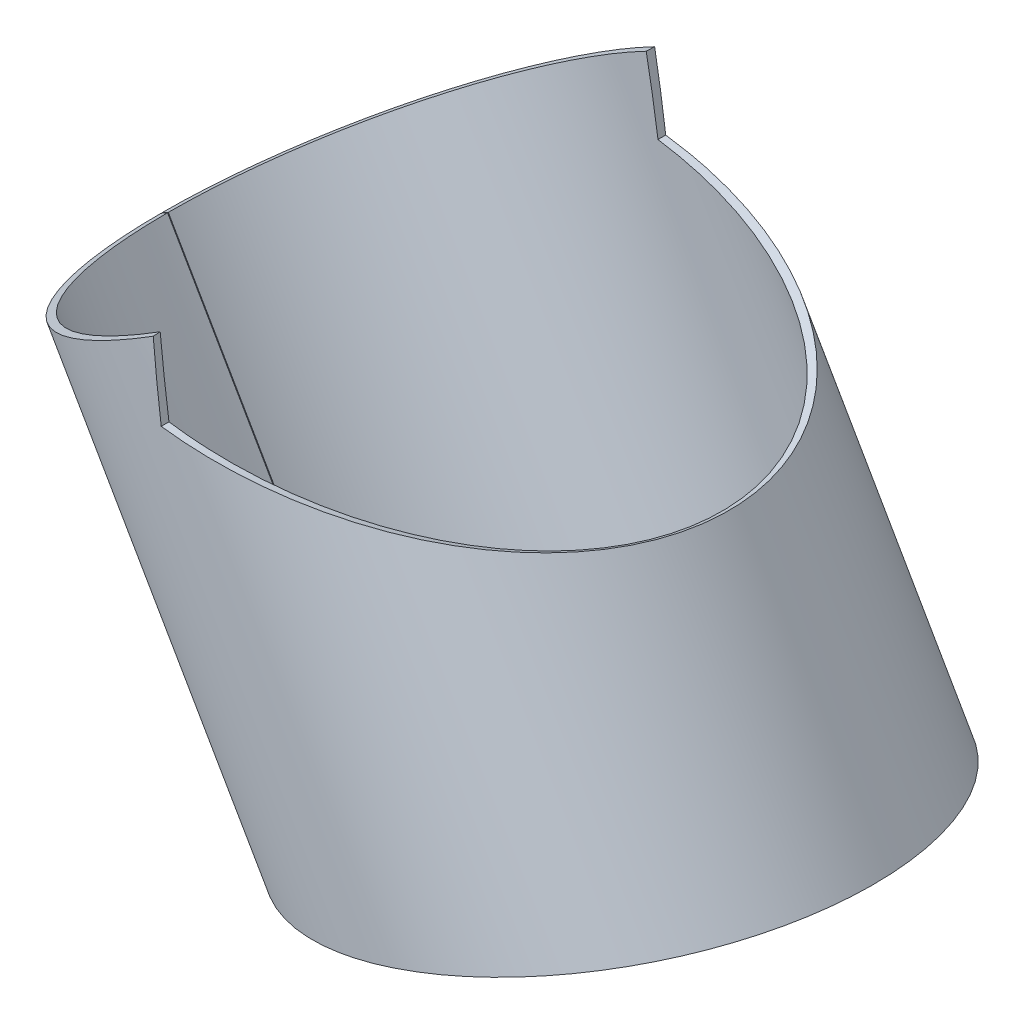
ISO-10303-21;
HEADER;
FILE_DESCRIPTION(('STEP AP214'),'2;1');
FILE_NAME('part.step','',(''),(''),'','','');
FILE_SCHEMA(('AUTOMOTIVE_DESIGN { 1 0 10303 214 1 1 1 1 }'));
ENDSEC;
DATA;
#1=APPLICATION_CONTEXT('core data for automotive mechanical design processes');
#2=APPLICATION_PROTOCOL_DEFINITION('international standard','automotive_design',2000,#1);
#3=PRODUCT_CONTEXT('',#1,'mechanical');
#4=PRODUCT('Part','Part','',(#3));
#5=PRODUCT_RELATED_PRODUCT_CATEGORY('part','',(#4));
#6=PRODUCT_DEFINITION_FORMATION('','',#4);
#7=PRODUCT_DEFINITION_CONTEXT('part definition',#1,'design');
#8=PRODUCT_DEFINITION('design','',#6,#7);
#9=PRODUCT_DEFINITION_SHAPE('','',#8);
#10=(LENGTH_UNIT() NAMED_UNIT(*) SI_UNIT(.MILLI.,.METRE.));
#11=(NAMED_UNIT(*) PLANE_ANGLE_UNIT() SI_UNIT($,.RADIAN.));
#12=(NAMED_UNIT(*) SI_UNIT($,.STERADIAN.) SOLID_ANGLE_UNIT());
#13=UNCERTAINTY_MEASURE_WITH_UNIT(LENGTH_MEASURE(1.E-05),#10,'distance_accuracy_value','');
#14=(GEOMETRIC_REPRESENTATION_CONTEXT(3) GLOBAL_UNCERTAINTY_ASSIGNED_CONTEXT((#13)) GLOBAL_UNIT_ASSIGNED_CONTEXT((#10,
#11,#12)) REPRESENTATION_CONTEXT('',''));
#15=CARTESIAN_POINT('',(0.,0.,0.));
#16=DIRECTION('',(0.,0.,1.));
#17=DIRECTION('',(1.,0.,0.));
#18=AXIS2_PLACEMENT_3D('',#15,#16,#17);
#19=CARTESIAN_POINT('',(-450.313993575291,417.916654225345,-0.484615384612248));
#20=DIRECTION('',(-0.00133234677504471,-0.000769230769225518,0.999998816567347));
#21=DIRECTION('',(-0.5,0.866025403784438,0.));
#22=AXIS2_PLACEMENT_3D('',#19,#20,#21);
#23=PLANE('',#22);
#24=CARTESIAN_POINT('',(-316.339371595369,185.865802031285,-0.484615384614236));
#25=CARTESIAN_POINT('',(-324.999615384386,180.865807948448,-0.49999999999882));
#26=B_SPLINE_CURVE_WITH_KNOTS('',1,(#24,#25),.UNSPECIFIED.,.F.,.F.,(2,2),(0.,1.),.UNSPECIFIED.);
#27=CARTESIAN_POINT('',(-316.339371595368,185.865802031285,-0.484615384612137));
#28=VERTEX_POINT('',#27);
#29=CARTESIAN_POINT('',(-324.999615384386,180.865807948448,-0.499999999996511));
#30=VERTEX_POINT('',#29);
#31=EDGE_CURVE('E13',#28,#30,#26,.T.);
#32=ORIENTED_EDGE('',*,*,#31,.F.);
#33=DIRECTION('',(-0.5,0.866025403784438,0.));
#34=VECTOR('',#33,1.);
#35=CARTESIAN_POINT('',(-316.339371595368,185.865802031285,-0.484615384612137));
#36=LINE('',#35,#34);
#37=CARTESIAN_POINT('',(-584.288615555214,649.967506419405,-0.48461538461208));
#38=VERTEX_POINT('',#37);
#39=EDGE_CURVE('E123',#28,#38,#36,.T.);
#40=ORIENTED_EDGE('',*,*,#39,.T.);
#41=DIRECTION('',(-0.866024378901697,-0.499999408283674,-0.00153846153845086));
#42=VECTOR('',#41,1.);
#43=CARTESIAN_POINT('',(-584.288615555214,649.967506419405,-0.48461538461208));
#44=LINE('',#43,#42);
#45=CARTESIAN_POINT('',(-592.948859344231,644.967512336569,-0.499999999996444));
#46=VERTEX_POINT('',#45);
#47=EDGE_CURVE('E57',#38,#46,#44,.T.);
#48=ORIENTED_EDGE('',*,*,#47,.T.);
#49=DIRECTION('',(0.5,-0.866025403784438,0.));
#50=VECTOR('',#49,1.);
#51=CARTESIAN_POINT('',(-1645.56139157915,2468.14589885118,-0.499999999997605));
#52=LINE('',#51,#50);
#53=EDGE_CURVE('E122',#30,#46,#52,.F.);
#54=ORIENTED_EDGE('',*,*,#53,.F.);
#55=EDGE_LOOP('',(#32,#40,#48,#54));
#56=FACE_BOUND('',#55,.T.);
#57=ADVANCED_FACE('F43',(#56),#23,.T.);
#58=CARTESIAN_POINT('',(-311.49093620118,807.467320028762,0.));
#59=DIRECTION('',(-0.5,0.866025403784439,0.));
#60=DIRECTION('',(-0.866025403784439,-0.5,0.));
#61=AXIS2_PLACEMENT_3D('',#58,#59,#60);
#62=PLANE('',#61);
#63=ORIENTED_EDGE('',*,*,#47,.F.);
#64=CARTESIAN_POINT('',(-311.49093620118,807.467320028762,0.));
#65=DIRECTION('',(0.5,-0.866025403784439,0.));
#66=DIRECTION('',(0.866025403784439,0.5,0.));
#67=AXIS2_PLACEMENT_3D('',#64,#65,#66);
#68=CIRCLE('',#67,314.999999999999);
#69=CARTESIAN_POINT('',(-281.213579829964,824.947959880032,-313.053843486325));
#70=VERTEX_POINT('',#69);
#71=EDGE_CURVE('E161',#38,#70,#68,.T.);
#72=ORIENTED_EDGE('',*,*,#71,.T.);
#73=CARTESIAN_POINT('',(-280.252393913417,825.502900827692,-322.992060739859));
#74=CARTESIAN_POINT('',(-281.213579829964,824.947959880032,-313.053843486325));
#75=B_SPLINE_CURVE_WITH_KNOTS('',1,(#73,#74),.UNSPECIFIED.,.F.,.F.,(2,2),(0.,1.),.UNSPECIFIED.);
#76=CARTESIAN_POINT('',(-280.252393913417,825.502900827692,-322.992060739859));
#77=VERTEX_POINT('',#76);
#78=EDGE_CURVE('E128',#70,#77,#75,.F.);
#79=ORIENTED_EDGE('',*,*,#78,.T.);
#80=CARTESIAN_POINT('',(-311.49093620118,807.467320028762,0.));
#81=DIRECTION('',(0.5,-0.866025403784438,0.));
#82=DIRECTION('',(0.866025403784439,0.5,0.));
#83=AXIS2_PLACEMENT_3D('',#80,#81,#82);
#84=CIRCLE('',#83,324.999999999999);
#85=EDGE_CURVE('E136',#46,#77,#84,.T.);
#86=ORIENTED_EDGE('',*,*,#85,.F.);
#87=EDGE_LOOP('',(#63,#72,#79,#86));
#88=FACE_BOUND('',#87,.T.);
#89=ADVANCED_FACE('F141',(#88),#62,.T.);
#90=CARTESIAN_POINT('',(-267.949192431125,732.050807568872,-324.999999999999));
#91=CARTESIAN_POINT('',(-269.317248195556,742.442233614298,-324.999999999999));
#92=CARTESIAN_POINT('',(-270.513571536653,751.532825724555,-324.926907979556));
#93=CARTESIAN_POINT('',(-272.051845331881,763.216831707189,-324.78075843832));
#94=CARTESIAN_POINT('',(-272.521858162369,766.786202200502,-324.72573930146));
#95=CARTESIAN_POINT('',(-273.162663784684,771.652366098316,-324.640936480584));
#96=CARTESIAN_POINT('',(-273.365562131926,773.193106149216,-324.612276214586));
#97=CARTESIAN_POINT('',(-273.653833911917,775.382256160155,-324.569471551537));
#98=CARTESIAN_POINT('',(-273.747245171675,776.091646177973,-324.555233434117));
#99=CARTESIAN_POINT('',(-273.883340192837,777.125242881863,-324.534010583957));
#100=CARTESIAN_POINT('',(-273.928034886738,777.464693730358,-324.526958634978));
#101=CARTESIAN_POINT('',(-273.994071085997,777.966248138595,-324.51642488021));
#102=CARTESIAN_POINT('',(-274.015915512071,778.132162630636,-324.512920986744));
#103=CARTESIAN_POINT('',(-274.048430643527,778.379128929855,-324.507677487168));
#104=CARTESIAN_POINT('',(-274.059227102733,778.461133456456,-324.505931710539));
#105=CARTESIAN_POINT('',(-274.075358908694,778.583663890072,-324.503316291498));
#106=CARTESIAN_POINT('',(-274.080725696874,778.62442797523,-324.502445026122));
#107=CARTESIAN_POINT('',(-274.088760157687,778.685455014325,-324.501138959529));
#108=CARTESIAN_POINT('',(-274.091435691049,778.705777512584,-324.500703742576));
#109=CARTESIAN_POINT('',(-274.095445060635,778.736231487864,-324.500051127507));
#110=CARTESIAN_POINT('',(-274.096780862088,778.74637785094,-324.499833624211));
#111=CARTESIAN_POINT('',(-274.099451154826,778.766660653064,-324.499398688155));
#112=CARTESIAN_POINT('',(-274.099909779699,778.77014423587,-324.49932400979));
#113=CARTESIAN_POINT('',(-276.364854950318,795.974085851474,-324.13016853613));
#114=CARTESIAN_POINT('',(-278.414732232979,811.54635256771,-323.593650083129));
#115=CARTESIAN_POINT('',(-280.252393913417,825.502900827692,-322.992060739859));
#116=CARTESIAN_POINT('',(-267.949192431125,732.050807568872,-314.999999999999));
#117=CARTESIAN_POINT('',(-269.424127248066,742.380524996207,-314.999999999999));
#118=CARTESIAN_POINT('',(-270.713961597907,751.417130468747,-314.929156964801));
#119=CARTESIAN_POINT('',(-272.372408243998,763.031754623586,-314.787504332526));
#120=CARTESIAN_POINT('',(-272.879131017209,766.579930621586,-314.734178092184));
#121=CARTESIAN_POINT('',(-273.569982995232,771.41720024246,-314.651984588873));
#122=CARTESIAN_POINT('',(-273.788727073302,772.948791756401,-314.624206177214));
#123=CARTESIAN_POINT('',(-274.099513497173,775.124942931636,-314.58271858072));
#124=CARTESIAN_POINT('',(-274.2002206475,775.830120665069,-314.568918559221));
#125=CARTESIAN_POINT('',(-274.346946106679,776.857579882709,-314.548348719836));
#126=CARTESIAN_POINT('',(-274.395132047,777.195015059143,-314.541513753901));
#127=CARTESIAN_POINT('',(-274.466326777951,777.693591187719,-314.531304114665));
#128=CARTESIAN_POINT('',(-274.489877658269,777.858520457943,-314.527908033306));
#129=CARTESIAN_POINT('',(-274.524932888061,778.104020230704,-314.522825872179));
#130=CARTESIAN_POINT('',(-274.536572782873,778.18553779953,-314.521133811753));
#131=CARTESIAN_POINT('',(-274.55396484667,778.307340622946,-314.518598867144));
#132=CARTESIAN_POINT('',(-274.559750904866,778.347862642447,-314.517754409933));
#133=CARTESIAN_POINT('',(-274.568413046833,778.40852728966,-314.516488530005));
#134=CARTESIAN_POINT('',(-274.571297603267,778.428729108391,-314.516066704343));
#135=CARTESIAN_POINT('',(-274.575620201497,778.459002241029,-314.515434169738));
#136=CARTESIAN_POINT('',(-274.577060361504,778.469088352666,-314.515223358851));
#137=CARTESIAN_POINT('',(-274.579939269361,778.489250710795,-314.514801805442));
#138=CARTESIAN_POINT('',(-274.580433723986,778.492713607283,-314.514729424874));
#139=CARTESIAN_POINT('',(-277.022327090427,795.594494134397,-314.156932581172));
#140=CARTESIAN_POINT('',(-279.232375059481,811.074278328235,-313.636922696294));
#141=CARTESIAN_POINT('',(-281.213579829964,824.947959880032,-313.053843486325));
#142=B_SPLINE_SURFACE_WITH_KNOTS('',1,3,((#90,#91,#92,#93,#94,#95,#96,#97,#98,#99,#100,#101,
#102,#103,#104,#105,#106,#107,#108,#109,#110,#111,#112,#113,#114,#115),(#116,#117,#118,#119,
#120,#121,#122,#123,#124,#125,#126,#127,#128,#129,#130,#131,#132,#133,#134,#135,#136,#137,#138,
#139,#140,#141)),.UNSPECIFIED.,.F.,.F.,.F.,(2,2),(4,2,2,2,2,2,2,2,2,2,2,2,4),(0.,1.),(0.,0.25,
0.375,0.4375,0.46875,0.484375,0.4921875,0.49609375,0.498046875,0.4990234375,0.49951171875,0.5,
1.),.UNSPECIFIED.);
#143=CARTESIAN_POINT('',(-281.213579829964,824.947959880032,-313.053843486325));
#144=CARTESIAN_POINT('',(-279.232375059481,811.074278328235,-313.636922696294));
#145=CARTESIAN_POINT('',(-277.022327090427,795.594494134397,-314.156932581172));
#146=CARTESIAN_POINT('',(-274.580433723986,778.492713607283,-314.514729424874));
#147=CARTESIAN_POINT('',(-274.579939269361,778.489250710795,-314.514801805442));
#148=CARTESIAN_POINT('',(-274.577060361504,778.469088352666,-314.515223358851));
#149=CARTESIAN_POINT('',(-274.575620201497,778.459002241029,-314.515434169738));
#150=CARTESIAN_POINT('',(-274.571297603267,778.428729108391,-314.516066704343));
#151=CARTESIAN_POINT('',(-274.568413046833,778.40852728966,-314.516488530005));
#152=CARTESIAN_POINT('',(-274.559750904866,778.347862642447,-314.517754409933));
#153=CARTESIAN_POINT('',(-274.55396484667,778.307340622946,-314.518598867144));
#154=CARTESIAN_POINT('',(-274.536572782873,778.18553779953,-314.521133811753));
#155=CARTESIAN_POINT('',(-274.524932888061,778.104020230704,-314.522825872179));
#156=CARTESIAN_POINT('',(-274.489877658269,777.858520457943,-314.527908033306));
#157=CARTESIAN_POINT('',(-274.466326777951,777.693591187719,-314.531304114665));
#158=CARTESIAN_POINT('',(-274.395132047,777.195015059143,-314.541513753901));
#159=CARTESIAN_POINT('',(-274.346946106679,776.857579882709,-314.548348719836));
#160=CARTESIAN_POINT('',(-274.2002206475,775.830120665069,-314.568918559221));
#161=CARTESIAN_POINT('',(-274.099513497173,775.124942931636,-314.58271858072));
#162=CARTESIAN_POINT('',(-273.788727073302,772.948791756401,-314.624206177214));
#163=CARTESIAN_POINT('',(-273.569982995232,771.41720024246,-314.651984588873));
#164=CARTESIAN_POINT('',(-272.879131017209,766.579930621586,-314.734178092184));
#165=CARTESIAN_POINT('',(-272.372408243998,763.031754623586,-314.787504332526));
#166=CARTESIAN_POINT('',(-270.713961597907,751.417130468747,-314.929156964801));
#167=CARTESIAN_POINT('',(-269.424127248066,742.380524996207,-314.999999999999));
#168=CARTESIAN_POINT('',(-267.949192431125,732.050807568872,-314.999999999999));
#169=B_SPLINE_CURVE_WITH_KNOTS('',3,(#143,#144,#145,#146,#147,#148,#149,#150,#151,#152,#153,
#154,#155,#156,#157,#158,#159,#160,#161,#162,#163,#164,#165,#166,#167,#168),.UNSPECIFIED.,.F.,
.F.,(4,2,2,2,2,2,2,2,2,2,2,2,4),(0.,0.5,0.50048828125,0.5009765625,0.501953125,0.50390625,
0.5078125,0.515625,0.53125,0.5625,0.625,0.75,1.),.UNSPECIFIED.);
#170=CARTESIAN_POINT('',(-267.949192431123,732.050807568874,-314.999999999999));
#171=VERTEX_POINT('',#170);
#172=EDGE_CURVE('E160',#171,#70,#169,.F.);
#173=CARTESIAN_POINT('',(-267.949192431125,732.050807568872,-314.999999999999));
#174=CARTESIAN_POINT('',(-267.949192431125,732.050807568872,-324.999999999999));
#175=B_SPLINE_CURVE_WITH_KNOTS('',1,(#173,#174),.UNSPECIFIED.,.F.,.F.,(2,2),(0.,1.),.UNSPECIFIED.);
#176=CARTESIAN_POINT('',(-267.94919248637,732.050807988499,-324.999999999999));
#177=VERTEX_POINT('',#176);
#178=EDGE_CURVE('E288',#171,#177,#175,.T.);
#179=CARTESIAN_POINT('',(-267.949192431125,732.050807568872,-324.999999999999));
#180=CARTESIAN_POINT('',(-269.317248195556,742.442233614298,-324.999999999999));
#181=CARTESIAN_POINT('',(-270.513571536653,751.532825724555,-324.926907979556));
#182=CARTESIAN_POINT('',(-272.051845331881,763.216831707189,-324.78075843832));
#183=CARTESIAN_POINT('',(-272.521858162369,766.786202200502,-324.72573930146));
#184=CARTESIAN_POINT('',(-273.162663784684,771.652366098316,-324.640936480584));
#185=CARTESIAN_POINT('',(-273.365562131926,773.193106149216,-324.612276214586));
#186=CARTESIAN_POINT('',(-273.653833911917,775.382256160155,-324.569471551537));
#187=CARTESIAN_POINT('',(-273.747245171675,776.091646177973,-324.555233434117));
#188=CARTESIAN_POINT('',(-273.883340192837,777.125242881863,-324.534010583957));
#189=CARTESIAN_POINT('',(-273.928034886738,777.464693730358,-324.526958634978));
#190=CARTESIAN_POINT('',(-273.994071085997,777.966248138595,-324.51642488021));
#191=CARTESIAN_POINT('',(-274.015915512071,778.132162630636,-324.512920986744));
#192=CARTESIAN_POINT('',(-274.048430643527,778.379128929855,-324.507677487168));
#193=CARTESIAN_POINT('',(-274.059227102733,778.461133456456,-324.505931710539));
#194=CARTESIAN_POINT('',(-274.075358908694,778.583663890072,-324.503316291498));
#195=CARTESIAN_POINT('',(-274.080725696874,778.62442797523,-324.502445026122));
#196=CARTESIAN_POINT('',(-274.088760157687,778.685455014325,-324.501138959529));
#197=CARTESIAN_POINT('',(-274.091435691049,778.705777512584,-324.500703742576));
#198=CARTESIAN_POINT('',(-274.095445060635,778.736231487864,-324.500051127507));
#199=CARTESIAN_POINT('',(-274.096780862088,778.74637785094,-324.499833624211));
#200=CARTESIAN_POINT('',(-274.099451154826,778.766660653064,-324.499398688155));
#201=CARTESIAN_POINT('',(-274.099909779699,778.77014423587,-324.49932400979));
#202=CARTESIAN_POINT('',(-276.364854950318,795.974085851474,-324.13016853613));
#203=CARTESIAN_POINT('',(-278.414732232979,811.54635256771,-323.593650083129));
#204=CARTESIAN_POINT('',(-280.252393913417,825.502900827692,-322.992060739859));
#205=B_SPLINE_CURVE_WITH_KNOTS('',3,(#179,#180,#181,#182,#183,#184,#185,#186,#187,#188,#189,
#190,#191,#192,#193,#194,#195,#196,#197,#198,#199,#200,#201,#202,#203,#204),.UNSPECIFIED.,.F.,
.F.,(4,2,2,2,2,2,2,2,2,2,2,2,4),(0.,0.25,0.375,0.4375,0.46875,0.484375,0.4921875,0.49609375,
0.498046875,0.4990234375,0.49951171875,0.5,1.),.UNSPECIFIED.);
#206=EDGE_CURVE('E143',#177,#77,#205,.T.);
#207=ORIENTED_EDGE('',*,*,#78,.F.);
#208=ORIENTED_EDGE('',*,*,#172,.F.);
#209=ORIENTED_EDGE('',*,*,#178,.T.);
#210=ORIENTED_EDGE('',*,*,#206,.T.);
#211=EDGE_LOOP('',(#207,#208,#209,#210));
#212=FACE_BOUND('',#211,.T.);
#213=ADVANCED_FACE('F293',(#212),#142,.F.);
#214=CARTESIAN_POINT('',(-267.949192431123,732.050807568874,324.999999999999));
#215=CARTESIAN_POINT('',(-260.325095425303,731.047088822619,324.999999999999));
#216=CARTESIAN_POINT('',(-254.546731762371,730.286391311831,324.838277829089));
#217=CARTESIAN_POINT('',(-250.1215596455,729.703752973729,324.686997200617));
#218=CARTESIAN_POINT('',(-249.659655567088,729.642944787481,324.670523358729));
#219=CARTESIAN_POINT('',(-248.725710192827,729.51999167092,324.635973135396));
#220=CARTESIAN_POINT('',(-248.262119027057,729.458961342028,324.618176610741));
#221=CARTESIAN_POINT('',(-246.881492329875,729.277207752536,324.563305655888));
#222=CARTESIAN_POINT('',(-245.974603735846,729.157821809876,324.524750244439));
#223=CARTESIAN_POINT('',(-243.294538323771,728.805005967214,324.403808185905));
#224=CARTESIAN_POINT('',(-241.561963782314,728.57691695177,324.316152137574));
#225=CARTESIAN_POINT('',(-238.205104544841,728.134971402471,324.130088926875));
#226=CARTESIAN_POINT('',(-236.580819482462,727.921115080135,324.03168179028));
#227=CARTESIAN_POINT('',(-233.44050020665,727.507657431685,323.827215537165));
#228=CARTESIAN_POINT('',(-231.93592749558,727.309567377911,323.722060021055));
#229=CARTESIAN_POINT('',(-227.461418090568,726.720546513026,323.390006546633));
#230=CARTESIAN_POINT('',(-224.549961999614,726.337362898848,323.147318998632));
#231=CARTESIAN_POINT('',(-216.030703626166,725.216037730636,322.366113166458));
#232=CARTESIAN_POINT('',(-210.638104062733,724.506068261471,321.774627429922));
#233=CARTESIAN_POINT('',(-202.979482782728,723.497531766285,320.821508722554));
#234=CARTESIAN_POINT('',(-200.498297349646,723.170770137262,320.492777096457));
#235=CARTESIAN_POINT('',(-195.679032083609,722.536237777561,319.819422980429));
#236=CARTESIAN_POINT('',(-193.326143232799,722.226521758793,319.472895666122));
#237=CARTESIAN_POINT('',(-181.667900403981,720.691912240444,317.672675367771));
#238=CARTESIAN_POINT('',(-172.850324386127,719.530959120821,316.040103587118));
#239=CARTESIAN_POINT('',(-160.386964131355,717.889933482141,313.414371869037));
#240=CARTESIAN_POINT('',(-156.34856764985,717.35834997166,312.50764120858));
#241=CARTESIAN_POINT('',(-148.399507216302,716.311952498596,310.619502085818));
#242=CARTESIAN_POINT('',(-144.503634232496,715.799081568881,309.641138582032));
#243=CARTESIAN_POINT('',(-136.869288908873,714.793945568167,307.625443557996));
#244=CARTESIAN_POINT('',(-133.130815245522,714.301681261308,306.58811246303));
#245=CARTESIAN_POINT('',(-125.810966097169,713.337933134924,304.463746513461));
#246=CARTESIAN_POINT('',(-122.224072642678,712.865765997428,303.37529323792));
#247=CARTESIAN_POINT('',(-111.614648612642,711.469164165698,300.020515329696));
#248=CARTESIAN_POINT('',(-104.769439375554,710.567959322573,297.672278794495));
#249=CARTESIAN_POINT('',(-91.5344447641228,708.825308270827,292.798367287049));
#250=CARTESIAN_POINT('',(-85.1363415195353,707.983055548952,290.270442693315));
#251=CARTESIAN_POINT('',(-72.6760814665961,706.34275080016,285.026907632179));
#252=CARTESIAN_POINT('',(-66.6283686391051,705.546485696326,282.316495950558));
#253=CARTESIAN_POINT('',(-49.0318476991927,703.229718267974,273.965289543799));
#254=CARTESIAN_POINT('',(-37.9436671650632,701.769991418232,268.064394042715));
#255=CARTESIAN_POINT('',(-17.0112332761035,699.014217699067,255.758130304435));
#256=CARTESIAN_POINT('',(-7.11596636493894,697.711461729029,249.322162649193));
#257=CARTESIAN_POINT('',(11.5430938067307,695.254955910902,236.020905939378));
#258=CARTESIAN_POINT('',(20.3468031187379,694.095974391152,229.126949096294));
#259=CARTESIAN_POINT('',(36.9021816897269,691.916324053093,214.968352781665));
#260=CARTESIAN_POINT('',(44.6775462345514,690.892824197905,207.683789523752));
#261=CARTESIAN_POINT('',(66.5218819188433,688.016734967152,185.336853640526));
#262=CARTESIAN_POINT('',(79.140510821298,686.355503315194,169.760902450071));
#263=CARTESIAN_POINT('',(100.728794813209,683.513857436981,137.565570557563));
#264=CARTESIAN_POINT('',(109.684481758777,682.334271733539,120.955743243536));
#265=CARTESIAN_POINT('',(123.97982463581,680.452368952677,87.0976878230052));
#266=CARTESIAN_POINT('',(129.318747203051,679.749690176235,69.8521867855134));
#267=CARTESIAN_POINT('',(134.651649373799,679.047473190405,43.7609833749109));
#268=CARTESIAN_POINT('',(135.982343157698,678.872237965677,35.0321772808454));
#269=CARTESIAN_POINT('',(137.756877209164,678.638727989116,17.5286150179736));
#270=CARTESIAN_POINT('',(138.200081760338,678.580239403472,8.75511825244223));
#271=CARTESIAN_POINT('',(138.199316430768,678.580343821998,-8.77775462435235));
#272=CARTESIAN_POINT('',(137.755344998,678.638936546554,-17.5512912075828));
#273=CARTESIAN_POINT('',(135.979260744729,678.872646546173,-35.0549377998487));
#274=CARTESIAN_POINT('',(134.647786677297,679.047977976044,-43.7838130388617));
#275=CARTESIAN_POINT('',(129.312333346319,679.750539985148,-69.8756954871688));
#276=CARTESIAN_POINT('',(123.971444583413,680.453474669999,-87.1221796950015));
#277=CARTESIAN_POINT('',(109.671198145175,682.336019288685,-120.982551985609));
#278=CARTESIAN_POINT('',(100.712270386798,683.516013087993,-137.594580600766));
#279=CARTESIAN_POINT('',(79.1137854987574,686.359024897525,-169.796398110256));
#280=CARTESIAN_POINT('',(66.4882774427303,688.021158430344,-185.376429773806));
#281=CARTESIAN_POINT('',(44.6307240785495,690.898985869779,-207.729080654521));
#282=CARTESIAN_POINT('',(36.8505819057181,691.923118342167,-215.015395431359));
#283=CARTESIAN_POINT('',(20.2840966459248,694.104226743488,-229.177645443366));
#284=CARTESIAN_POINT('',(11.4742414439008,695.26402183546,-236.073313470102));
#285=CARTESIAN_POINT('',(-7.19833153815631,697.722303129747,-249.377525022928));
#286=CARTESIAN_POINT('',(-17.1015448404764,699.026108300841,-255.81510058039));
#287=CARTESIAN_POINT('',(-38.0509523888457,701.784114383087,-268.123555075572));
#288=CARTESIAN_POINT('',(-49.1464231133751,703.244740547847,-274.024035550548));
#289=CARTESIAN_POINT('',(-66.7516308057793,705.562747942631,-282.372776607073));
#290=CARTESIAN_POINT('',(-72.8010634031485,706.359222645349,-285.081695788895));
#291=CARTESIAN_POINT('',(-85.2622600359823,707.99962651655,-290.321190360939));
#292=CARTESIAN_POINT('',(-91.6593139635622,708.841756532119,-292.846477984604));
#293=CARTESIAN_POINT('',(-104.891712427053,710.584078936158,-297.715134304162));
#294=CARTESIAN_POINT('',(-111.73473389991,711.484982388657,-300.060493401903));
#295=CARTESIAN_POINT('',(-122.33948407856,712.880959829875,-303.41075765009));
#296=CARTESIAN_POINT('',(-125.924409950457,713.352868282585,-304.497626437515));
#297=CARTESIAN_POINT('',(-133.241228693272,714.316219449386,-306.61917071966));
#298=CARTESIAN_POINT('',(-136.978078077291,714.808269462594,-307.655093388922));
#299=CARTESIAN_POINT('',(-144.608953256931,715.812947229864,-309.667993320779));
#300=CARTESIAN_POINT('',(-148.502980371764,716.325574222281,-310.644970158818));
#301=CARTESIAN_POINT('',(-156.448124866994,717.371455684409,-312.530375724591));
#302=CARTESIAN_POINT('',(-160.484249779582,717.902741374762,-313.435724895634));
#303=CARTESIAN_POINT('',(-172.943288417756,719.543201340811,-316.057944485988));
#304=CARTESIAN_POINT('',(-181.757351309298,720.70368654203,-317.688135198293));
#305=CARTESIAN_POINT('',(-193.410388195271,722.237611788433,-319.485483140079));
#306=CARTESIAN_POINT('',(-195.761808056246,722.54713493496,-319.831391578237));
#307=CARTESIAN_POINT('',(-200.580627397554,723.181611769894,-320.503863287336));
#308=CARTESIAN_POINT('',(-203.061495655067,723.508331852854,-320.832133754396));
#309=CARTESIAN_POINT('',(-210.718879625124,724.516704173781,-321.783822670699));
#310=CARTESIAN_POINT('',(-216.110273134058,725.226511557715,-322.374292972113));
#311=CARTESIAN_POINT('',(-224.627139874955,726.347520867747,-323.153945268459));
#312=CARTESIAN_POINT('',(-227.537701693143,726.730587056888,-323.396110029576));
#313=CARTESIAN_POINT('',(-232.010723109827,727.319414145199,-323.727380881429));
#314=CARTESIAN_POINT('',(-233.515738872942,727.51756330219,-323.832345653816));
#315=CARTESIAN_POINT('',(-236.65726802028,727.9311804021,-324.036416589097));
#316=CARTESIAN_POINT('',(-238.282093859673,728.145107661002,-324.134608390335));
#317=CARTESIAN_POINT('',(-241.639905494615,728.587177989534,-324.320208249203));
#318=CARTESIAN_POINT('',(-243.372891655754,728.815320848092,-324.407616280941));
#319=CARTESIAN_POINT('',(-246.05347698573,729.168205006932,-324.528164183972));
#320=CARTESIAN_POINT('',(-246.960522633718,729.287611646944,-324.566584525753));
#321=CARTESIAN_POINT('',(-248.341360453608,729.469393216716,-324.621247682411));
#322=CARTESIAN_POINT('',(-248.805017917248,729.530432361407,-324.638974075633));
#323=CARTESIAN_POINT('',(-249.739087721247,729.653402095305,-324.673382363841));
#324=CARTESIAN_POINT('',(-250.201684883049,729.714301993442,-324.689810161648));
#325=CARTESIAN_POINT('',(-254.647814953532,730.299704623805,-324.841082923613));
#326=CARTESIAN_POINT('',(-260.398726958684,731.056771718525,-324.999999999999));
#327=CARTESIAN_POINT('',(-267.949192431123,732.050807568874,-324.999999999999));
#328=CARTESIAN_POINT('',(-267.949192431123,732.050807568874,314.999999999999));
#329=CARTESIAN_POINT('',(-260.487670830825,730.953231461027,314.999999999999));
#330=CARTESIAN_POINT('',(-254.832511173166,730.12139649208,314.843253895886));
#331=CARTESIAN_POINT('',(-250.50169564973,729.484281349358,314.696628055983));
#332=CARTESIAN_POINT('',(-250.049640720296,729.417786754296,314.680661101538));
#333=CARTESIAN_POINT('',(-249.135609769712,729.283336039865,314.647173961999));
#334=CARTESIAN_POINT('',(-248.681903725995,729.216598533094,314.629925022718));
#335=CARTESIAN_POINT('',(-247.330716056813,729.017848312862,314.576742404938));
#336=CARTESIAN_POINT('',(-246.443165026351,728.887297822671,314.53937331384));
#337=CARTESIAN_POINT('',(-243.82024654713,728.501488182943,314.422152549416));
#338=CARTESIAN_POINT('',(-242.12461555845,728.252069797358,314.337193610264));
#339=CARTESIAN_POINT('',(-238.839334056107,727.768798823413,314.156855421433));
#340=CARTESIAN_POINT('',(-237.249683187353,727.534946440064,314.061476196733));
#341=CARTESIAN_POINT('',(-234.176324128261,727.082829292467,313.863301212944));
#342=CARTESIAN_POINT('',(-232.703833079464,726.866216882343,313.761381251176));
#343=CARTESIAN_POINT('',(-228.324733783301,726.222110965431,313.439544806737));
#344=CARTESIAN_POINT('',(-225.475359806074,725.803084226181,313.204324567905));
#345=CARTESIAN_POINT('',(-217.137759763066,724.576878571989,312.44715583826));
#346=CARTESIAN_POINT('',(-211.860145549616,723.800522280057,311.873869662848));
#347=CARTESIAN_POINT('',(-204.364824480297,722.697704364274,310.950077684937));
#348=CARTESIAN_POINT('',(-201.936543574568,722.340398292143,310.631460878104));
#349=CARTESIAN_POINT('',(-197.220037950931,721.64653762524,309.978825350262));
#350=CARTESIAN_POINT('',(-194.917320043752,721.307855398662,309.642960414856));
#351=CARTESIAN_POINT('',(-183.507667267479,719.629722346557,307.898131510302));
#352=CARTESIAN_POINT('',(-174.878105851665,718.360218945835,306.315792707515));
#353=CARTESIAN_POINT('',(-162.680497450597,716.565761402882,303.770852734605));
#354=CARTESIAN_POINT('',(-158.728212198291,715.984461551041,302.892021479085));
#355=CARTESIAN_POINT('',(-150.948649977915,714.840204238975,301.061978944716));
#356=CARTESIAN_POINT('',(-147.135848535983,714.279371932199,300.113718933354));
#357=CARTESIAN_POINT('',(-139.664288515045,713.180251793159,298.160045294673));
#358=CARTESIAN_POINT('',(-136.005528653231,712.641964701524,297.154632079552));
#359=CARTESIAN_POINT('',(-128.841758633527,711.5881042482,295.095631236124));
#360=CARTESIAN_POINT('',(-125.331348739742,711.071779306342,294.040668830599));
#361=CARTESIAN_POINT('',(-114.948149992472,709.544566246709,290.789114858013));
#362=CARTESIAN_POINT('',(-108.248899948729,708.559091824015,288.513131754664));
#363=CARTESIAN_POINT('',(-95.2961101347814,706.653509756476,283.78918675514));
#364=CARTESIAN_POINT('',(-89.0344336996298,705.732490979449,281.339044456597));
#365=CARTESIAN_POINT('',(-76.8398635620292,703.938790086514,276.256848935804));
#366=CARTESIAN_POINT('',(-70.9211043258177,703.068073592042,273.629834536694));
#367=CARTESIAN_POINT('',(-53.69978956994,700.534680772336,265.535588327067));
#368=CARTESIAN_POINT('',(-42.8480415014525,698.93844957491,259.816258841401));
#369=CARTESIAN_POINT('',(-22.3619473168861,695.924981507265,247.888649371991));
#370=CARTESIAN_POINT('',(-12.6776754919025,694.500407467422,241.650711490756));
#371=CARTESIAN_POINT('',(5.58352015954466,691.814194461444,228.758724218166));
#372=CARTESIAN_POINT('',(14.199508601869,690.54683224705,222.076889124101));
#373=CARTESIAN_POINT('',(30.4018804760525,688.163373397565,208.353941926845));
#374=CARTESIAN_POINT('',(38.0114500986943,687.044151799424,201.293519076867));
#375=CARTESIAN_POINT('',(59.3900052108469,683.899144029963,179.634181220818));
#376=CARTESIAN_POINT('',(71.7395683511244,682.082567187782,164.537490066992));
#377=CARTESIAN_POINT('',(92.8675217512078,678.975149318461,133.332783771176));
#378=CARTESIAN_POINT('',(101.632255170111,677.685316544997,117.234028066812));
#379=CARTESIAN_POINT('',(115.622778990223,675.627426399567,84.4177589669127));
#380=CARTESIAN_POINT('',(120.847857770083,674.859019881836,67.7028887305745));
#381=CARTESIAN_POINT('',(126.067048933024,674.091151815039,42.4144915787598));
#382=CARTESIAN_POINT('',(127.369369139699,673.899535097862,33.9542641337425));
#383=CARTESIAN_POINT('',(129.106063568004,673.644178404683,16.9892730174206));
#384=CARTESIAN_POINT('',(129.539819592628,673.580234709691,8.48572999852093));
#385=CARTESIAN_POINT('',(129.539070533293,673.580348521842,-8.50766986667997));
#386=CARTESIAN_POINT('',(129.104563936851,673.644405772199,-17.0112514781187));
#387=CARTESIAN_POINT('',(127.366352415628,673.899981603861,-33.9763243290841));
#388=CARTESIAN_POINT('',(126.063268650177,674.091704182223,-42.4366187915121));
#389=CARTESIAN_POINT('',(120.841580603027,674.85994860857,-67.7256740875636));
#390=CARTESIAN_POINT('',(115.614577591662,675.628635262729,-84.4414972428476));
#391=CARTESIAN_POINT('',(101.619254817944,677.687227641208,-117.260011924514));
#392=CARTESIAN_POINT('',(92.8513499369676,678.977508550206,-133.360901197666));
#393=CARTESIAN_POINT('',(71.7134128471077,682.086417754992,-164.571893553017));
#394=CARTESIAN_POINT('',(59.3571172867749,683.903981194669,-179.67253962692));
#395=CARTESIAN_POINT('',(37.9656263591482,687.050889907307,-201.337416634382));
#396=CARTESIAN_POINT('',(30.3513809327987,688.170802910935,-208.399537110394));
#397=CARTESIAN_POINT('',(14.1381392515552,690.555856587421,-222.12602558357));
#398=CARTESIAN_POINT('',(5.51613590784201,691.824108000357,-228.809519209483));
#399=CARTESIAN_POINT('',(-12.7582843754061,694.512262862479,-241.704370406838));
#400=CARTESIAN_POINT('',(-22.4503331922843,695.937983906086,-247.943866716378));
#401=CARTESIAN_POINT('',(-42.9530390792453,698.953893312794,-259.873599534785));
#402=CARTESIAN_POINT('',(-53.8119210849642,700.551114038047,-265.592526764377));
#403=CARTESIAN_POINT('',(-71.0417386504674,703.085853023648,-273.684383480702));
#404=CARTESIAN_POINT('',(-76.9621807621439,703.956800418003,-276.309951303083));
#405=CARTESIAN_POINT('',(-89.1576671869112,705.750612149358,-281.388230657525));
#406=CARTESIAN_POINT('',(-95.4183168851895,706.671495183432,-283.83581712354));
#407=CARTESIAN_POINT('',(-108.368566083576,708.576716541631,-288.554668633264));
#408=CARTESIAN_POINT('',(-115.065674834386,709.561862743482,-290.827862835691));
#409=CARTESIAN_POINT('',(-125.444299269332,711.088393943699,-294.075042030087));
#410=CARTESIAN_POINT('',(-128.952783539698,711.60443597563,-295.128468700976));
#411=CARTESIAN_POINT('',(-136.11358779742,712.657862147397,-297.184734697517));
#412=CARTESIAN_POINT('',(-139.770758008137,713.195914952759,-298.188782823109));
#413=CARTESIAN_POINT('',(-147.238921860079,714.294534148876,-300.139747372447));
#414=CARTESIAN_POINT('',(-151.049916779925,714.85509980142,-301.086663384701));
#415=CARTESIAN_POINT('',(-158.825646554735,715.998792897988,-302.914056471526));
#416=CARTESIAN_POINT('',(-162.775708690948,716.579766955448,-303.791548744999));
#417=CARTESIAN_POINT('',(-174.96908766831,718.373605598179,-306.33308465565));
#418=CARTESIAN_POINT('',(-183.595210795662,719.642597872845,-307.91311565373));
#419=CARTESIAN_POINT('',(-194.999768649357,721.319982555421,-309.655160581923));
#420=CARTESIAN_POINT('',(-197.30104889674,721.658453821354,-309.990425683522));
#421=CARTESIAN_POINT('',(-202.017118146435,722.352253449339,-310.642205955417));
#422=CARTESIAN_POINT('',(-204.445088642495,722.709514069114,-310.960375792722));
#423=CARTESIAN_POINT('',(-211.939198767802,723.812152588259,-311.882781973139));
#424=CARTESIAN_POINT('',(-217.215632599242,724.588331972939,-312.455083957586));
#425=CARTESIAN_POINT('',(-225.550891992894,725.814192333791,-313.210746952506));
#426=CARTESIAN_POINT('',(-228.39939076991,726.233090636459,-313.445460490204));
#427=CARTESIAN_POINT('',(-232.777033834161,726.876984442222,-313.76653839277));
#428=CARTESIAN_POINT('',(-234.249958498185,727.093661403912,-313.868273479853));
#429=CARTESIAN_POINT('',(-237.324501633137,727.545952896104,-314.066065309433));
#430=CARTESIAN_POINT('',(-238.914681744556,727.779882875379,-314.161235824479));
#431=CARTESIAN_POINT('',(-242.200895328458,728.263290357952,-314.341124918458));
#432=CARTESIAN_POINT('',(-243.89692915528,728.512767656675,-314.425843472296));
#433=CARTESIAN_POINT('',(-246.520356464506,728.898652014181,-314.54268220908));
#434=CARTESIAN_POINT('',(-247.408061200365,729.029225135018,-314.579920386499));
#435=CARTESIAN_POINT('',(-248.759455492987,729.228005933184,-314.632901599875));
#436=CARTESIAN_POINT('',(-249.21322642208,729.294753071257,-314.650082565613));
#437=CARTESIAN_POINT('',(-250.127379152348,729.429221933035,-314.683432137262));
#438=CARTESIAN_POINT('',(-250.58011239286,729.495816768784,-314.699354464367));
#439=CARTESIAN_POINT('',(-254.931439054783,730.135954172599,-314.84597267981));
#440=CARTESIAN_POINT('',(-260.559731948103,730.963820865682,-314.999999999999));
#441=CARTESIAN_POINT('',(-267.949192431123,732.050807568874,-314.999999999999));
#442=B_SPLINE_SURFACE_WITH_KNOTS('',1,3,((#214,#215,#216,#217,#218,#219,#220,#221,#222,#223,
#224,#225,#226,#227,#228,#229,#230,#231,#232,#233,#234,#235,#236,#237,#238,#239,#240,#241,#242,
#243,#244,#245,#246,#247,#248,#249,#250,#251,#252,#253,#254,#255,#256,#257,#258,#259,#260,#261,
#262,#263,#264,#265,#266,#267,#268,#269,#270,#271,#272,#273,#274,#275,#276,#277,#278,#279,#280,
#281,#282,#283,#284,#285,#286,#287,#288,#289,#290,#291,#292,#293,#294,#295,#296,#297,#298,#299,
#300,#301,#302,#303,#304,#305,#306,#307,#308,#309,#310,#311,#312,#313,#314,#315,#316,#317,#318,
#319,#320,#321,#322,#323,#324,#325,#326,#327),(#328,#329,#330,#331,#332,#333,#334,#335,#336,
#337,#338,#339,#340,#341,#342,#343,#344,#345,#346,#347,#348,#349,#350,#351,#352,#353,#354,#355,
#356,#357,#358,#359,#360,#361,#362,#363,#364,#365,#366,#367,#368,#369,#370,#371,#372,#373,#374,
#375,#376,#377,#378,#379,#380,#381,#382,#383,#384,#385,#386,#387,#388,#389,#390,#391,#392,#393,
#394,#395,#396,#397,#398,#399,#400,#401,#402,#403,#404,#405,#406,#407,#408,#409,#410,#411,#412,
#413,#414,#415,#416,#417,#418,#419,#420,#421,#422,#423,#424,#425,#426,#427,#428,#429,#430,#431,
#432,#433,#434,#435,#436,#437,#438,#439,#440,#441)),.UNSPECIFIED.,.F.,.F.,.F.,(2,2),(4,2,2,2,2,
2,2,2,2,2,2,2,2,2,2,2,2,2,2,2,2,2,2,2,2,2,2,2,2,2,2,2,2,2,2,2,2,2,2,2,2,2,2,2,2,2,2,2,2,2,2,2,2,
2,2,2,4),(0.,1.),(0.,0.00390625,0.00439453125,0.0048828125,0.005859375,0.0078125,0.009765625,
0.01171875,0.015625,0.0234375,0.02734375,0.03125,0.046875,0.0546875,0.0625,0.0703125,0.078125,
0.09375,0.109375,0.125,0.15625,0.1875,0.21875,0.25,0.3125,0.375,0.4375,0.46875,0.5,0.53125,
0.5625,0.625,0.6875,0.75,0.78125,0.8125,0.84375,0.875,0.890625,0.90625,0.921875,0.9296875,
0.9375,0.9453125,0.953125,0.96875,0.97265625,0.9765625,0.984375,0.98828125,0.990234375,
0.9921875,0.994140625,0.9951171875,0.99560546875,0.99609375,1.),.UNSPECIFIED.);
#443=CARTESIAN_POINT('',(-267.949192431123,732.050807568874,-314.999999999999));
#444=CARTESIAN_POINT('',(-260.559731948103,730.963820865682,-314.999999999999));
#445=CARTESIAN_POINT('',(-254.931439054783,730.135954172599,-314.84597267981));
#446=CARTESIAN_POINT('',(-250.58011239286,729.495816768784,-314.699354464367));
#447=CARTESIAN_POINT('',(-250.127379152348,729.429221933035,-314.683432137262));
#448=CARTESIAN_POINT('',(-249.21322642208,729.294753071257,-314.650082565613));
#449=CARTESIAN_POINT('',(-248.759455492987,729.228005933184,-314.632901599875));
#450=CARTESIAN_POINT('',(-247.408061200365,729.029225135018,-314.579920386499));
#451=CARTESIAN_POINT('',(-246.520356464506,728.898652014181,-314.54268220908));
#452=CARTESIAN_POINT('',(-243.89692915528,728.512767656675,-314.425843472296));
#453=CARTESIAN_POINT('',(-242.200895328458,728.263290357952,-314.341124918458));
#454=CARTESIAN_POINT('',(-238.914681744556,727.779882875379,-314.161235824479));
#455=CARTESIAN_POINT('',(-237.324501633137,727.545952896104,-314.066065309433));
#456=CARTESIAN_POINT('',(-234.249958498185,727.093661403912,-313.868273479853));
#457=CARTESIAN_POINT('',(-232.777033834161,726.876984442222,-313.76653839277));
#458=CARTESIAN_POINT('',(-228.39939076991,726.233090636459,-313.445460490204));
#459=CARTESIAN_POINT('',(-225.550891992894,725.814192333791,-313.210746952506));
#460=CARTESIAN_POINT('',(-217.215632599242,724.588331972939,-312.455083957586));
#461=CARTESIAN_POINT('',(-211.939198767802,723.812152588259,-311.882781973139));
#462=CARTESIAN_POINT('',(-204.445088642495,722.709514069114,-310.960375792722));
#463=CARTESIAN_POINT('',(-202.017118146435,722.352253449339,-310.642205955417));
#464=CARTESIAN_POINT('',(-197.30104889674,721.658453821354,-309.990425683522));
#465=CARTESIAN_POINT('',(-194.999768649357,721.319982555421,-309.655160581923));
#466=CARTESIAN_POINT('',(-183.595210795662,719.642597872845,-307.91311565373));
#467=CARTESIAN_POINT('',(-174.96908766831,718.373605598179,-306.33308465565));
#468=CARTESIAN_POINT('',(-162.775708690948,716.579766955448,-303.791548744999));
#469=CARTESIAN_POINT('',(-158.825646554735,715.998792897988,-302.914056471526));
#470=CARTESIAN_POINT('',(-151.049916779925,714.85509980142,-301.086663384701));
#471=CARTESIAN_POINT('',(-147.238921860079,714.294534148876,-300.139747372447));
#472=CARTESIAN_POINT('',(-139.770758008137,713.195914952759,-298.188782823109));
#473=CARTESIAN_POINT('',(-136.11358779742,712.657862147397,-297.184734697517));
#474=CARTESIAN_POINT('',(-128.952783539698,711.60443597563,-295.128468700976));
#475=CARTESIAN_POINT('',(-125.444299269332,711.088393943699,-294.075042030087));
#476=CARTESIAN_POINT('',(-115.065674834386,709.561862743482,-290.827862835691));
#477=CARTESIAN_POINT('',(-108.368566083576,708.576716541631,-288.554668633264));
#478=CARTESIAN_POINT('',(-95.4183168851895,706.671495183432,-283.83581712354));
#479=CARTESIAN_POINT('',(-89.1576671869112,705.750612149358,-281.388230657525));
#480=CARTESIAN_POINT('',(-76.9621807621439,703.956800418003,-276.309951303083));
#481=CARTESIAN_POINT('',(-71.0417386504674,703.085853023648,-273.684383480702));
#482=CARTESIAN_POINT('',(-53.8119210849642,700.551114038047,-265.592526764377));
#483=CARTESIAN_POINT('',(-42.9530390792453,698.953893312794,-259.873599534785));
#484=CARTESIAN_POINT('',(-22.4503331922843,695.937983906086,-247.943866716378));
#485=CARTESIAN_POINT('',(-12.7582843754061,694.512262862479,-241.704370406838));
#486=CARTESIAN_POINT('',(5.51613590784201,691.824108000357,-228.809519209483));
#487=CARTESIAN_POINT('',(14.1381392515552,690.555856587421,-222.12602558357));
#488=CARTESIAN_POINT('',(30.3513809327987,688.170802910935,-208.399537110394));
#489=CARTESIAN_POINT('',(37.9656263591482,687.050889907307,-201.337416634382));
#490=CARTESIAN_POINT('',(59.3571172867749,683.903981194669,-179.67253962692));
#491=CARTESIAN_POINT('',(71.7134128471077,682.086417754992,-164.571893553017));
#492=CARTESIAN_POINT('',(92.8513499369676,678.977508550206,-133.360901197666));
#493=CARTESIAN_POINT('',(101.619254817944,677.687227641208,-117.260011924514));
#494=CARTESIAN_POINT('',(115.614577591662,675.628635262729,-84.4414972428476));
#495=CARTESIAN_POINT('',(120.841580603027,674.85994860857,-67.7256740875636));
#496=CARTESIAN_POINT('',(126.063268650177,674.091704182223,-42.4366187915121));
#497=CARTESIAN_POINT('',(127.366352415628,673.899981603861,-33.9763243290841));
#498=CARTESIAN_POINT('',(129.104563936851,673.644405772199,-17.0112514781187));
#499=CARTESIAN_POINT('',(129.539070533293,673.580348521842,-8.50766986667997));
#500=CARTESIAN_POINT('',(129.539819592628,673.580234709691,8.48572999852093));
#501=CARTESIAN_POINT('',(129.106063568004,673.644178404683,16.9892730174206));
#502=CARTESIAN_POINT('',(127.369369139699,673.899535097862,33.9542641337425));
#503=CARTESIAN_POINT('',(126.067048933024,674.091151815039,42.4144915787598));
#504=CARTESIAN_POINT('',(120.847857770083,674.859019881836,67.7028887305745));
#505=CARTESIAN_POINT('',(115.622778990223,675.627426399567,84.4177589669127));
#506=CARTESIAN_POINT('',(101.632255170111,677.685316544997,117.234028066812));
#507=CARTESIAN_POINT('',(92.8675217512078,678.975149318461,133.332783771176));
#508=CARTESIAN_POINT('',(71.7395683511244,682.082567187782,164.537490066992));
#509=CARTESIAN_POINT('',(59.3900052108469,683.899144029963,179.634181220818));
#510=CARTESIAN_POINT('',(38.0114500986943,687.044151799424,201.293519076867));
#511=CARTESIAN_POINT('',(30.4018804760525,688.163373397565,208.353941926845));
#512=CARTESIAN_POINT('',(14.199508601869,690.54683224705,222.076889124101));
#513=CARTESIAN_POINT('',(5.58352015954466,691.814194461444,228.758724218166));
#514=CARTESIAN_POINT('',(-12.6776754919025,694.500407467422,241.650711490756));
#515=CARTESIAN_POINT('',(-22.3619473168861,695.924981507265,247.888649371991));
#516=CARTESIAN_POINT('',(-42.8480415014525,698.93844957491,259.816258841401));
#517=CARTESIAN_POINT('',(-53.69978956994,700.534680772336,265.535588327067));
#518=CARTESIAN_POINT('',(-70.9211043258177,703.068073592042,273.629834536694));
#519=CARTESIAN_POINT('',(-76.8398635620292,703.938790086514,276.256848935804));
#520=CARTESIAN_POINT('',(-89.0344336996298,705.732490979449,281.339044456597));
#521=CARTESIAN_POINT('',(-95.2961101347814,706.653509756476,283.78918675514));
#522=CARTESIAN_POINT('',(-108.248899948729,708.559091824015,288.513131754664));
#523=CARTESIAN_POINT('',(-114.948149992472,709.544566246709,290.789114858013));
#524=CARTESIAN_POINT('',(-125.331348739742,711.071779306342,294.040668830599));
#525=CARTESIAN_POINT('',(-128.841758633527,711.5881042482,295.095631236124));
#526=CARTESIAN_POINT('',(-136.005528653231,712.641964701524,297.154632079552));
#527=CARTESIAN_POINT('',(-139.664288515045,713.180251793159,298.160045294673));
#528=CARTESIAN_POINT('',(-147.135848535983,714.279371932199,300.113718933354));
#529=CARTESIAN_POINT('',(-150.948649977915,714.840204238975,301.061978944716));
#530=CARTESIAN_POINT('',(-158.728212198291,715.984461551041,302.892021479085));
#531=CARTESIAN_POINT('',(-162.680497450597,716.565761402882,303.770852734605));
#532=CARTESIAN_POINT('',(-174.878105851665,718.360218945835,306.315792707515));
#533=CARTESIAN_POINT('',(-183.507667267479,719.629722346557,307.898131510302));
#534=CARTESIAN_POINT('',(-194.917320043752,721.307855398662,309.642960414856));
#535=CARTESIAN_POINT('',(-197.220037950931,721.64653762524,309.978825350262));
#536=CARTESIAN_POINT('',(-201.936543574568,722.340398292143,310.631460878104));
#537=CARTESIAN_POINT('',(-204.364824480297,722.697704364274,310.950077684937));
#538=CARTESIAN_POINT('',(-211.860145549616,723.800522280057,311.873869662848));
#539=CARTESIAN_POINT('',(-217.137759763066,724.576878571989,312.44715583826));
#540=CARTESIAN_POINT('',(-225.475359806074,725.803084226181,313.204324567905));
#541=CARTESIAN_POINT('',(-228.324733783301,726.222110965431,313.439544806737));
#542=CARTESIAN_POINT('',(-232.703833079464,726.866216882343,313.761381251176));
#543=CARTESIAN_POINT('',(-234.176324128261,727.082829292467,313.863301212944));
#544=CARTESIAN_POINT('',(-237.249683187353,727.534946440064,314.061476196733));
#545=CARTESIAN_POINT('',(-238.839334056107,727.768798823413,314.156855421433));
#546=CARTESIAN_POINT('',(-242.12461555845,728.252069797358,314.337193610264));
#547=CARTESIAN_POINT('',(-243.82024654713,728.501488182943,314.422152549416));
#548=CARTESIAN_POINT('',(-246.443165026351,728.887297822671,314.53937331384));
#549=CARTESIAN_POINT('',(-247.330716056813,729.017848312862,314.576742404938));
#550=CARTESIAN_POINT('',(-248.681903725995,729.216598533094,314.629925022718));
#551=CARTESIAN_POINT('',(-249.135609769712,729.283336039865,314.647173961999));
#552=CARTESIAN_POINT('',(-250.049640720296,729.417786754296,314.680661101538));
#553=CARTESIAN_POINT('',(-250.50169564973,729.484281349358,314.696628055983));
#554=CARTESIAN_POINT('',(-254.832511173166,730.12139649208,314.843253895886));
#555=CARTESIAN_POINT('',(-260.487670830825,730.953231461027,314.999999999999));
#556=CARTESIAN_POINT('',(-267.949192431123,732.050807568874,314.999999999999));
#557=B_SPLINE_CURVE_WITH_KNOTS('',3,(#443,#444,#445,#446,#447,#448,#449,#450,#451,#452,#453,
#454,#455,#456,#457,#458,#459,#460,#461,#462,#463,#464,#465,#466,#467,#468,#469,#470,#471,#472,
#473,#474,#475,#476,#477,#478,#479,#480,#481,#482,#483,#484,#485,#486,#487,#488,#489,#490,#491,
#492,#493,#494,#495,#496,#497,#498,#499,#500,#501,#502,#503,#504,#505,#506,#507,#508,#509,#510,
#511,#512,#513,#514,#515,#516,#517,#518,#519,#520,#521,#522,#523,#524,#525,#526,#527,#528,#529,
#530,#531,#532,#533,#534,#535,#536,#537,#538,#539,#540,#541,#542,#543,#544,#545,#546,#547,#548,
#549,#550,#551,#552,#553,#554,#555,#556),.UNSPECIFIED.,.F.,.F.,(4,2,2,2,2,2,2,2,2,2,2,2,2,2,2,2,
2,2,2,2,2,2,2,2,2,2,2,2,2,2,2,2,2,2,2,2,2,2,2,2,2,2,2,2,2,2,2,2,2,2,2,2,2,2,2,2,4),(0.,
0.00390625,0.00439453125,0.0048828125,0.005859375,0.0078125,0.009765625,0.01171875,0.015625,
0.0234375,0.02734375,0.03125,0.046875,0.0546875,0.0625,0.0703125,0.078125,0.09375,0.109375,
0.125,0.15625,0.1875,0.21875,0.25,0.3125,0.375,0.4375,0.46875,0.5,0.53125,0.5625,0.625,0.6875,
0.75,0.78125,0.8125,0.84375,0.875,0.890625,0.90625,0.921875,0.9296875,0.9375,0.9453125,0.953125,
0.96875,0.97265625,0.9765625,0.984375,0.98828125,0.990234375,0.9921875,0.994140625,0.9951171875,
0.99560546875,0.99609375,1.),.UNSPECIFIED.);
#558=CARTESIAN_POINT('',(-267.949192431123,732.050807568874,314.999999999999));
#559=VERTEX_POINT('',#558);
#560=EDGE_CURVE('E405',#559,#171,#557,.F.);
#561=CARTESIAN_POINT('',(-267.949192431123,732.050807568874,314.999999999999));
#562=CARTESIAN_POINT('',(-267.949192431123,732.050807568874,324.999999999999));
#563=B_SPLINE_CURVE_WITH_KNOTS('',1,(#561,#562),.UNSPECIFIED.,.F.,.F.,(2,2),(0.,1.),.UNSPECIFIED.);
#564=CARTESIAN_POINT('',(-267.949192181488,732.050807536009,324.999999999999));
#565=VERTEX_POINT('',#564);
#566=EDGE_CURVE('E268',#559,#565,#563,.T.);
#567=CARTESIAN_POINT('',(-267.949192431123,732.050807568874,324.999999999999));
#568=CARTESIAN_POINT('',(-260.325095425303,731.047088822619,324.999999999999));
#569=CARTESIAN_POINT('',(-254.546731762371,730.286391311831,324.838277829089));
#570=CARTESIAN_POINT('',(-250.1215596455,729.703752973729,324.686997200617));
#571=CARTESIAN_POINT('',(-249.659655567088,729.642944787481,324.670523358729));
#572=CARTESIAN_POINT('',(-248.725710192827,729.51999167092,324.635973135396));
#573=CARTESIAN_POINT('',(-248.262119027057,729.458961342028,324.618176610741));
#574=CARTESIAN_POINT('',(-246.881492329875,729.277207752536,324.563305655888));
#575=CARTESIAN_POINT('',(-245.974603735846,729.157821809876,324.524750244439));
#576=CARTESIAN_POINT('',(-243.294538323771,728.805005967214,324.403808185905));
#577=CARTESIAN_POINT('',(-241.561963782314,728.57691695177,324.316152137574));
#578=CARTESIAN_POINT('',(-238.205104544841,728.134971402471,324.130088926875));
#579=CARTESIAN_POINT('',(-236.580819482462,727.921115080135,324.03168179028));
#580=CARTESIAN_POINT('',(-233.44050020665,727.507657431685,323.827215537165));
#581=CARTESIAN_POINT('',(-231.93592749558,727.309567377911,323.722060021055));
#582=CARTESIAN_POINT('',(-227.461418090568,726.720546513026,323.390006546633));
#583=CARTESIAN_POINT('',(-224.549961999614,726.337362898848,323.147318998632));
#584=CARTESIAN_POINT('',(-216.030703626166,725.216037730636,322.366113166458));
#585=CARTESIAN_POINT('',(-210.638104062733,724.506068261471,321.774627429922));
#586=CARTESIAN_POINT('',(-202.979482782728,723.497531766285,320.821508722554));
#587=CARTESIAN_POINT('',(-200.498297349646,723.170770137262,320.492777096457));
#588=CARTESIAN_POINT('',(-195.679032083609,722.536237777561,319.819422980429));
#589=CARTESIAN_POINT('',(-193.326143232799,722.226521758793,319.472895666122));
#590=CARTESIAN_POINT('',(-181.667900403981,720.691912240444,317.672675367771));
#591=CARTESIAN_POINT('',(-172.850324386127,719.530959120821,316.040103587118));
#592=CARTESIAN_POINT('',(-160.386964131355,717.889933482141,313.414371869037));
#593=CARTESIAN_POINT('',(-156.34856764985,717.35834997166,312.50764120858));
#594=CARTESIAN_POINT('',(-148.399507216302,716.311952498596,310.619502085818));
#595=CARTESIAN_POINT('',(-144.503634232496,715.799081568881,309.641138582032));
#596=CARTESIAN_POINT('',(-136.869288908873,714.793945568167,307.625443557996));
#597=CARTESIAN_POINT('',(-133.130815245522,714.301681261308,306.58811246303));
#598=CARTESIAN_POINT('',(-125.810966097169,713.337933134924,304.463746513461));
#599=CARTESIAN_POINT('',(-122.224072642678,712.865765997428,303.37529323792));
#600=CARTESIAN_POINT('',(-111.614648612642,711.469164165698,300.020515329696));
#601=CARTESIAN_POINT('',(-104.769439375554,710.567959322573,297.672278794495));
#602=CARTESIAN_POINT('',(-91.5344447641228,708.825308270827,292.798367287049));
#603=CARTESIAN_POINT('',(-85.1363415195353,707.983055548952,290.270442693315));
#604=CARTESIAN_POINT('',(-72.6760814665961,706.34275080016,285.026907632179));
#605=CARTESIAN_POINT('',(-66.6283686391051,705.546485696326,282.316495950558));
#606=CARTESIAN_POINT('',(-49.0318476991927,703.229718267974,273.965289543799));
#607=CARTESIAN_POINT('',(-37.9436671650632,701.769991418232,268.064394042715));
#608=CARTESIAN_POINT('',(-17.0112332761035,699.014217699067,255.758130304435));
#609=CARTESIAN_POINT('',(-7.11596636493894,697.711461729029,249.322162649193));
#610=CARTESIAN_POINT('',(11.5430938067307,695.254955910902,236.020905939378));
#611=CARTESIAN_POINT('',(20.3468031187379,694.095974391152,229.126949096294));
#612=CARTESIAN_POINT('',(36.9021816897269,691.916324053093,214.968352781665));
#613=CARTESIAN_POINT('',(44.6775462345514,690.892824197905,207.683789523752));
#614=CARTESIAN_POINT('',(66.5218819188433,688.016734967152,185.336853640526));
#615=CARTESIAN_POINT('',(79.140510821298,686.355503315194,169.760902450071));
#616=CARTESIAN_POINT('',(100.728794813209,683.513857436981,137.565570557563));
#617=CARTESIAN_POINT('',(109.684481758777,682.334271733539,120.955743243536));
#618=CARTESIAN_POINT('',(123.97982463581,680.452368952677,87.0976878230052));
#619=CARTESIAN_POINT('',(129.318747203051,679.749690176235,69.8521867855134));
#620=CARTESIAN_POINT('',(134.651649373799,679.047473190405,43.7609833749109));
#621=CARTESIAN_POINT('',(135.982343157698,678.872237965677,35.0321772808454));
#622=CARTESIAN_POINT('',(137.756877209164,678.638727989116,17.5286150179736));
#623=CARTESIAN_POINT('',(138.200081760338,678.580239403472,8.75511825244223));
#624=CARTESIAN_POINT('',(138.199316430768,678.580343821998,-8.77775462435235));
#625=CARTESIAN_POINT('',(137.755344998,678.638936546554,-17.5512912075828));
#626=CARTESIAN_POINT('',(135.979260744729,678.872646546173,-35.0549377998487));
#627=CARTESIAN_POINT('',(134.647786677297,679.047977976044,-43.7838130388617));
#628=CARTESIAN_POINT('',(129.312333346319,679.750539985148,-69.8756954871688));
#629=CARTESIAN_POINT('',(123.971444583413,680.453474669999,-87.1221796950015));
#630=CARTESIAN_POINT('',(109.671198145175,682.336019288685,-120.982551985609));
#631=CARTESIAN_POINT('',(100.712270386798,683.516013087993,-137.594580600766));
#632=CARTESIAN_POINT('',(79.1137854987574,686.359024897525,-169.796398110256));
#633=CARTESIAN_POINT('',(66.4882774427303,688.021158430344,-185.376429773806));
#634=CARTESIAN_POINT('',(44.6307240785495,690.898985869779,-207.729080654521));
#635=CARTESIAN_POINT('',(36.8505819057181,691.923118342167,-215.015395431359));
#636=CARTESIAN_POINT('',(20.2840966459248,694.104226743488,-229.177645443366));
#637=CARTESIAN_POINT('',(11.4742414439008,695.26402183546,-236.073313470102));
#638=CARTESIAN_POINT('',(-7.19833153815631,697.722303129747,-249.377525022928));
#639=CARTESIAN_POINT('',(-17.1015448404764,699.026108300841,-255.81510058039));
#640=CARTESIAN_POINT('',(-38.0509523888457,701.784114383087,-268.123555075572));
#641=CARTESIAN_POINT('',(-49.1464231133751,703.244740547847,-274.024035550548));
#642=CARTESIAN_POINT('',(-66.7516308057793,705.562747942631,-282.372776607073));
#643=CARTESIAN_POINT('',(-72.8010634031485,706.359222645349,-285.081695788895));
#644=CARTESIAN_POINT('',(-85.2622600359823,707.99962651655,-290.321190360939));
#645=CARTESIAN_POINT('',(-91.6593139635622,708.841756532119,-292.846477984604));
#646=CARTESIAN_POINT('',(-104.891712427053,710.584078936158,-297.715134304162));
#647=CARTESIAN_POINT('',(-111.73473389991,711.484982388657,-300.060493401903));
#648=CARTESIAN_POINT('',(-122.33948407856,712.880959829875,-303.41075765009));
#649=CARTESIAN_POINT('',(-125.924409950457,713.352868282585,-304.497626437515));
#650=CARTESIAN_POINT('',(-133.241228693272,714.316219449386,-306.61917071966));
#651=CARTESIAN_POINT('',(-136.978078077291,714.808269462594,-307.655093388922));
#652=CARTESIAN_POINT('',(-144.608953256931,715.812947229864,-309.667993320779));
#653=CARTESIAN_POINT('',(-148.502980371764,716.325574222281,-310.644970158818));
#654=CARTESIAN_POINT('',(-156.448124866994,717.371455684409,-312.530375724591));
#655=CARTESIAN_POINT('',(-160.484249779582,717.902741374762,-313.435724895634));
#656=CARTESIAN_POINT('',(-172.943288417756,719.543201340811,-316.057944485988));
#657=CARTESIAN_POINT('',(-181.757351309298,720.70368654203,-317.688135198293));
#658=CARTESIAN_POINT('',(-193.410388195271,722.237611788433,-319.485483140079));
#659=CARTESIAN_POINT('',(-195.761808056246,722.54713493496,-319.831391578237));
#660=CARTESIAN_POINT('',(-200.580627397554,723.181611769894,-320.503863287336));
#661=CARTESIAN_POINT('',(-203.061495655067,723.508331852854,-320.832133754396));
#662=CARTESIAN_POINT('',(-210.718879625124,724.516704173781,-321.783822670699));
#663=CARTESIAN_POINT('',(-216.110273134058,725.226511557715,-322.374292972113));
#664=CARTESIAN_POINT('',(-224.627139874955,726.347520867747,-323.153945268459));
#665=CARTESIAN_POINT('',(-227.537701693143,726.730587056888,-323.396110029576));
#666=CARTESIAN_POINT('',(-232.010723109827,727.319414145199,-323.727380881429));
#667=CARTESIAN_POINT('',(-233.515738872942,727.51756330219,-323.832345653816));
#668=CARTESIAN_POINT('',(-236.65726802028,727.9311804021,-324.036416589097));
#669=CARTESIAN_POINT('',(-238.282093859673,728.145107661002,-324.134608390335));
#670=CARTESIAN_POINT('',(-241.639905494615,728.587177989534,-324.320208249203));
#671=CARTESIAN_POINT('',(-243.372891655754,728.815320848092,-324.407616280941));
#672=CARTESIAN_POINT('',(-246.05347698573,729.168205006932,-324.528164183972));
#673=CARTESIAN_POINT('',(-246.960522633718,729.287611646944,-324.566584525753));
#674=CARTESIAN_POINT('',(-248.341360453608,729.469393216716,-324.621247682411));
#675=CARTESIAN_POINT('',(-248.805017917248,729.530432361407,-324.638974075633));
#676=CARTESIAN_POINT('',(-249.739087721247,729.653402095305,-324.673382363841));
#677=CARTESIAN_POINT('',(-250.201684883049,729.714301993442,-324.689810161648));
#678=CARTESIAN_POINT('',(-254.647814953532,730.299704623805,-324.841082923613));
#679=CARTESIAN_POINT('',(-260.398726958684,731.056771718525,-324.999999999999));
#680=CARTESIAN_POINT('',(-267.949192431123,732.050807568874,-324.999999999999));
#681=B_SPLINE_CURVE_WITH_KNOTS('',3,(#567,#568,#569,#570,#571,#572,#573,#574,#575,#576,#577,
#578,#579,#580,#581,#582,#583,#584,#585,#586,#587,#588,#589,#590,#591,#592,#593,#594,#595,#596,
#597,#598,#599,#600,#601,#602,#603,#604,#605,#606,#607,#608,#609,#610,#611,#612,#613,#614,#615,
#616,#617,#618,#619,#620,#621,#622,#623,#624,#625,#626,#627,#628,#629,#630,#631,#632,#633,#634,
#635,#636,#637,#638,#639,#640,#641,#642,#643,#644,#645,#646,#647,#648,#649,#650,#651,#652,#653,
#654,#655,#656,#657,#658,#659,#660,#661,#662,#663,#664,#665,#666,#667,#668,#669,#670,#671,#672,
#673,#674,#675,#676,#677,#678,#679,#680),.UNSPECIFIED.,.F.,.F.,(4,2,2,2,2,2,2,2,2,2,2,2,2,2,2,2,
2,2,2,2,2,2,2,2,2,2,2,2,2,2,2,2,2,2,2,2,2,2,2,2,2,2,2,2,2,2,2,2,2,2,2,2,2,2,2,2,4),(0.,
0.00390625,0.00439453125,0.0048828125,0.005859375,0.0078125,0.009765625,0.01171875,0.015625,
0.0234375,0.02734375,0.03125,0.046875,0.0546875,0.0625,0.0703125,0.078125,0.09375,0.109375,
0.125,0.15625,0.1875,0.21875,0.25,0.3125,0.375,0.4375,0.46875,0.5,0.53125,0.5625,0.625,0.6875,
0.75,0.78125,0.8125,0.84375,0.875,0.890625,0.90625,0.921875,0.9296875,0.9375,0.9453125,0.953125,
0.96875,0.97265625,0.9765625,0.984375,0.98828125,0.990234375,0.9921875,0.994140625,0.9951171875,
0.99560546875,0.99609375,1.),.UNSPECIFIED.);
#682=EDGE_CURVE('E145',#565,#177,#681,.T.);
#683=ORIENTED_EDGE('',*,*,#178,.F.);
#684=ORIENTED_EDGE('',*,*,#560,.F.);
#685=ORIENTED_EDGE('',*,*,#566,.T.);
#686=ORIENTED_EDGE('',*,*,#682,.T.);
#687=EDGE_LOOP('',(#683,#684,#685,#686));
#688=FACE_BOUND('',#687,.T.);
#689=ADVANCED_FACE('F224',(#688),#442,.F.);
#690=CARTESIAN_POINT('',(-280.252393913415,825.502900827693,322.992060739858));
#691=CARTESIAN_POINT('',(-279.333721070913,818.525816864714,323.292804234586));
#692=CARTESIAN_POINT('',(-278.361789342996,811.14430637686,323.576987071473));
#693=CARTESIAN_POINT('',(-276.824259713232,799.465290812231,323.960138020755));
#694=CARTESIAN_POINT('',(-276.298470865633,795.471162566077,324.080647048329));
#695=CARTESIAN_POINT('',(-275.489830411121,789.32830796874,324.248127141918));
#696=CARTESIAN_POINT('',(-275.216956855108,787.255413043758,324.301738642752));
#697=CARTESIAN_POINT('',(-274.802646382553,784.108161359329,324.378512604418));
#698=CARTESIAN_POINT('',(-274.663709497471,783.052759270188,324.403496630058));
#699=CARTESIAN_POINT('',(-274.454052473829,781.460179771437,324.440020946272));
#700=CARTESIAN_POINT('',(-274.383958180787,780.927740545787,324.452037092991));
#701=CARTESIAN_POINT('',(-274.27850359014,780.126712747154,324.469818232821));
#702=CARTESIAN_POINT('',(-274.243299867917,779.859308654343,324.475704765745));
#703=CARTESIAN_POINT('',(-274.190415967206,779.457610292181,324.484473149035));
#704=CARTESIAN_POINT('',(-274.172774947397,779.323612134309,324.487385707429));
#705=CARTESIAN_POINT('',(-274.14629383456,779.122466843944,324.491739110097));
#706=CARTESIAN_POINT('',(-274.137463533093,779.05539373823,324.493187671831));
#707=CARTESIAN_POINT('',(-274.124213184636,778.954747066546,324.49535664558));
#708=CARTESIAN_POINT('',(-274.119795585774,778.921192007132,324.496078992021));
#709=CARTESIAN_POINT('',(-274.113167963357,778.870850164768,324.497161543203));
#710=CARTESIAN_POINT('',(-274.110958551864,778.85406800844,324.497522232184));
#711=CARTESIAN_POINT('',(-274.106539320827,778.820500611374,324.498243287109));
#712=CARTESIAN_POINT('',(-274.103453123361,778.797058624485,324.498746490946));
#713=CARTESIAN_POINT('',(-272.736466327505,768.413770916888,324.721547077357));
#714=CARTESIAN_POINT('',(-270.685538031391,752.835436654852,324.999999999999));
#715=CARTESIAN_POINT('',(-267.949192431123,732.050807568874,324.999999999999));
#716=CARTESIAN_POINT('',(-281.213579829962,824.947959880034,313.053843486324));
#717=CARTESIAN_POINT('',(-280.223148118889,818.012305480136,313.345333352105));
#718=CARTESIAN_POINT('',(-279.175298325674,810.674626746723,313.620772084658));
#719=CARTESIAN_POINT('',(-277.517645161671,799.064964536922,313.992133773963));
#720=CARTESIAN_POINT('',(-276.950774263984,795.094555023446,314.108934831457));
#721=CARTESIAN_POINT('',(-276.078950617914,788.988179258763,314.271261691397));
#722=CARTESIAN_POINT('',(-275.78475599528,786.927594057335,314.32322360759));
#723=CARTESIAN_POINT('',(-275.338074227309,783.799031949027,314.397635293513));
#724=CARTESIAN_POINT('',(-275.188281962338,782.749897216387,314.421850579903));
#725=CARTESIAN_POINT('',(-274.962244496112,781.166774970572,314.457251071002));
#726=CARTESIAN_POINT('',(-274.886673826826,780.63749753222,314.46889749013));
#727=CARTESIAN_POINT('',(-274.772980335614,779.841226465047,314.486131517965));
#728=CARTESIAN_POINT('',(-274.735026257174,779.575410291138,314.491836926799));
#729=CARTESIAN_POINT('',(-274.678010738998,779.176097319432,314.50033551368));
#730=CARTESIAN_POINT('',(-274.65899149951,779.042894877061,314.503158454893));
#731=CARTESIAN_POINT('',(-274.630441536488,778.842944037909,314.50737790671));
#732=CARTESIAN_POINT('',(-274.620921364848,778.776269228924,314.508781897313));
#733=CARTESIAN_POINT('',(-274.606635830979,778.676220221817,314.510884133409));
#734=CARTESIAN_POINT('',(-274.601873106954,778.642864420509,314.511584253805));
#735=CARTESIAN_POINT('',(-274.594727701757,778.592821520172,314.51263349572));
#736=CARTESIAN_POINT('',(-274.592345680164,778.576139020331,314.512983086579));
#737=CARTESIAN_POINT('',(-274.587581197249,778.54277095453,314.513681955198));
#738=CARTESIAN_POINT('',(-274.584253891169,778.519468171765,314.51416967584));
#739=CARTESIAN_POINT('',(-273.110471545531,768.197838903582,314.730114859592));
#740=CARTESIAN_POINT('',(-270.899312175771,752.711993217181,314.999999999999));
#741=CARTESIAN_POINT('',(-267.949192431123,732.050807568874,314.999999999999));
#742=B_SPLINE_SURFACE_WITH_KNOTS('',1,3,((#690,#691,#692,#693,#694,#695,#696,#697,#698,#699,
#700,#701,#702,#703,#704,#705,#706,#707,#708,#709,#710,#711,#712,#713,#714,#715),(#716,#717,
#718,#719,#720,#721,#722,#723,#724,#725,#726,#727,#728,#729,#730,#731,#732,#733,#734,#735,#736,
#737,#738,#739,#740,#741)),.UNSPECIFIED.,.F.,.F.,.F.,(2,2),(4,2,2,2,2,2,2,2,2,2,2,2,4),(0.,1.),
(0.,0.25,0.375,0.4375,0.46875,0.484375,0.4921875,0.49609375,0.498046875,0.4990234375,
0.49951171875,0.5,1.),.UNSPECIFIED.);
#743=CARTESIAN_POINT('',(-267.949192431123,732.050807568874,314.999999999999));
#744=CARTESIAN_POINT('',(-270.899312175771,752.711993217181,314.999999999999));
#745=CARTESIAN_POINT('',(-273.110471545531,768.197838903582,314.730114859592));
#746=CARTESIAN_POINT('',(-274.584253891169,778.519468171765,314.51416967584));
#747=CARTESIAN_POINT('',(-274.587581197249,778.54277095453,314.513681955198));
#748=CARTESIAN_POINT('',(-274.592345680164,778.576139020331,314.512983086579));
#749=CARTESIAN_POINT('',(-274.594727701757,778.592821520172,314.51263349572));
#750=CARTESIAN_POINT('',(-274.601873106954,778.642864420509,314.511584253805));
#751=CARTESIAN_POINT('',(-274.606635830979,778.676220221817,314.510884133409));
#752=CARTESIAN_POINT('',(-274.620921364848,778.776269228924,314.508781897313));
#753=CARTESIAN_POINT('',(-274.630441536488,778.842944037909,314.50737790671));
#754=CARTESIAN_POINT('',(-274.65899149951,779.042894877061,314.503158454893));
#755=CARTESIAN_POINT('',(-274.678010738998,779.176097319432,314.50033551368));
#756=CARTESIAN_POINT('',(-274.735026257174,779.575410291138,314.491836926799));
#757=CARTESIAN_POINT('',(-274.772980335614,779.841226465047,314.486131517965));
#758=CARTESIAN_POINT('',(-274.886673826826,780.63749753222,314.46889749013));
#759=CARTESIAN_POINT('',(-274.962244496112,781.166774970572,314.457251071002));
#760=CARTESIAN_POINT('',(-275.188281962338,782.749897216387,314.421850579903));
#761=CARTESIAN_POINT('',(-275.338074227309,783.799031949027,314.397635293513));
#762=CARTESIAN_POINT('',(-275.78475599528,786.927594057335,314.32322360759));
#763=CARTESIAN_POINT('',(-276.078950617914,788.988179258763,314.271261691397));
#764=CARTESIAN_POINT('',(-276.950774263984,795.094555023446,314.108934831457));
#765=CARTESIAN_POINT('',(-277.517645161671,799.064964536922,313.992133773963));
#766=CARTESIAN_POINT('',(-279.175298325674,810.674626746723,313.620772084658));
#767=CARTESIAN_POINT('',(-280.223148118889,818.012305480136,313.345333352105));
#768=CARTESIAN_POINT('',(-281.213579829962,824.947959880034,313.053843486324));
#769=B_SPLINE_CURVE_WITH_KNOTS('',3,(#743,#744,#745,#746,#747,#748,#749,#750,#751,#752,#753,
#754,#755,#756,#757,#758,#759,#760,#761,#762,#763,#764,#765,#766,#767,#768),.UNSPECIFIED.,.F.,
.F.,(4,2,2,2,2,2,2,2,2,2,2,2,4),(0.,0.5,0.50048828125,0.5009765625,0.501953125,0.50390625,
0.5078125,0.515625,0.53125,0.5625,0.625,0.75,1.),.UNSPECIFIED.);
#770=CARTESIAN_POINT('',(-281.213579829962,824.947959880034,313.053843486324));
#771=VERTEX_POINT('',#770);
#772=EDGE_CURVE('E413',#771,#559,#769,.F.);
#773=CARTESIAN_POINT('',(-281.213579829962,824.947959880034,313.053843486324));
#774=CARTESIAN_POINT('',(-280.252393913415,825.502900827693,322.992060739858));
#775=B_SPLINE_CURVE_WITH_KNOTS('',1,(#773,#774),.UNSPECIFIED.,.F.,.F.,(2,2),(0.,1.),.UNSPECIFIED.);
#776=CARTESIAN_POINT('',(-280.252393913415,825.502900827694,322.992060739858));
#777=VERTEX_POINT('',#776);
#778=EDGE_CURVE('E106',#771,#777,#775,.T.);
#779=CARTESIAN_POINT('',(-280.252393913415,825.502900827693,322.992060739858));
#780=CARTESIAN_POINT('',(-279.333721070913,818.525816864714,323.292804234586));
#781=CARTESIAN_POINT('',(-278.361789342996,811.14430637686,323.576987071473));
#782=CARTESIAN_POINT('',(-276.824259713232,799.465290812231,323.960138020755));
#783=CARTESIAN_POINT('',(-276.298470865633,795.471162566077,324.080647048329));
#784=CARTESIAN_POINT('',(-275.489830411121,789.32830796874,324.248127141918));
#785=CARTESIAN_POINT('',(-275.216956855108,787.255413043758,324.301738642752));
#786=CARTESIAN_POINT('',(-274.802646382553,784.108161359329,324.378512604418));
#787=CARTESIAN_POINT('',(-274.663709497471,783.052759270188,324.403496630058));
#788=CARTESIAN_POINT('',(-274.454052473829,781.460179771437,324.440020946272));
#789=CARTESIAN_POINT('',(-274.383958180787,780.927740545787,324.452037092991));
#790=CARTESIAN_POINT('',(-274.27850359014,780.126712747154,324.469818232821));
#791=CARTESIAN_POINT('',(-274.243299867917,779.859308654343,324.475704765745));
#792=CARTESIAN_POINT('',(-274.190415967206,779.457610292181,324.484473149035));
#793=CARTESIAN_POINT('',(-274.172774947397,779.323612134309,324.487385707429));
#794=CARTESIAN_POINT('',(-274.14629383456,779.122466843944,324.491739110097));
#795=CARTESIAN_POINT('',(-274.137463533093,779.05539373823,324.493187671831));
#796=CARTESIAN_POINT('',(-274.124213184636,778.954747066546,324.49535664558));
#797=CARTESIAN_POINT('',(-274.119795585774,778.921192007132,324.496078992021));
#798=CARTESIAN_POINT('',(-274.113167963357,778.870850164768,324.497161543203));
#799=CARTESIAN_POINT('',(-274.110958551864,778.85406800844,324.497522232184));
#800=CARTESIAN_POINT('',(-274.106539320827,778.820500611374,324.498243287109));
#801=CARTESIAN_POINT('',(-274.103453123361,778.797058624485,324.498746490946));
#802=CARTESIAN_POINT('',(-272.736466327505,768.413770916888,324.721547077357));
#803=CARTESIAN_POINT('',(-270.685538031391,752.835436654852,324.999999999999));
#804=CARTESIAN_POINT('',(-267.949192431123,732.050807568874,324.999999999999));
#805=B_SPLINE_CURVE_WITH_KNOTS('',3,(#779,#780,#781,#782,#783,#784,#785,#786,#787,#788,#789,
#790,#791,#792,#793,#794,#795,#796,#797,#798,#799,#800,#801,#802,#803,#804),.UNSPECIFIED.,.F.,
.F.,(4,2,2,2,2,2,2,2,2,2,2,2,4),(0.,0.25,0.375,0.4375,0.46875,0.484375,0.4921875,0.49609375,
0.498046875,0.4990234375,0.49951171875,0.5,1.),.UNSPECIFIED.);
#806=EDGE_CURVE('E206',#777,#565,#805,.T.);
#807=ORIENTED_EDGE('',*,*,#566,.F.);
#808=ORIENTED_EDGE('',*,*,#772,.F.);
#809=ORIENTED_EDGE('',*,*,#778,.T.);
#810=ORIENTED_EDGE('',*,*,#806,.T.);
#811=EDGE_LOOP('',(#807,#808,#809,#810));
#812=FACE_BOUND('',#811,.T.);
#813=ADVANCED_FACE('F212',(#812),#742,.F.);
#814=CARTESIAN_POINT('',(-311.49093620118,807.467320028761,0.));
#815=DIRECTION('',(-0.5,0.866025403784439,0.));
#816=DIRECTION('',(-0.866025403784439,-0.5,0.));
#817=AXIS2_PLACEMENT_3D('',#814,#815,#816);
#818=PLANE('',#817);
#819=ORIENTED_EDGE('',*,*,#778,.F.);
#820=CARTESIAN_POINT('',(-311.49093620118,807.467320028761,0.));
#821=DIRECTION('',(0.5,-0.866025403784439,0.));
#822=DIRECTION('',(0.866025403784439,0.5,0.));
#823=AXIS2_PLACEMENT_3D('',#820,#821,#822);
#824=CIRCLE('',#823,314.999999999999);
#825=CARTESIAN_POINT('',(-584.288615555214,649.967506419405,0.484615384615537));
#826=VERTEX_POINT('',#825);
#827=EDGE_CURVE('E414',#771,#826,#824,.T.);
#828=ORIENTED_EDGE('',*,*,#827,.T.);
#829=DIRECTION('',(-0.866024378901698,-0.499999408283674,0.00153846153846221));
#830=VECTOR('',#829,1.);
#831=CARTESIAN_POINT('',(-584.288615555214,649.967506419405,0.484615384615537));
#832=LINE('',#831,#830);
#833=CARTESIAN_POINT('',(-592.948859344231,644.967512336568,0.50000000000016));
#834=VERTEX_POINT('',#833);
#835=EDGE_CURVE('E362',#826,#834,#832,.T.);
#836=ORIENTED_EDGE('',*,*,#835,.T.);
#837=CARTESIAN_POINT('',(-311.49093620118,807.467320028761,0.));
#838=DIRECTION('',(0.5,-0.866025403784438,0.));
#839=DIRECTION('',(0.866025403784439,0.5,0.));
#840=AXIS2_PLACEMENT_3D('',#837,#838,#839);
#841=CIRCLE('',#840,324.999999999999);
#842=EDGE_CURVE('E347',#777,#834,#841,.T.);
#843=ORIENTED_EDGE('',*,*,#842,.F.);
#844=EDGE_LOOP('',(#819,#828,#836,#843));
#845=FACE_BOUND('',#844,.T.);
#846=ADVANCED_FACE('F223',(#845),#818,.T.);
#847=CARTESIAN_POINT('',(-450.313993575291,417.916654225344,0.484615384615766));
#848=DIRECTION('',(0.00133234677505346,0.000769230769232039,0.999998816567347));
#849=DIRECTION('',(-0.5,0.866025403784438,0.));
#850=AXIS2_PLACEMENT_3D('',#847,#848,#849);
#851=PLANE('',#850);
#852=ORIENTED_EDGE('',*,*,#835,.F.);
#853=DIRECTION('',(-0.5,0.866025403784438,0.));
#854=VECTOR('',#853,1.);
#855=CARTESIAN_POINT('',(-316.339371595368,185.865802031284,0.484615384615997));
#856=LINE('',#855,#854);
#857=CARTESIAN_POINT('',(-316.339371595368,185.865802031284,0.484615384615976));
#858=VERTEX_POINT('',#857);
#859=EDGE_CURVE('E345',#858,#826,#856,.T.);
#860=ORIENTED_EDGE('',*,*,#859,.F.);
#861=CARTESIAN_POINT('',(-324.999615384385,180.865807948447,0.500000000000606));
#862=CARTESIAN_POINT('',(-316.339371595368,185.865802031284,0.484615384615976));
#863=B_SPLINE_CURVE_WITH_KNOTS('',1,(#861,#862),.UNSPECIFIED.,.F.,.F.,(2,2),(0.,1.),.UNSPECIFIED.);
#864=CARTESIAN_POINT('',(-324.999615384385,180.865807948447,0.50000000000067));
#865=VERTEX_POINT('',#864);
#866=EDGE_CURVE('E65',#858,#865,#863,.F.);
#867=ORIENTED_EDGE('',*,*,#866,.T.);
#868=DIRECTION('',(0.5,-0.866025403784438,0.));
#869=VECTOR('',#868,1.);
#870=CARTESIAN_POINT('',(-1645.56139157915,2468.14589885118,0.499999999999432));
#871=LINE('',#870,#869);
#872=EDGE_CURVE('E369',#865,#834,#871,.F.);
#873=ORIENTED_EDGE('',*,*,#872,.T.);
#874=EDGE_LOOP('',(#852,#860,#867,#873));
#875=FACE_BOUND('',#874,.T.);
#876=ADVANCED_FACE('F182',(#875),#851,.F.);
#877=CARTESIAN_POINT('',(-324.999615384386,180.865807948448,-0.49999999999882));
#878=CARTESIAN_POINT('',(-324.99791188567,180.865654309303,-1.40899375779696));
#879=CARTESIAN_POINT('',(-324.992954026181,180.867079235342,-2.21558835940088));
#880=CARTESIAN_POINT('',(-324.983606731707,180.869869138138,-3.27187055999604));
#881=CARTESIAN_POINT('',(-324.980164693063,180.870912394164,-3.59836327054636));
#882=CARTESIAN_POINT('',(-324.973028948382,180.872994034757,-4.20014786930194));
#883=CARTESIAN_POINT('',(-324.969437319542,180.873981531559,-4.46780798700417));
#884=CARTESIAN_POINT('',(-324.950438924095,180.879044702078,-5.77246185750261));
#885=CARTESIAN_POINT('',(-324.930038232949,180.884454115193,-6.82687598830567));
#886=CARTESIAN_POINT('',(-324.852416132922,180.905229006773,-10.0220232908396));
#887=CARTESIAN_POINT('',(-324.779100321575,180.924917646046,-12.1719631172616));
#888=CARTESIAN_POINT('',(-324.4952139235,181.000947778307,-18.6092616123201));
#889=CARTESIAN_POINT('',(-324.220206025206,181.074647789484,-22.9079961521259));
#890=CARTESIAN_POINT('',(-323.139881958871,181.364130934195,-35.7728338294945));
#891=CARTESIAN_POINT('',(-322.078535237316,181.648483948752,-44.3273363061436));
#892=CARTESIAN_POINT('',(-319.271629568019,182.40063797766,-61.3607112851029));
#893=CARTESIAN_POINT('',(-317.527779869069,182.867817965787,-69.8318166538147));
#894=CARTESIAN_POINT('',(-313.345951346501,183.988003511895,-86.6867037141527));
#895=CARTESIAN_POINT('',(-310.908591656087,184.641021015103,-95.0649006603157));
#896=CARTESIAN_POINT('',(-305.340394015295,186.13324461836,-111.663799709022));
#897=CARTESIAN_POINT('',(-302.210715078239,186.972131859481,-119.881770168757));
#898=CARTESIAN_POINT('',(-295.256862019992,188.835222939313,-136.111294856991));
#899=CARTESIAN_POINT('',(-291.422528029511,189.862297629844,-144.146095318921));
#900=CARTESIAN_POINT('',(-283.035656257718,192.109461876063,-159.987443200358));
#901=CARTESIAN_POINT('',(-278.483102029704,193.329560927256,-167.793972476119));
#902=CARTESIAN_POINT('',(-268.662099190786,195.961440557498,-183.107697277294));
#903=CARTESIAN_POINT('',(-263.395181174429,197.372441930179,-190.61545182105));
#904=CARTESIAN_POINT('',(-252.074605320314,200.405333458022,-205.35227049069));
#905=CARTESIAN_POINT('',(-246.028984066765,202.025294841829,-212.568059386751));
#906=CARTESIAN_POINT('',(-236.382785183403,204.610375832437,-223.093637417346));
#907=CARTESIAN_POINT('',(-233.071159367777,205.497886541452,-226.552440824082));
#908=CARTESIAN_POINT('',(-226.256357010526,207.324021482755,-233.358653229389));
#909=CARTESIAN_POINT('',(-222.749495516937,208.26355281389,-236.710138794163));
#910=CARTESIAN_POINT('',(-211.884490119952,211.174293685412,-246.629324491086));
#911=CARTESIAN_POINT('',(-204.19807393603,213.233615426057,-253.045276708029));
#912=CARTESIAN_POINT('',(-192.001836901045,216.501990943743,-262.271216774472));
#913=CARTESIAN_POINT('',(-187.825439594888,217.621280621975,-265.280120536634));
#914=CARTESIAN_POINT('',(-179.251853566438,219.918841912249,-271.14712349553));
#915=CARTESIAN_POINT('',(-174.858553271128,221.095968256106,-274.003309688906));
#916=CARTESIAN_POINT('',(-165.792311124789,223.525206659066,-279.582238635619));
#917=CARTESIAN_POINT('',(-161.126149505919,224.775517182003,-282.300052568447));
#918=CARTESIAN_POINT('',(-151.527929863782,227.347414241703,-287.566083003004));
#919=CARTESIAN_POINT('',(-146.598842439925,228.668120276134,-290.11356063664));
#920=CARTESIAN_POINT('',(-136.397270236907,231.40156382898,-295.047242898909));
#921=CARTESIAN_POINT('',(-131.134098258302,232.811872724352,-297.428066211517));
#922=CARTESIAN_POINT('',(-122.99619714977,234.992465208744,-300.841468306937));
#923=CARTESIAN_POINT('',(-120.245468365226,235.729511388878,-301.952156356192));
#924=CARTESIAN_POINT('',(-114.626655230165,237.235012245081,-304.129579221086));
#925=CARTESIAN_POINT('',(-111.762759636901,238.002360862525,-305.19447728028));
#926=CARTESIAN_POINT('',(-105.925810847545,239.56635814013,-307.269109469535));
#927=CARTESIAN_POINT('',(-102.952756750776,240.363007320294,-308.278843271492));
#928=CARTESIAN_POINT('',(-96.8976111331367,241.985536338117,-310.23535314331));
#929=CARTESIAN_POINT('',(-93.8243928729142,242.809038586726,-311.17959037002));
#930=CARTESIAN_POINT('',(-84.3776322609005,245.340209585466,-313.924226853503));
#931=CARTESIAN_POINT('',(-77.7332775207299,247.120448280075,-315.648284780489));
#932=CARTESIAN_POINT('',(-68.9936547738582,249.462334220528,-317.597352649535));
#933=CARTESIAN_POINT('',(-67.2240471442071,249.936525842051,-317.97683740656));
#934=CARTESIAN_POINT('',(-63.6415494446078,250.896489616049,-318.713189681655));
#935=CARTESIAN_POINT('',(-61.8374315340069,251.379912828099,-319.068476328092));
#936=CARTESIAN_POINT('',(-56.2743289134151,252.870461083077,-320.11316048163));
#937=CARTESIAN_POINT('',(-52.3723457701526,253.915857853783,-320.779178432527));
#938=CARTESIAN_POINT('',(-44.1805709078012,256.110805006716,-322.009660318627));
#939=CARTESIAN_POINT('',(-39.8907580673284,257.260367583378,-322.574120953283));
#940=CARTESIAN_POINT('',(-34.2867127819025,258.762069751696,-323.188322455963));
#941=CARTESIAN_POINT('',(-33.1538213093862,259.06564385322,-323.306584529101));
#942=CARTESIAN_POINT('',(-31.4363929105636,259.525836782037,-323.476558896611));
#943=CARTESIAN_POINT('',(-30.8675256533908,259.678269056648,-323.531383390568));
#944=CARTESIAN_POINT('',(-29.6726952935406,259.998389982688,-323.643152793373));
#945=CARTESIAN_POINT('',(-29.050433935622,260.16509095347,-323.69969491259));
#946=CARTESIAN_POINT('',(-25.8147734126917,261.031869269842,-323.983551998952));
#947=CARTESIAN_POINT('',(-22.8282392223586,261.83180962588,-324.21499330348));
#948=CARTESIAN_POINT('',(-16.0569417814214,263.646006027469,-324.62080372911));
#949=CARTESIAN_POINT('',(-12.2720996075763,264.660307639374,-324.795169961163));
#950=CARTESIAN_POINT('',(-5.99676249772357,266.342151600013,-324.951405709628));
#951=CARTESIAN_POINT('',(-3.80533649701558,266.929479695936,-324.98579500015));
#952=CARTESIAN_POINT('',(-0.369194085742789,267.850272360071,-325.001808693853));
#953=CARTESIAN_POINT('',(0.813585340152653,268.167186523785,-325.00100327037));
#954=CARTESIAN_POINT('',(3.10615231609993,268.781529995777,-324.987177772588));
#955=CARTESIAN_POINT('',(4.227977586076,269.08216966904,-324.974350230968));
#956=CARTESIAN_POINT('',(14.1038784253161,271.728905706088,-324.812500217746));
#957=CARTESIAN_POINT('',(21.3114942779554,273.66025358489,-324.349796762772));
#958=CARTESIAN_POINT('',(28.3567820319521,275.547500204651,-323.763630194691));
#959=CARTESIAN_POINT('',(29.6677619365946,275.898679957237,-323.645342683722));
#960=CARTESIAN_POINT('',(31.4874009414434,276.38621013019,-323.471660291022));
#961=CARTESIAN_POINT('',(32.0687008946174,276.541974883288,-323.414508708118));
#962=CARTESIAN_POINT('',(33.2392102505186,276.85561923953,-323.296304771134));
#963=CARTESIAN_POINT('',(33.8213300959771,277.011604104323,-323.235914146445));
#964=CARTESIAN_POINT('',(36.7162400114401,277.787333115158,-322.927762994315));
#965=CARTESIAN_POINT('',(38.9819544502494,278.394486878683,-322.661418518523));
#966=CARTESIAN_POINT('',(45.6280648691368,280.175433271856,-321.812090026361));
#967=CARTESIAN_POINT('',(49.8573496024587,281.308665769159,-321.17894494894));
#968=CARTESIAN_POINT('',(55.8991177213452,282.927430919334,-320.163165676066));
#969=CARTESIAN_POINT('',(57.8627012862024,283.453517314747,-319.813528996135));
#970=CARTESIAN_POINT('',(61.6894135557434,284.478815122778,-319.097486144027));
#971=CARTESIAN_POINT('',(63.5461971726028,284.976342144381,-318.732513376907));
#972=CARTESIAN_POINT('',(69.0706089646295,286.456653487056,-317.597833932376));
#973=CARTESIAN_POINT('',(72.6628411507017,287.419256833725,-316.793425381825));
#974=CARTESIAN_POINT('',(79.6653394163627,289.295605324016,-315.105368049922));
#975=CARTESIAN_POINT('',(83.0756090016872,290.209352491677,-314.221720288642));
#976=CARTESIAN_POINT('',(89.7144110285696,291.988120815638,-312.391066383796));
#977=CARTESIAN_POINT('',(92.9318610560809,292.850199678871,-311.447606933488));
#978=CARTESIAN_POINT('',(102.411654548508,295.390364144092,-308.513556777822));
#979=CARTESIAN_POINT('',(108.502404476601,297.022442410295,-306.417074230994));
#980=CARTESIAN_POINT('',(120.224751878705,300.163333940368,-302.010289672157));
#981=CARTESIAN_POINT('',(125.843636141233,301.668903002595,-299.706619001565));
#982=CARTESIAN_POINT('',(136.771604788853,304.597120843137,-294.879968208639));
#983=CARTESIAN_POINT('',(142.064552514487,306.015335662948,-292.362205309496));
#984=CARTESIAN_POINT('',(152.308710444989,308.760170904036,-287.158604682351));
#985=CARTESIAN_POINT('',(157.265069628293,310.088274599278,-284.470897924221));
#986=CARTESIAN_POINT('',(166.91665596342,312.674448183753,-278.917222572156));
#987=CARTESIAN_POINT('',(171.602050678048,313.92985586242,-276.056122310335));
#988=CARTESIAN_POINT('',(180.69253327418,316.365595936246,-270.193381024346));
#989=CARTESIAN_POINT('',(185.107815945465,317.548808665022,-267.185574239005));
#990=CARTESIAN_POINT('',(198.020685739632,321.009361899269,-257.924221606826));
#991=CARTESIAN_POINT('',(206.160794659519,323.190659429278,-251.448410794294));
#992=CARTESIAN_POINT('',(217.666965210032,326.273256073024,-241.395833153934));
#993=CARTESIAN_POINT('',(221.385163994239,327.269311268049,-237.988416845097));
#994=CARTESIAN_POINT('',(228.588533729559,329.199249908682,-231.078350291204));
#995=CARTESIAN_POINT('',(232.076423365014,330.133932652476,-227.573570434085));
#996=CARTESIAN_POINT('',(242.249974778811,332.860327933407,-216.879395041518));
#997=CARTESIAN_POINT('',(248.625687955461,334.568943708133,-209.528704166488));
#998=CARTESIAN_POINT('',(260.56138514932,337.766815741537,-194.486097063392));
#999=CARTESIAN_POINT('',(266.114834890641,339.2544087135,-186.804323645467));
#1000=CARTESIAN_POINT('',(276.443796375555,342.022249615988,-171.148275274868));
#1001=CARTESIAN_POINT('',(281.2300905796,343.305066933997,-163.155800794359));
#1002=CARTESIAN_POINT('',(290.042754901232,345.666445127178,-146.919589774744));
#1003=CARTESIAN_POINT('',(294.069143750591,346.745016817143,-138.675874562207));
#1004=CARTESIAN_POINT('',(301.364965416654,348.699617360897,-122.011919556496));
#1005=CARTESIAN_POINT('',(304.640768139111,349.577625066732,-113.578721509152));
#1006=CARTESIAN_POINT('',(310.465373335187,351.138602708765,-96.5260987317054));
#1007=CARTESIAN_POINT('',(313.010879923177,351.820632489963,-87.9141237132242));
#1008=CARTESIAN_POINT('',(317.368602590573,352.987948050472,-70.583127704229));
#1009=CARTESIAN_POINT('',(319.179875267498,353.473133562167,-61.871864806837));
#1010=CARTESIAN_POINT('',(323.53433809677,354.640282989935,-35.5815426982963));
#1011=CARTESIAN_POINT('',(324.989593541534,355.029901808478,-17.8628439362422));
#1012=CARTESIAN_POINT('',(325.01029501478,355.03542840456,17.4823296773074));
#1013=CARTESIAN_POINT('',(323.575872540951,354.651435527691,35.2017249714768));
#1014=CARTESIAN_POINT('',(319.252280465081,353.492542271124,61.4971496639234));
#1015=CARTESIAN_POINT('',(317.451324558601,353.010096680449,70.2101189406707));
#1016=CARTESIAN_POINT('',(313.114235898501,351.848314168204,87.5452705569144));
#1017=CARTESIAN_POINT('',(310.57898109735,351.169045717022,96.1599087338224));
#1018=CARTESIAN_POINT('',(304.774621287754,349.613506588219,113.219015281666));
#1019=CARTESIAN_POINT('',(301.508579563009,348.738103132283,121.656523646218));
#1020=CARTESIAN_POINT('',(294.233183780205,346.788948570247,138.32744997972));
#1021=CARTESIAN_POINT('',(290.216977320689,345.713106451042,146.575100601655));
#1022=CARTESIAN_POINT('',(281.424547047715,343.357160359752,162.820112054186));
#1023=CARTESIAN_POINT('',(276.648304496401,342.077045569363,170.817451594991));
#1024=CARTESIAN_POINT('',(266.339239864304,339.31453896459,186.484183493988));
#1025=CARTESIAN_POINT('',(260.796840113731,337.829907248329,194.170121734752));
#1026=CARTESIAN_POINT('',(248.882654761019,334.637812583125,209.223282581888));
#1027=CARTESIAN_POINT('',(242.517731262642,332.932095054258,216.579806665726));
#1028=CARTESIAN_POINT('',(232.360342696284,330.210019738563,227.283636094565));
#1029=CARTESIAN_POINT('',(228.877617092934,329.276709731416,230.791968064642));
#1030=CARTESIAN_POINT('',(221.686661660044,327.35007942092,237.707550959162));
#1031=CARTESIAN_POINT('',(217.974670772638,326.355687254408,241.117973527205));
#1032=CARTESIAN_POINT('',(206.487081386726,323.278080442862,251.18033463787));
#1033=CARTESIAN_POINT('',(198.35930417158,321.100111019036,257.663688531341));
#1034=CARTESIAN_POINT('',(185.464651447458,317.644438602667,266.937949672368));
#1035=CARTESIAN_POINT('',(181.054696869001,316.462637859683,269.95075325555));
#1036=CARTESIAN_POINT('',(171.978713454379,314.030776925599,275.821549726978));
#1037=CARTESIAN_POINT('',(167.300488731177,312.777294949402,278.687087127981));
#1038=CARTESIAN_POINT('',(157.663021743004,310.194909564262,284.25045940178));
#1039=CARTESIAN_POINT('',(152.713188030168,308.868548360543,286.943598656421));
#1040=CARTESIAN_POINT('',(142.485959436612,306.128245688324,292.156956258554));
#1041=CARTESIAN_POINT('',(137.201351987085,304.712272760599,294.680158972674));
#1042=CARTESIAN_POINT('',(126.289723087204,301.788436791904,299.518819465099));
#1043=CARTESIAN_POINT('',(120.680061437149,300.285326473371,301.828476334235));
#1044=CARTESIAN_POINT('',(108.979512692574,297.150280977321,306.24754791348));
#1045=CARTESIAN_POINT('',(102.899451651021,295.52107782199,308.351038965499));
#1046=CARTESIAN_POINT('',(93.4352562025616,292.985085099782,311.29691673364));
#1047=CARTESIAN_POINT('',(90.2262329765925,292.125254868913,312.24354479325));
#1048=CARTESIAN_POINT('',(83.60455812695,290.351076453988,314.081318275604));
#1049=CARTESIAN_POINT('',(80.2027711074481,289.439607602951,314.96892485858));
#1050=CARTESIAN_POINT('',(73.217036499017,287.567759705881,316.665717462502));
#1051=CARTESIAN_POINT('',(69.633085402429,286.607378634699,317.474902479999));
#1052=CARTESIAN_POINT('',(64.1209114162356,285.130339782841,318.617371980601));
#1053=CARTESIAN_POINT('',(62.2698444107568,284.634336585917,318.984671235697));
#1054=CARTESIAN_POINT('',(58.4625236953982,283.614224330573,319.704369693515));
#1055=CARTESIAN_POINT('',(56.5085984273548,283.090725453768,320.056098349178));
#1056=CARTESIAN_POINT('',(50.4956721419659,281.479695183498,321.078976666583));
#1057=CARTESIAN_POINT('',(46.285438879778,280.351582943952,321.717952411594));
#1058=CARTESIAN_POINT('',(39.6675411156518,278.578204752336,322.57778856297));
#1059=CARTESIAN_POINT('',(37.4111698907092,277.973554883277,322.847929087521));
#1060=CARTESIAN_POINT('',(33.9511865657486,277.046399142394,323.22385796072));
#1061=CARTESIAN_POINT('',(32.785289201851,276.733984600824,323.344285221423));
#1062=CARTESIAN_POINT('',(30.4284044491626,276.102458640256,323.574588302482));
#1063=CARTESIAN_POINT('',(29.1610827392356,275.762955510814,323.692012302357));
#1064=CARTESIAN_POINT('',(22.3126056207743,273.928409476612,324.279772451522));
#1065=CARTESIAN_POINT('',(15.2637977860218,272.039809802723,324.755821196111));
#1066=CARTESIAN_POINT('',(5.56643126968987,269.440871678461,324.954112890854));
#1067=CARTESIAN_POINT('',(4.46443880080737,269.145537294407,324.971287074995));
#1068=CARTESIAN_POINT('',(2.2115182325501,268.541787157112,324.994428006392));
#1069=CARTESIAN_POINT('',(1.05215017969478,268.23112039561,325.000386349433));
#1070=CARTESIAN_POINT('',(-2.44403471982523,267.294302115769,324.999168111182));
#1071=CARTESIAN_POINT('',(-4.67562675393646,266.696225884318,324.973361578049));
#1072=CARTESIAN_POINT('',(-11.0717484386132,264.982017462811,324.839348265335));
#1073=CARTESIAN_POINT('',(-14.937487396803,263.945984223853,324.675094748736));
#1074=CARTESIAN_POINT('',(-21.8708654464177,262.088279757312,324.281834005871));
#1075=CARTESIAN_POINT('',(-24.9385852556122,261.266561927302,324.052830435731));
#1076=CARTESIAN_POINT('',(-28.2757727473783,260.372611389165,323.768321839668));
#1077=CARTESIAN_POINT('',(-28.9183422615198,260.200478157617,323.71146452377));
#1078=CARTESIAN_POINT('',(-30.1537929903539,259.86949792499,323.598722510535));
#1079=CARTESIAN_POINT('',(-30.7412741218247,259.712093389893,323.543363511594));
#1080=CARTESIAN_POINT('',(-32.4669628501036,259.249694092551,323.376301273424));
#1081=CARTESIAN_POINT('',(-33.6053553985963,258.94464903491,323.25989977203));
#1082=CARTESIAN_POINT('',(-39.2368707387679,257.435595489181,322.654607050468));
#1083=CARTESIAN_POINT('',(-43.548545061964,256.280163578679,322.09601237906));
#1084=CARTESIAN_POINT('',(-51.7836780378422,254.073579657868,320.875001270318));
#1085=CARTESIAN_POINT('',(-55.707157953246,253.022415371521,320.2125882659));
#1086=CARTESIAN_POINT('',(-61.3021579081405,251.523335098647,319.171810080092));
#1087=CARTESIAN_POINT('',(-63.1130224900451,251.03811115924,318.818300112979));
#1088=CARTESIAN_POINT('',(-66.7062528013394,250.075275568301,318.085893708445));
#1089=CARTESIAN_POINT('',(-68.4812129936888,249.599649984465,317.708268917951));
#1090=CARTESIAN_POINT('',(-77.2475173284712,247.250611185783,315.76795394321));
#1091=CARTESIAN_POINT('',(-83.9129537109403,245.464706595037,314.049148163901));
#1092=CARTESIAN_POINT('',(-93.3907468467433,242.92523363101,311.310109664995));
#1093=CARTESIAN_POINT('',(-96.4701861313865,242.100069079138,310.368594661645));
#1094=CARTESIAN_POINT('',(-102.539800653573,240.473662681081,308.416511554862));
#1095=CARTESIAN_POINT('',(-105.520045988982,239.675084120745,307.408752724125));
#1096=CARTESIAN_POINT('',(-111.371274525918,238.107256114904,305.337617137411));
#1097=CARTESIAN_POINT('',(-114.24225863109,237.33800614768,304.274240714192));
#1098=CARTESIAN_POINT('',(-119.875131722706,235.828738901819,302.099431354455));
#1099=CARTESIAN_POINT('',(-122.632537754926,235.089908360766,300.989936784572));
#1100=CARTESIAN_POINT('',(-130.787525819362,232.9047415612,297.580813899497));
#1101=CARTESIAN_POINT('',(-136.061943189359,231.491414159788,295.202207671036));
#1102=CARTESIAN_POINT('',(-146.285641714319,228.752037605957,290.271793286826));
#1103=CARTESIAN_POINT('',(-151.2254459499,227.428466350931,287.725416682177));
#1104=CARTESIAN_POINT('',(-160.842688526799,224.851472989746,282.461804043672));
#1105=CARTESIAN_POINT('',(-165.518214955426,223.598649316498,279.744741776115));
#1106=CARTESIAN_POINT('',(-174.602848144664,221.164480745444,274.166470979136));
#1107=CARTESIAN_POINT('',(-179.004954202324,219.985002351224,271.310310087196));
#1108=CARTESIAN_POINT('',(-187.594521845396,217.683167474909,265.443597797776));
#1109=CARTESIAN_POINT('',(-191.778738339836,216.561781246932,262.434523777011));
#1110=CARTESIAN_POINT('',(-203.997880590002,213.287258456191,253.207208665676));
#1111=CARTESIAN_POINT('',(-211.698828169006,211.224029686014,246.789187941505));
#1112=CARTESIAN_POINT('',(-226.212945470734,207.335692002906,233.5575977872));
#1113=CARTESIAN_POINT('',(-233.021358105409,205.511206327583,226.752767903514));
#1114=CARTESIAN_POINT('',(-245.905674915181,202.058344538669,212.711168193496));
#1115=CARTESIAN_POINT('',(-251.961939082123,200.435526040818,205.490947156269));
#1116=CARTESIAN_POINT('',(-263.302317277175,197.397322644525,190.74419144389));
#1117=CARTESIAN_POINT('',(-268.578372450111,195.983873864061,183.230930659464));
#1118=CARTESIAN_POINT('',(-278.415707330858,193.347618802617,167.906263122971));
#1119=CARTESIAN_POINT('',(-282.975736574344,192.125517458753,160.093882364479));
#1120=CARTESIAN_POINT('',(-291.376177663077,189.8747187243,144.240299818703));
#1121=CARTESIAN_POINT('',(-295.2166060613,188.846011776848,136.19911626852));
#1122=CARTESIAN_POINT('',(-302.181293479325,186.980011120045,119.956507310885));
#1123=CARTESIAN_POINT('',(-305.315626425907,186.139873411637,111.732099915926));
#1124=CARTESIAN_POINT('',(-310.89207223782,184.645437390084,95.1196082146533));
#1125=CARTESIAN_POINT('',(-313.332950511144,183.991478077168,86.7344274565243));
#1126=CARTESIAN_POINT('',(-317.520607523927,182.869736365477,69.8653568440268));
#1127=CARTESIAN_POINT('',(-319.266749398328,182.401947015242,61.3872028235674));
#1128=CARTESIAN_POINT('',(-322.077198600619,181.64883616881,44.3385497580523));
#1129=CARTESIAN_POINT('',(-323.139747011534,181.364171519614,35.7762925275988));
#1130=CARTESIAN_POINT('',(-324.22099903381,181.074437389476,22.8976516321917));
#1131=CARTESIAN_POINT('',(-324.496163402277,181.000696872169,18.5940520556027));
#1132=CARTESIAN_POINT('',(-324.732701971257,180.937342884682,13.2224718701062));
#1133=CARTESIAN_POINT('',(-324.774635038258,180.926111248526,12.1488769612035));
#1134=CARTESIAN_POINT('',(-324.847797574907,180.906499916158,10.0032372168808));
#1135=CARTESIAN_POINT('',(-324.879130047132,180.898064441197,8.92596096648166));
#1136=CARTESIAN_POINT('',(-324.930603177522,180.884308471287,6.7997649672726));
#1137=CARTESIAN_POINT('',(-324.950717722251,180.879000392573,5.75461917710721));
#1138=CARTESIAN_POINT('',(-324.969398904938,180.874001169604,4.47070069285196));
#1139=CARTESIAN_POINT('',(-324.972935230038,180.87302197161,4.20732039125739));
#1140=CARTESIAN_POINT('',(-324.980020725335,180.870939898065,3.61063237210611));
#1141=CARTESIAN_POINT('',(-324.983460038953,180.869889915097,3.28547860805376));
#1142=CARTESIAN_POINT('',(-324.992840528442,180.867075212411,2.22958482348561));
#1143=CARTESIAN_POINT('',(-324.997878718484,180.865625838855,1.41841120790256));
#1144=CARTESIAN_POINT('',(-324.999615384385,180.865807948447,0.500000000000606));
#1145=CARTESIAN_POINT('',(-316.339371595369,185.865802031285,-0.484615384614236));
#1146=CARTESIAN_POINT('',(-316.337705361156,185.865626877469,-1.36564010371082));
#1147=CARTESIAN_POINT('',(-316.332880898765,185.866974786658,-2.14741640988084));
#1148=CARTESIAN_POINT('',(-316.323786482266,185.869618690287,-3.17119761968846));
#1149=CARTESIAN_POINT('',(-316.320437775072,185.870608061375,-3.48764440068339));
#1150=CARTESIAN_POINT('',(-316.313494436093,185.872578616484,-4.07091255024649));
#1151=CARTESIAN_POINT('',(-316.309998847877,185.873510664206,-4.33033697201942));
#1152=CARTESIAN_POINT('',(-316.291506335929,185.87828176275,-5.59484764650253));
#1153=CARTESIAN_POINT('',(-316.271648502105,185.883377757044,-6.61681826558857));
#1154=CARTESIAN_POINT('',(-316.196094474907,185.902958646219,-9.7136533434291));
#1155=CARTESIAN_POINT('',(-316.12473288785,185.921519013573,-11.797441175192));
#1156=CARTESIAN_POINT('',(-315.848410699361,185.993181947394,-18.0366689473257));
#1157=CARTESIAN_POINT('',(-315.580731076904,186.062650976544,-22.2031347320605));
#1158=CARTESIAN_POINT('',(-314.529194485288,186.335513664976,-34.6721312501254));
#1159=CARTESIAN_POINT('',(-313.496128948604,186.603538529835,-42.9634182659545));
#1160=CARTESIAN_POINT('',(-310.764019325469,187.312509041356,-59.4726893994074));
#1161=CARTESIAN_POINT('',(-309.066636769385,187.752861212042,-67.6831453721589));
#1162=CARTESIAN_POINT('',(-304.996236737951,188.808713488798,-84.019420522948));
#1163=CARTESIAN_POINT('',(-302.623824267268,189.424233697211,-92.1398267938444));
#1164=CARTESIAN_POINT('',(-297.204005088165,190.83079095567,-108.227990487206));
#1165=CARTESIAN_POINT('',(-294.157726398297,191.621527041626,-116.193100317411));
#1166=CARTESIAN_POINT('',(-287.389169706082,193.37763721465,-131.923255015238));
#1167=CARTESIAN_POINT('',(-283.657004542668,194.345724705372,-139.71083084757));
#1168=CARTESIAN_POINT('',(-275.493615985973,196.463860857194,-155.064752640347));
#1169=CARTESIAN_POINT('',(-271.062376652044,197.613918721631,-162.631081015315));
#1170=CARTESIAN_POINT('',(-261.503078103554,200.094703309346,-177.473614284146));
#1171=CARTESIAN_POINT('',(-256.376503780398,201.424677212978,-184.750360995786));
#1172=CARTESIAN_POINT('',(-245.357580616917,204.283409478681,-199.033739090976));
#1173=CARTESIAN_POINT('',(-239.473057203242,205.810360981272,-206.027503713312));
#1174=CARTESIAN_POINT('',(-230.083905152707,208.247035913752,-216.229217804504));
#1175=CARTESIAN_POINT('',(-226.860526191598,209.083597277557,-219.581596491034));
#1176=CARTESIAN_POINT('',(-220.227318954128,210.80488822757,-226.178386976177));
#1177=CARTESIAN_POINT('',(-216.81390284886,211.690468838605,-229.426749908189));
#1178=CARTESIAN_POINT('',(-206.238409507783,214.434059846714,-239.04072989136));
#1179=CARTESIAN_POINT('',(-198.756809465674,216.375130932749,-245.259268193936));
#1180=CARTESIAN_POINT('',(-186.885570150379,219.455868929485,-254.201333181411));
#1181=CARTESIAN_POINT('',(-182.820464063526,220.510904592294,-257.117655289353));
#1182=CARTESIAN_POINT('',(-174.475341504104,222.676562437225,-262.804135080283));
#1183=CARTESIAN_POINT('',(-170.199108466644,223.786099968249,-265.572438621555));
#1184=CARTESIAN_POINT('',(-161.374453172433,226.0758581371,-270.979708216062));
#1185=CARTESIAN_POINT('',(-156.832630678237,227.254381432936,-273.613897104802));
#1186=CARTESIAN_POINT('',(-147.49017499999,229.678613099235,-278.717895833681));
#1187=CARTESIAN_POINT('',(-142.69243213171,230.923487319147,-281.186989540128));
#1188=CARTESIAN_POINT('',(-132.762699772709,233.499984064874,-285.968866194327));
#1189=CARTESIAN_POINT('',(-127.63977581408,234.829320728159,-288.276433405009));
#1190=CARTESIAN_POINT('',(-119.718725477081,236.884714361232,-291.584807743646));
#1191=CARTESIAN_POINT('',(-117.041295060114,237.579441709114,-292.661320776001));
#1192=CARTESIAN_POINT('',(-111.572205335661,238.998499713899,-294.771746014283));
#1193=CARTESIAN_POINT('',(-108.784623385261,239.721788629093,-295.803877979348));
#1194=CARTESIAN_POINT('',(-103.10321128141,241.195986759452,-297.81467533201));
#1195=CARTESIAN_POINT('',(-100.209380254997,241.946896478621,-298.7933404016));
#1196=CARTESIAN_POINT('',(-94.3155864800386,243.476268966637,-300.68964996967));
#1197=CARTESIAN_POINT('',(-91.3242605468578,244.252490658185,-301.60483374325));
#1198=CARTESIAN_POINT('',(-82.1292260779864,246.638327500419,-304.265019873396));
#1199=CARTESIAN_POINT('',(-75.6619215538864,248.31634620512,-305.936029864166));
#1200=CARTESIAN_POINT('',(-67.1551844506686,250.523775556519,-307.825126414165));
#1201=CARTESIAN_POINT('',(-65.4327317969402,250.970742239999,-308.192934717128));
#1202=CARTESIAN_POINT('',(-61.9456971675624,251.875590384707,-308.906629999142));
#1203=CARTESIAN_POINT('',(-60.1896536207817,252.331257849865,-309.250984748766));
#1204=CARTESIAN_POINT('',(-54.7747895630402,253.736220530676,-310.263524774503));
#1205=CARTESIAN_POINT('',(-50.9767804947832,254.721587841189,-310.909049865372));
#1206=CARTESIAN_POINT('',(-43.0032908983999,256.790507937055,-312.101670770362));
#1207=CARTESIAN_POINT('',(-38.8277898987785,257.874072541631,-312.64876338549));
#1208=CARTESIAN_POINT('',(-33.3730766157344,259.289557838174,-313.244066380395));
#1209=CARTESIAN_POINT('',(-32.2703734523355,259.575702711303,-313.358689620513));
#1210=CARTESIAN_POINT('',(-30.5987093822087,260.009473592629,-313.523434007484));
#1211=CARTESIAN_POINT('',(-30.0450007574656,260.153154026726,-313.576571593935));
#1212=CARTESIAN_POINT('',(-28.882008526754,260.454893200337,-313.684901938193));
#1213=CARTESIAN_POINT('',(-28.2763280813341,260.612021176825,-313.739704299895));
#1214=CARTESIAN_POINT('',(-25.1268851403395,261.429021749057,-314.014827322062));
#1215=CARTESIAN_POINT('',(-22.2199289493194,262.18301772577,-314.23914735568));
#1216=CARTESIAN_POINT('',(-15.6290636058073,263.89304160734,-314.632471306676));
#1217=CARTESIAN_POINT('',(-11.9450779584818,264.849113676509,-314.801472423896));
#1218=CARTESIAN_POINT('',(-5.83696431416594,266.434411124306,-314.952900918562));
#1219=CARTESIAN_POINT('',(-3.70393492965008,266.988023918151,-314.986232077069));
#1220=CARTESIAN_POINT('',(-0.359356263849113,267.85595222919,-315.001753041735));
#1221=CARTESIAN_POINT('',(0.791905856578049,268.154669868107,-315.000972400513));
#1222=CARTESIAN_POINT('',(3.02338225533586,268.733742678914,-314.987572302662));
#1223=CARTESIAN_POINT('',(4.1153136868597,269.017123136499,-314.97513945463));
#1224=CARTESIAN_POINT('',(13.7280454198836,271.511918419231,-314.818269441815));
#1225=CARTESIAN_POINT('',(20.7435994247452,273.332379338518,-314.369803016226));
#1226=CARTESIAN_POINT('',(27.6011589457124,275.111241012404,-313.801672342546));
#1227=CARTESIAN_POINT('',(28.8772065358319,275.442252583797,-313.687024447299));
#1228=CARTESIAN_POINT('',(30.6483582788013,275.901788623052,-313.518686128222));
#1229=CARTESIAN_POINT('',(31.2141682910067,276.048610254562,-313.46329305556));
#1230=CARTESIAN_POINT('',(32.3534870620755,276.344246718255,-313.348726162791));
#1231=CARTESIAN_POINT('',(32.9200951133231,276.491275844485,-313.29019371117));
#1232=CARTESIAN_POINT('',(35.7378640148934,277.222467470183,-312.991524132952));
#1233=CARTESIAN_POINT('',(37.943203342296,277.794763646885,-312.733374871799));
#1234=CARTESIAN_POINT('',(44.4122136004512,279.473461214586,-311.910179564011));
#1235=CARTESIAN_POINT('',(48.5288008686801,280.54162780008,-311.296515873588));
#1236=CARTESIAN_POINT('',(54.4095760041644,282.06744360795,-310.311991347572));
#1237=CARTESIAN_POINT('',(56.320836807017,282.563321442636,-309.973112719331));
#1238=CARTESIAN_POINT('',(60.0455798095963,283.529747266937,-309.27910195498));
#1239=CARTESIAN_POINT('',(61.8528857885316,283.998708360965,-308.925359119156));
#1240=CARTESIAN_POINT('',(67.2300882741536,285.394028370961,-307.825592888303));
#1241=CARTESIAN_POINT('',(70.7265975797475,286.301366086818,-307.045935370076));
#1242=CARTESIAN_POINT('',(77.5425002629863,288.069983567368,-305.409818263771));
#1243=CARTESIAN_POINT('',(80.8618970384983,288.931265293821,-304.553359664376));
#1244=CARTESIAN_POINT('',(87.3237965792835,290.607898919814,-302.779033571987));
#1245=CARTESIAN_POINT('',(90.4555118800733,291.420478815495,-301.864603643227));
#1246=CARTESIAN_POINT('',(99.6826971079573,293.814799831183,-299.020831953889));
#1247=CARTESIAN_POINT('',(105.611146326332,295.353173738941,-296.988856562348));
#1248=CARTESIAN_POINT('',(117.021130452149,298.313722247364,-292.717665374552));
#1249=CARTESIAN_POINT('',(122.490288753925,299.732846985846,-290.48487687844));
#1250=CARTESIAN_POINT('',(133.127059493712,302.492941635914,-285.806738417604));
#1251=CARTESIAN_POINT('',(138.278966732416,303.829726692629,-283.366445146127));
#1252=CARTESIAN_POINT('',(148.250150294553,306.416960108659,-278.322955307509));
#1253=CARTESIAN_POINT('',(153.074437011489,307.668811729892,-275.71794721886));
#1254=CARTESIAN_POINT('',(162.46883763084,310.106499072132,-270.33515418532));
#1255=CARTESIAN_POINT('',(167.029381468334,311.289824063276,-267.562087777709));
#1256=CARTESIAN_POINT('',(175.877631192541,313.585710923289,-261.879738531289));
#1257=CARTESIAN_POINT('',(180.175258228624,314.700995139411,-258.964479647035));
#1258=CARTESIAN_POINT('',(192.744032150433,317.962884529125,-249.988091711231));
#1259=CARTESIAN_POINT('',(200.667229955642,320.018948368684,-243.711536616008));
#1260=CARTESIAN_POINT('',(211.86680261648,322.924530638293,-233.96826905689));
#1261=CARTESIAN_POINT('',(215.485925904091,323.863384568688,-230.665696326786));
#1262=CARTESIAN_POINT('',(222.497350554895,325.682503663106,-223.96824720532));
#1263=CARTESIAN_POINT('',(225.892297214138,326.563525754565,-220.571306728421));
#1264=CARTESIAN_POINT('',(235.794749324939,329.133401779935,-210.206182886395));
#1265=CARTESIAN_POINT('',(242.000565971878,330.743927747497,-203.081667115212));
#1266=CARTESIAN_POINT('',(253.618217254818,333.758175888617,-188.501909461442));
#1267=CARTESIAN_POINT('',(259.023690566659,335.160334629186,-181.05649830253));
#1268=CARTESIAN_POINT('',(269.077414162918,337.769266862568,-165.88217449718));
#1269=CARTESIAN_POINT('',(273.736163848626,338.978446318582,-158.135622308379));
#1270=CARTESIAN_POINT('',(282.313997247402,341.204244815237,-142.398987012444));
#1271=CARTESIAN_POINT('',(286.233099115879,342.22087433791,-134.408924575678));
#1272=CARTESIAN_POINT('',(293.334513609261,344.063233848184,-118.257706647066));
#1273=CARTESIAN_POINT('',(296.523022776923,344.89084259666,-110.083991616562));
#1274=CARTESIAN_POINT('',(302.192416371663,346.362208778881,-93.5560649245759));
#1275=CARTESIAN_POINT('',(304.670093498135,347.005077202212,-85.2090737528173));
#1276=CARTESIAN_POINT('',(308.91170064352,348.105353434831,-68.4113391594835));
#1277=CARTESIAN_POINT('',(310.67471036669,348.562674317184,-59.9681151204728));
#1278=CARTESIAN_POINT('',(314.913135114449,349.662829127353,-34.4867259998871));
#1279=CARTESIAN_POINT('',(316.329616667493,350.030061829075,-17.3132179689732));
#1280=CARTESIAN_POINT('',(316.349766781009,350.035270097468,16.9444118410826));
#1281=CARTESIAN_POINT('',(314.953562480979,349.67334249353,34.1185949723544));
#1282=CARTESIAN_POINT('',(310.745186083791,348.580969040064,59.6049296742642));
#1283=CARTESIAN_POINT('',(308.992218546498,348.126229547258,68.04980758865));
#1284=CARTESIAN_POINT('',(304.77069551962,347.031168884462,84.8515699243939));
#1285=CARTESIAN_POINT('',(302.302996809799,346.390903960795,93.2011423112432));
#1286=CARTESIAN_POINT('',(296.653308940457,344.924664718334,109.735353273));
#1287=CARTESIAN_POINT('',(293.474300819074,344.099510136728,117.913245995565));
#1288=CARTESIAN_POINT('',(286.392768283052,342.262282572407,134.071220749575));
#1289=CARTESIAN_POINT('',(282.483577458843,341.248225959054,142.06509750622));
#1290=CARTESIAN_POINT('',(273.925438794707,339.027548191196,157.810262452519));
#1291=CARTESIAN_POINT('',(269.276472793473,337.820916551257,165.561530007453));
#1292=CARTESIAN_POINT('',(259.242115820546,335.217012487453,180.74620861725));
#1293=CARTESIAN_POINT('',(253.847398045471,333.817644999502,188.195656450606));
#1294=CARTESIAN_POINT('',(242.250685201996,330.808843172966,202.78564311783));
#1295=CARTESIAN_POINT('',(236.055370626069,329.201049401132,209.915812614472));
#1296=CARTESIAN_POINT('',(226.168650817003,326.635244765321,220.290293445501));
#1297=CARTESIAN_POINT('',(222.77873073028,325.755516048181,223.690676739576));
#1298=CARTESIAN_POINT('',(215.779389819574,323.939514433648,230.393472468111));
#1299=CARTESIAN_POINT('',(212.166309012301,323.002228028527,233.698958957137));
#1300=CARTESIAN_POINT('',(200.984822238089,320.101349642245,243.451708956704));
#1301=CARTESIAN_POINT('',(193.073627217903,318.048424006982,249.735575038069));
#1302=CARTESIAN_POINT('',(180.522584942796,314.791135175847,258.724474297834));
#1303=CARTESIAN_POINT('',(176.230144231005,313.677181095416,261.644576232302));
#1304=CARTESIAN_POINT('',(167.396007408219,311.384950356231,267.334732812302));
#1305=CARTESIAN_POINT('',(162.842442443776,310.203440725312,270.112099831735));
#1306=CARTESIAN_POINT('',(153.461784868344,307.769324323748,275.504291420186));
#1307=CARTESIAN_POINT('',(148.643849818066,306.519114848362,278.114564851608));
#1308=CARTESIAN_POINT('',(138.689144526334,303.936153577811,283.167511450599));
#1309=CARTESIAN_POINT('',(133.545355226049,302.601482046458,285.61307715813));
#1310=CARTESIAN_POINT('',(122.924488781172,299.84551785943,290.30285578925));
#1311=CARTESIAN_POINT('',(117.464307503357,298.428710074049,292.541446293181));
#1312=CARTESIAN_POINT('',(106.075541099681,295.473672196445,296.824546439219));
#1313=CARTESIAN_POINT('',(100.157495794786,293.938008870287,298.863314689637));
#1314=CARTESIAN_POINT('',(90.9454930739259,291.547619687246,301.718550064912));
#1315=CARTESIAN_POINT('',(87.8219801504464,290.737158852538,302.636051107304));
#1316=CARTESIAN_POINT('',(81.3767513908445,289.064851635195,304.417277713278));
#1317=CARTESIAN_POINT('',(78.0656110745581,288.205717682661,305.27757332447));
#1318=CARTESIAN_POINT('',(71.2660252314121,286.441342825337,306.922156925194));
#1319=CARTESIAN_POINT('',(67.7775763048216,285.536099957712,307.706443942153));
#1320=CARTESIAN_POINT('',(62.4122856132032,284.143864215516,308.813760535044));
#1321=CARTESIAN_POINT('',(60.6105440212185,283.67633905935,309.169758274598));
#1322=CARTESIAN_POINT('',(56.9046759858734,282.714800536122,309.867312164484));
#1323=CARTESIAN_POINT('',(55.0028161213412,282.22136163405,310.208218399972));
#1324=CARTESIAN_POINT('',(49.1501141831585,280.70283693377,311.199623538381));
#1325=CARTESIAN_POINT('',(45.0520705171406,279.639497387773,311.818938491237));
#1326=CARTESIAN_POINT('',(38.6105210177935,277.967933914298,312.652318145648));
#1327=CARTESIAN_POINT('',(36.4142759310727,277.397997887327,312.914146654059));
#1328=CARTESIAN_POINT('',(33.0464913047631,276.524073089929,313.278508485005));
#1329=CARTESIAN_POINT('',(31.9116617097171,276.229595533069,313.395230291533));
#1330=CARTESIAN_POINT('',(29.6175807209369,275.6343293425,313.618447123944));
#1331=CARTESIAN_POINT('',(28.38402825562,275.314322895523,313.732258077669));
#1332=CARTESIAN_POINT('',(21.7180354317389,273.58513421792,314.301933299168));
#1333=CARTESIAN_POINT('',(14.8570550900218,271.804976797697,314.763334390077));
#1334=CARTESIAN_POINT('',(5.41810082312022,269.355233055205,314.955524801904));
#1335=CARTESIAN_POINT('',(4.34547382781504,269.076852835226,314.97217054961));
#1336=CARTESIAN_POINT('',(2.15258777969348,268.507763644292,314.994599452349));
#1337=CARTESIAN_POINT('',(1.02411353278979,268.214933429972,315.000374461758));
#1338=CARTESIAN_POINT('',(-2.37890850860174,267.331902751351,314.999193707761));
#1339=CARTESIAN_POINT('',(-4.5510338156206,266.768159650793,314.974181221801));
#1340=CARTESIAN_POINT('',(-10.7767134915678,265.152355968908,314.844291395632));
#1341=CARTESIAN_POINT('',(-14.5394395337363,264.175797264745,314.68509183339));
#1342=CARTESIAN_POINT('',(-21.2880654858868,262.424759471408,314.303931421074));
#1343=CARTESIAN_POINT('',(-24.2740436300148,261.650235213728,314.081974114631));
#1344=CARTESIAN_POINT('',(-27.5223085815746,260.807624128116,313.806219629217));
#1345=CARTESIAN_POINT('',(-28.1477561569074,260.645376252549,313.751111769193));
#1346=CARTESIAN_POINT('',(-29.3502866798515,260.333402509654,313.64183874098));
#1347=CARTESIAN_POINT('',(-29.922113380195,260.185036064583,313.588183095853));
#1348=CARTESIAN_POINT('',(-31.6018177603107,259.749185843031,313.426261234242));
#1349=CARTESIAN_POINT('',(-32.7098754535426,259.461654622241,313.313441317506));
#1350=CARTESIAN_POINT('',(-38.1913269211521,258.039240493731,312.726772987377));
#1351=CARTESIAN_POINT('',(-42.3881067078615,256.950142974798,312.185365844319));
#1352=CARTESIAN_POINT('',(-50.4037988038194,254.87025330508,311.001924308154));
#1353=CARTESIAN_POINT('',(-54.222731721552,253.879449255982,310.359893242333));
#1354=CARTESIAN_POINT('',(-59.6686433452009,252.466445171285,309.351139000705));
#1355=CARTESIAN_POINT('',(-61.4312538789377,252.009080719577,309.008506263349));
#1356=CARTESIAN_POINT('',(-64.9287351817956,251.101525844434,308.298635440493));
#1357=CARTESIAN_POINT('',(-66.6563977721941,250.653207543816,307.932629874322));
#1358=CARTESIAN_POINT('',(-75.1891054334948,248.439035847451,306.052016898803));
#1359=CARTESIAN_POINT('',(-81.6769296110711,246.755675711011,304.386097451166));
#1360=CARTESIAN_POINT('',(-90.9021698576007,244.36201422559,301.731337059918));
#1361=CARTESIAN_POINT('',(-93.8995511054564,243.584225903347,300.818791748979));
#1362=CARTESIAN_POINT('',(-99.8074282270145,242.051198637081,298.926772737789));
#1363=CARTESIAN_POINT('',(-102.708258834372,241.298470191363,297.950021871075));
#1364=CARTESIAN_POINT('',(-108.403570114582,239.820661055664,295.942613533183));
#1365=CARTESIAN_POINT('',(-111.198051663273,239.095579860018,294.911956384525));
#1366=CARTESIAN_POINT('',(-116.680826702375,237.672971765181,292.804064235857));
#1367=CARTESIAN_POINT('',(-119.364756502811,236.976562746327,291.728707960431));
#1368=CARTESIAN_POINT('',(-127.302438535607,234.916857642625,288.424481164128));
#1369=CARTESIAN_POINT('',(-132.436308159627,233.584675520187,286.11906281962));
#1370=CARTESIAN_POINT('',(-142.387577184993,231.002586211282,281.340353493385));
#1371=CARTESIAN_POINT('',(-147.195751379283,229.755011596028,278.87232693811));
#1372=CARTESIAN_POINT('',(-156.556723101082,227.325976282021,273.770671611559));
#1373=CARTESIAN_POINT('',(-161.107660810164,226.14508393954,271.137211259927));
#1374=CARTESIAN_POINT('',(-169.950217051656,223.850678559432,265.730579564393));
#1375=CARTESIAN_POINT('',(-174.235021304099,222.738924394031,262.962300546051));
#1376=CARTESIAN_POINT('',(-182.595699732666,220.569238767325,257.276102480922));
#1377=CARTESIAN_POINT('',(-186.668416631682,219.51222686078,254.359615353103));
#1378=CARTESIAN_POINT('',(-198.561950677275,216.4256940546,245.416217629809));
#1379=CARTESIAN_POINT('',(-206.057694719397,214.480939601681,239.195674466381));
#1380=CARTESIAN_POINT('',(-220.185064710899,210.81589058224,226.371210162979));
#1381=CARTESIAN_POINT('',(-226.812051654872,209.096151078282,219.775759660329));
#1382=CARTESIAN_POINT('',(-239.353033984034,205.841513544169,206.166209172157));
#1383=CARTESIAN_POINT('',(-245.247916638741,204.311868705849,199.16814878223));
#1384=CARTESIAN_POINT('',(-256.286114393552,201.448129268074,184.875139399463));
#1385=CARTESIAN_POINT('',(-261.42158240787,200.115848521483,177.593055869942));
#1386=CARTESIAN_POINT('',(-270.996777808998,197.630939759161,162.739916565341));
#1387=CARTESIAN_POINT('',(-275.435292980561,196.478994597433,155.167916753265));
#1388=CARTESIAN_POINT('',(-283.611889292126,194.357432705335,139.802136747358));
#1389=CARTESIAN_POINT('',(-287.349986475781,193.387806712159,132.008374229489));
#1390=CARTESIAN_POINT('',(-294.129088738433,191.62895369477,116.265537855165));
#1391=CARTESIAN_POINT('',(-297.179897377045,190.837038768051,108.294189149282));
#1392=CARTESIAN_POINT('',(-302.607744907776,189.42839600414,92.1928510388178));
#1393=CARTESIAN_POINT('',(-304.98358221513,188.811988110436,84.0656758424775));
#1394=CARTESIAN_POINT('',(-309.059655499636,187.754669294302,67.7156535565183));
#1395=CARTESIAN_POINT('',(-310.759269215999,187.313742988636,59.4983658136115));
#1396=CARTESIAN_POINT('',(-313.494827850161,186.603870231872,42.9742866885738));
#1397=CARTESIAN_POINT('',(-314.529063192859,186.335552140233,34.6754835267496));
#1398=CARTESIAN_POINT('',(-315.581502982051,186.062452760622,22.1931085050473));
#1399=CARTESIAN_POINT('',(-315.849334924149,185.992945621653,18.0219273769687));
#1400=CARTESIAN_POINT('',(-316.079570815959,185.933230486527,12.8156265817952));
#1401=CARTESIAN_POINT('',(-316.120386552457,185.922643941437,11.7750653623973));
#1402=CARTESIAN_POINT('',(-316.19159943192,185.90415824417,9.6954453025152));
#1403=CARTESIAN_POINT('',(-316.222096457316,185.896205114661,8.65131601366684));
#1404=CARTESIAN_POINT('',(-316.272198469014,185.883240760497,6.59054142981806));
#1405=CARTESIAN_POINT('',(-316.291778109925,185.878241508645,5.57755397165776));
#1406=CARTESIAN_POINT('',(-316.309961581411,185.873529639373,4.33314067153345));
#1407=CARTESIAN_POINT('',(-316.313403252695,185.872605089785,4.0778643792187));
#1408=CARTESIAN_POINT('',(-316.320297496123,185.870633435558,3.49953599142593));
#1409=CARTESIAN_POINT('',(-316.323643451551,185.869637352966,3.18438695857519));
#1410=CARTESIAN_POINT('',(-316.332769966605,185.866969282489,2.16098221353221));
#1411=CARTESIAN_POINT('',(-316.337672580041,185.865598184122,1.37476778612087));
#1412=CARTESIAN_POINT('',(-316.339371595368,185.865802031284,0.484615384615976));
#1413=B_SPLINE_SURFACE_WITH_KNOTS('',1,3,((#877,#878,#879,#880,#881,#882,#883,#884,#885,#886,
#887,#888,#889,#890,#891,#892,#893,#894,#895,#896,#897,#898,#899,#900,#901,#902,#903,#904,#905,
#906,#907,#908,#909,#910,#911,#912,#913,#914,#915,#916,#917,#918,#919,#920,#921,#922,#923,#924,
#925,#926,#927,#928,#929,#930,#931,#932,#933,#934,#935,#936,#937,#938,#939,#940,#941,#942,#943,
#944,#945,#946,#947,#948,#949,#950,#951,#952,#953,#954,#955,#956,#957,#958,#959,#960,#961,#962,
#963,#964,#965,#966,#967,#968,#969,#970,#971,#972,#973,#974,#975,#976,#977,#978,#979,#980,#981,
#982,#983,#984,#985,#986,#987,#988,#989,#990,#991,#992,#993,#994,#995,#996,#997,#998,#999,#1000,
#1001,#1002,#1003,#1004,#1005,#1006,#1007,#1008,#1009,#1010,#1011,#1012,#1013,#1014,#1015,#1016,
#1017,#1018,#1019,#1020,#1021,#1022,#1023,#1024,#1025,#1026,#1027,#1028,#1029,#1030,#1031,#1032,
#1033,#1034,#1035,#1036,#1037,#1038,#1039,#1040,#1041,#1042,#1043,#1044,#1045,#1046,#1047,#1048,
#1049,#1050,#1051,#1052,#1053,#1054,#1055,#1056,#1057,#1058,#1059,#1060,#1061,#1062,#1063,#1064,
#1065,#1066,#1067,#1068,#1069,#1070,#1071,#1072,#1073,#1074,#1075,#1076,#1077,#1078,#1079,#1080,
#1081,#1082,#1083,#1084,#1085,#1086,#1087,#1088,#1089,#1090,#1091,#1092,#1093,#1094,#1095,#1096,
#1097,#1098,#1099,#1100,#1101,#1102,#1103,#1104,#1105,#1106,#1107,#1108,#1109,#1110,#1111,#1112,
#1113,#1114,#1115,#1116,#1117,#1118,#1119,#1120,#1121,#1122,#1123,#1124,#1125,#1126,#1127,#1128,
#1129,#1130,#1131,#1132,#1133,#1134,#1135,#1136,#1137,#1138,#1139,#1140,#1141,#1142,#1143,
#1144),(#1145,#1146,#1147,#1148,#1149,#1150,#1151,#1152,#1153,#1154,#1155,#1156,#1157,#1158,
#1159,#1160,#1161,#1162,#1163,#1164,#1165,#1166,#1167,#1168,#1169,#1170,#1171,#1172,#1173,#1174,
#1175,#1176,#1177,#1178,#1179,#1180,#1181,#1182,#1183,#1184,#1185,#1186,#1187,#1188,#1189,#1190,
#1191,#1192,#1193,#1194,#1195,#1196,#1197,#1198,#1199,#1200,#1201,#1202,#1203,#1204,#1205,#1206,
#1207,#1208,#1209,#1210,#1211,#1212,#1213,#1214,#1215,#1216,#1217,#1218,#1219,#1220,#1221,#1222,
#1223,#1224,#1225,#1226,#1227,#1228,#1229,#1230,#1231,#1232,#1233,#1234,#1235,#1236,#1237,#1238,
#1239,#1240,#1241,#1242,#1243,#1244,#1245,#1246,#1247,#1248,#1249,#1250,#1251,#1252,#1253,#1254,
#1255,#1256,#1257,#1258,#1259,#1260,#1261,#1262,#1263,#1264,#1265,#1266,#1267,#1268,#1269,#1270,
#1271,#1272,#1273,#1274,#1275,#1276,#1277,#1278,#1279,#1280,#1281,#1282,#1283,#1284,#1285,#1286,
#1287,#1288,#1289,#1290,#1291,#1292,#1293,#1294,#1295,#1296,#1297,#1298,#1299,#1300,#1301,#1302,
#1303,#1304,#1305,#1306,#1307,#1308,#1309,#1310,#1311,#1312,#1313,#1314,#1315,#1316,#1317,#1318,
#1319,#1320,#1321,#1322,#1323,#1324,#1325,#1326,#1327,#1328,#1329,#1330,#1331,#1332,#1333,#1334,
#1335,#1336,#1337,#1338,#1339,#1340,#1341,#1342,#1343,#1344,#1345,#1346,#1347,#1348,#1349,#1350,
#1351,#1352,#1353,#1354,#1355,#1356,#1357,#1358,#1359,#1360,#1361,#1362,#1363,#1364,#1365,#1366,
#1367,#1368,#1369,#1370,#1371,#1372,#1373,#1374,#1375,#1376,#1377,#1378,#1379,#1380,#1381,#1382,
#1383,#1384,#1385,#1386,#1387,#1388,#1389,#1390,#1391,#1392,#1393,#1394,#1395,#1396,#1397,#1398,
#1399,#1400,#1401,#1402,#1403,#1404,#1405,#1406,#1407,#1408,#1409,#1410,#1411,#1412)),
.UNSPECIFIED.,.F.,.F.,.F.,(2,2),(4,2,2,2,2,2,2,2,2,2,2,2,2,2,2,2,2,2,2,2,2,2,2,2,2,2,2,2,2,2,2,
2,2,2,2,2,2,2,2,2,2,2,2,2,2,2,2,2,2,2,2,2,2,2,2,2,2,2,2,2,2,2,2,2,2,2,2,2,2,2,2,2,2,2,2,2,2,2,2,
2,2,2,2,2,2,2,2,2,2,2,2,2,2,2,2,2,2,2,2,2,2,2,2,2,2,2,2,2,2,2,2,2,2,2,2,2,2,2,2,2,2,2,2,2,2,2,2,
2,2,2,2,2,2,4),(0.,1.),(0.,0.0009765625,0.00146484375,0.001953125,0.00390625,0.0078125,0.015625,
0.03125,0.046875,0.0625,0.078125,0.09375,0.109375,0.125,0.140625,0.1484375,0.15625,0.171875,
0.1796875,0.1875,0.1953125,0.203125,0.2109375,0.21484375,0.21875,0.22265625,0.2265625,0.234375,
0.236328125,0.23828125,0.2421875,0.24609375,0.2470703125,0.24755859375,0.248046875,0.25,
0.251953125,0.2529296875,0.25341796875,0.25390625,0.2578125,0.2587890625,0.25927734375,
0.259765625,0.26171875,0.265625,0.267578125,0.26953125,0.2734375,0.27734375,0.28125,0.2890625,
0.296875,0.3046875,0.3125,0.3203125,0.328125,0.34375,0.3515625,0.359375,0.375,0.390625,0.40625,
0.421875,0.4375,0.453125,0.46875,0.5,0.53125,0.546875,0.5625,0.578125,0.59375,0.609375,0.625,
0.640625,0.6484375,0.65625,0.671875,0.6796875,0.6875,0.6953125,0.703125,0.7109375,0.71875,
0.72265625,0.7265625,0.73046875,0.732421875,0.734375,0.73828125,0.740234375,0.7412109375,
0.7421875,0.74609375,0.74658203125,0.7470703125,0.748046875,0.75,0.751953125,0.75244140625,
0.7529296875,0.75390625,0.7578125,0.76171875,0.763671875,0.765625,0.7734375,0.77734375,0.78125,
0.78515625,0.7890625,0.796875,0.8046875,0.8125,0.8203125,0.828125,0.84375,0.859375,0.875,
0.890625,0.90625,0.921875,0.9375,0.953125,0.96875,0.984375,0.9921875,0.994140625,0.99609375,
0.998046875,0.99853515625,0.9990234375,1.),.UNSPECIFIED.);
#1414=CARTESIAN_POINT('',(-316.339371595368,185.865802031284,0.484615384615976));
#1415=CARTESIAN_POINT('',(-316.337672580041,185.865598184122,1.37476778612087));
#1416=CARTESIAN_POINT('',(-316.332769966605,185.866969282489,2.16098221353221));
#1417=CARTESIAN_POINT('',(-316.323643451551,185.869637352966,3.18438695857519));
#1418=CARTESIAN_POINT('',(-316.320297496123,185.870633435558,3.49953599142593));
#1419=CARTESIAN_POINT('',(-316.313403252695,185.872605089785,4.0778643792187));
#1420=CARTESIAN_POINT('',(-316.309961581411,185.873529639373,4.33314067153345));
#1421=CARTESIAN_POINT('',(-316.291778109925,185.878241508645,5.57755397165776));
#1422=CARTESIAN_POINT('',(-316.272198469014,185.883240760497,6.59054142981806));
#1423=CARTESIAN_POINT('',(-316.222096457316,185.896205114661,8.65131601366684));
#1424=CARTESIAN_POINT('',(-316.19159943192,185.90415824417,9.6954453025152));
#1425=CARTESIAN_POINT('',(-316.120386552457,185.922643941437,11.7750653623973));
#1426=CARTESIAN_POINT('',(-316.079570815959,185.933230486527,12.8156265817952));
#1427=CARTESIAN_POINT('',(-315.849334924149,185.992945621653,18.0219273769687));
#1428=CARTESIAN_POINT('',(-315.581502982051,186.062452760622,22.1931085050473));
#1429=CARTESIAN_POINT('',(-314.529063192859,186.335552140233,34.6754835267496));
#1430=CARTESIAN_POINT('',(-313.494827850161,186.603870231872,42.9742866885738));
#1431=CARTESIAN_POINT('',(-310.759269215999,187.313742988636,59.4983658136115));
#1432=CARTESIAN_POINT('',(-309.059655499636,187.754669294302,67.7156535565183));
#1433=CARTESIAN_POINT('',(-304.98358221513,188.811988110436,84.0656758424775));
#1434=CARTESIAN_POINT('',(-302.607744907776,189.42839600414,92.1928510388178));
#1435=CARTESIAN_POINT('',(-297.179897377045,190.837038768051,108.294189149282));
#1436=CARTESIAN_POINT('',(-294.129088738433,191.62895369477,116.265537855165));
#1437=CARTESIAN_POINT('',(-287.349986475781,193.387806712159,132.008374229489));
#1438=CARTESIAN_POINT('',(-283.611889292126,194.357432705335,139.802136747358));
#1439=CARTESIAN_POINT('',(-275.435292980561,196.478994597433,155.167916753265));
#1440=CARTESIAN_POINT('',(-270.996777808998,197.630939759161,162.739916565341));
#1441=CARTESIAN_POINT('',(-261.42158240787,200.115848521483,177.593055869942));
#1442=CARTESIAN_POINT('',(-256.286114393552,201.448129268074,184.875139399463));
#1443=CARTESIAN_POINT('',(-245.247916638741,204.311868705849,199.16814878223));
#1444=CARTESIAN_POINT('',(-239.353033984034,205.841513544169,206.166209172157));
#1445=CARTESIAN_POINT('',(-226.812051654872,209.096151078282,219.775759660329));
#1446=CARTESIAN_POINT('',(-220.185064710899,210.81589058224,226.371210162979));
#1447=CARTESIAN_POINT('',(-206.057694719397,214.480939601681,239.195674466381));
#1448=CARTESIAN_POINT('',(-198.561950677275,216.4256940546,245.416217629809));
#1449=CARTESIAN_POINT('',(-186.668416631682,219.51222686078,254.359615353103));
#1450=CARTESIAN_POINT('',(-182.595699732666,220.569238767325,257.276102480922));
#1451=CARTESIAN_POINT('',(-174.235021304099,222.738924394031,262.962300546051));
#1452=CARTESIAN_POINT('',(-169.950217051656,223.850678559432,265.730579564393));
#1453=CARTESIAN_POINT('',(-161.107660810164,226.14508393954,271.137211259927));
#1454=CARTESIAN_POINT('',(-156.556723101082,227.325976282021,273.770671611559));
#1455=CARTESIAN_POINT('',(-147.195751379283,229.755011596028,278.87232693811));
#1456=CARTESIAN_POINT('',(-142.387577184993,231.002586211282,281.340353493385));
#1457=CARTESIAN_POINT('',(-132.436308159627,233.584675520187,286.11906281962));
#1458=CARTESIAN_POINT('',(-127.302438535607,234.916857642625,288.424481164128));
#1459=CARTESIAN_POINT('',(-119.364756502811,236.976562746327,291.728707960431));
#1460=CARTESIAN_POINT('',(-116.680826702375,237.672971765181,292.804064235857));
#1461=CARTESIAN_POINT('',(-111.198051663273,239.095579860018,294.911956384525));
#1462=CARTESIAN_POINT('',(-108.403570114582,239.820661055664,295.942613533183));
#1463=CARTESIAN_POINT('',(-102.708258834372,241.298470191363,297.950021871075));
#1464=CARTESIAN_POINT('',(-99.8074282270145,242.051198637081,298.926772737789));
#1465=CARTESIAN_POINT('',(-93.8995511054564,243.584225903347,300.818791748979));
#1466=CARTESIAN_POINT('',(-90.9021698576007,244.36201422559,301.731337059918));
#1467=CARTESIAN_POINT('',(-81.6769296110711,246.755675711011,304.386097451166));
#1468=CARTESIAN_POINT('',(-75.1891054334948,248.439035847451,306.052016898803));
#1469=CARTESIAN_POINT('',(-66.6563977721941,250.653207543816,307.932629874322));
#1470=CARTESIAN_POINT('',(-64.9287351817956,251.101525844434,308.298635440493));
#1471=CARTESIAN_POINT('',(-61.4312538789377,252.009080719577,309.008506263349));
#1472=CARTESIAN_POINT('',(-59.6686433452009,252.466445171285,309.351139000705));
#1473=CARTESIAN_POINT('',(-54.222731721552,253.879449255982,310.359893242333));
#1474=CARTESIAN_POINT('',(-50.4037988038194,254.87025330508,311.001924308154));
#1475=CARTESIAN_POINT('',(-42.3881067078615,256.950142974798,312.185365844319));
#1476=CARTESIAN_POINT('',(-38.1913269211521,258.039240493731,312.726772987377));
#1477=CARTESIAN_POINT('',(-32.7098754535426,259.461654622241,313.313441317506));
#1478=CARTESIAN_POINT('',(-31.6018177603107,259.749185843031,313.426261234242));
#1479=CARTESIAN_POINT('',(-29.922113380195,260.185036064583,313.588183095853));
#1480=CARTESIAN_POINT('',(-29.3502866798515,260.333402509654,313.64183874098));
#1481=CARTESIAN_POINT('',(-28.1477561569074,260.645376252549,313.751111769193));
#1482=CARTESIAN_POINT('',(-27.5223085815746,260.807624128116,313.806219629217));
#1483=CARTESIAN_POINT('',(-24.2740436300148,261.650235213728,314.081974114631));
#1484=CARTESIAN_POINT('',(-21.2880654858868,262.424759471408,314.303931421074));
#1485=CARTESIAN_POINT('',(-14.5394395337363,264.175797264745,314.68509183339));
#1486=CARTESIAN_POINT('',(-10.7767134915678,265.152355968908,314.844291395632));
#1487=CARTESIAN_POINT('',(-4.5510338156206,266.768159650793,314.974181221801));
#1488=CARTESIAN_POINT('',(-2.37890850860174,267.331902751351,314.999193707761));
#1489=CARTESIAN_POINT('',(1.02411353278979,268.214933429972,315.000374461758));
#1490=CARTESIAN_POINT('',(2.15258777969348,268.507763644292,314.994599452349));
#1491=CARTESIAN_POINT('',(4.34547382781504,269.076852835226,314.97217054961));
#1492=CARTESIAN_POINT('',(5.41810082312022,269.355233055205,314.955524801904));
#1493=CARTESIAN_POINT('',(14.8570550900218,271.804976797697,314.763334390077));
#1494=CARTESIAN_POINT('',(21.7180354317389,273.58513421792,314.301933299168));
#1495=CARTESIAN_POINT('',(28.38402825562,275.314322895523,313.732258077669));
#1496=CARTESIAN_POINT('',(29.6175807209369,275.6343293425,313.618447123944));
#1497=CARTESIAN_POINT('',(31.9116617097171,276.229595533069,313.395230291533));
#1498=CARTESIAN_POINT('',(33.0464913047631,276.524073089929,313.278508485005));
#1499=CARTESIAN_POINT('',(36.4142759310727,277.397997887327,312.914146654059));
#1500=CARTESIAN_POINT('',(38.6105210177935,277.967933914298,312.652318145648));
#1501=CARTESIAN_POINT('',(45.0520705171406,279.639497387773,311.818938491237));
#1502=CARTESIAN_POINT('',(49.1501141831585,280.70283693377,311.199623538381));
#1503=CARTESIAN_POINT('',(55.0028161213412,282.22136163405,310.208218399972));
#1504=CARTESIAN_POINT('',(56.9046759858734,282.714800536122,309.867312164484));
#1505=CARTESIAN_POINT('',(60.6105440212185,283.67633905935,309.169758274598));
#1506=CARTESIAN_POINT('',(62.4122856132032,284.143864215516,308.813760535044));
#1507=CARTESIAN_POINT('',(67.7775763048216,285.536099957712,307.706443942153));
#1508=CARTESIAN_POINT('',(71.2660252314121,286.441342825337,306.922156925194));
#1509=CARTESIAN_POINT('',(78.0656110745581,288.205717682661,305.27757332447));
#1510=CARTESIAN_POINT('',(81.3767513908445,289.064851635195,304.417277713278));
#1511=CARTESIAN_POINT('',(87.8219801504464,290.737158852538,302.636051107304));
#1512=CARTESIAN_POINT('',(90.9454930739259,291.547619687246,301.718550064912));
#1513=CARTESIAN_POINT('',(100.157495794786,293.938008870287,298.863314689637));
#1514=CARTESIAN_POINT('',(106.075541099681,295.473672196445,296.824546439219));
#1515=CARTESIAN_POINT('',(117.464307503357,298.428710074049,292.541446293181));
#1516=CARTESIAN_POINT('',(122.924488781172,299.84551785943,290.30285578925));
#1517=CARTESIAN_POINT('',(133.545355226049,302.601482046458,285.61307715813));
#1518=CARTESIAN_POINT('',(138.689144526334,303.936153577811,283.167511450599));
#1519=CARTESIAN_POINT('',(148.643849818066,306.519114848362,278.114564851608));
#1520=CARTESIAN_POINT('',(153.461784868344,307.769324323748,275.504291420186));
#1521=CARTESIAN_POINT('',(162.842442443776,310.203440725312,270.112099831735));
#1522=CARTESIAN_POINT('',(167.396007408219,311.384950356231,267.334732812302));
#1523=CARTESIAN_POINT('',(176.230144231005,313.677181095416,261.644576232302));
#1524=CARTESIAN_POINT('',(180.522584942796,314.791135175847,258.724474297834));
#1525=CARTESIAN_POINT('',(193.073627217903,318.048424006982,249.735575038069));
#1526=CARTESIAN_POINT('',(200.984822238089,320.101349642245,243.451708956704));
#1527=CARTESIAN_POINT('',(212.166309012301,323.002228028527,233.698958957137));
#1528=CARTESIAN_POINT('',(215.779389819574,323.939514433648,230.393472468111));
#1529=CARTESIAN_POINT('',(222.77873073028,325.755516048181,223.690676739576));
#1530=CARTESIAN_POINT('',(226.168650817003,326.635244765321,220.290293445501));
#1531=CARTESIAN_POINT('',(236.055370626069,329.201049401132,209.915812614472));
#1532=CARTESIAN_POINT('',(242.250685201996,330.808843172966,202.78564311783));
#1533=CARTESIAN_POINT('',(253.847398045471,333.817644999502,188.195656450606));
#1534=CARTESIAN_POINT('',(259.242115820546,335.217012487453,180.74620861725));
#1535=CARTESIAN_POINT('',(269.276472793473,337.820916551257,165.561530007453));
#1536=CARTESIAN_POINT('',(273.925438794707,339.027548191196,157.810262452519));
#1537=CARTESIAN_POINT('',(282.483577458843,341.248225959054,142.06509750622));
#1538=CARTESIAN_POINT('',(286.392768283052,342.262282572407,134.071220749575));
#1539=CARTESIAN_POINT('',(293.474300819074,344.099510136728,117.913245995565));
#1540=CARTESIAN_POINT('',(296.653308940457,344.924664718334,109.735353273));
#1541=CARTESIAN_POINT('',(302.302996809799,346.390903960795,93.2011423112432));
#1542=CARTESIAN_POINT('',(304.77069551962,347.031168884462,84.8515699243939));
#1543=CARTESIAN_POINT('',(308.992218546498,348.126229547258,68.04980758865));
#1544=CARTESIAN_POINT('',(310.745186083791,348.580969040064,59.6049296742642));
#1545=CARTESIAN_POINT('',(314.953562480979,349.67334249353,34.1185949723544));
#1546=CARTESIAN_POINT('',(316.349766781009,350.035270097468,16.9444118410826));
#1547=CARTESIAN_POINT('',(316.329616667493,350.030061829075,-17.3132179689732));
#1548=CARTESIAN_POINT('',(314.913135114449,349.662829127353,-34.4867259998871));
#1549=CARTESIAN_POINT('',(310.67471036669,348.562674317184,-59.9681151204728));
#1550=CARTESIAN_POINT('',(308.91170064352,348.105353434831,-68.4113391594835));
#1551=CARTESIAN_POINT('',(304.670093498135,347.005077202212,-85.2090737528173));
#1552=CARTESIAN_POINT('',(302.192416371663,346.362208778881,-93.5560649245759));
#1553=CARTESIAN_POINT('',(296.523022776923,344.89084259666,-110.083991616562));
#1554=CARTESIAN_POINT('',(293.334513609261,344.063233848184,-118.257706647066));
#1555=CARTESIAN_POINT('',(286.233099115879,342.22087433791,-134.408924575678));
#1556=CARTESIAN_POINT('',(282.313997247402,341.204244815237,-142.398987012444));
#1557=CARTESIAN_POINT('',(273.736163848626,338.978446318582,-158.135622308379));
#1558=CARTESIAN_POINT('',(269.077414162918,337.769266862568,-165.88217449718));
#1559=CARTESIAN_POINT('',(259.023690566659,335.160334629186,-181.05649830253));
#1560=CARTESIAN_POINT('',(253.618217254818,333.758175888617,-188.501909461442));
#1561=CARTESIAN_POINT('',(242.000565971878,330.743927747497,-203.081667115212));
#1562=CARTESIAN_POINT('',(235.794749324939,329.133401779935,-210.206182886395));
#1563=CARTESIAN_POINT('',(225.892297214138,326.563525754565,-220.571306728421));
#1564=CARTESIAN_POINT('',(222.497350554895,325.682503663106,-223.96824720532));
#1565=CARTESIAN_POINT('',(215.485925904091,323.863384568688,-230.665696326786));
#1566=CARTESIAN_POINT('',(211.86680261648,322.924530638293,-233.96826905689));
#1567=CARTESIAN_POINT('',(200.667229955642,320.018948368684,-243.711536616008));
#1568=CARTESIAN_POINT('',(192.744032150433,317.962884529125,-249.988091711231));
#1569=CARTESIAN_POINT('',(180.175258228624,314.700995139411,-258.964479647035));
#1570=CARTESIAN_POINT('',(175.877631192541,313.585710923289,-261.879738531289));
#1571=CARTESIAN_POINT('',(167.029381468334,311.289824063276,-267.562087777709));
#1572=CARTESIAN_POINT('',(162.46883763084,310.106499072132,-270.33515418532));
#1573=CARTESIAN_POINT('',(153.074437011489,307.668811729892,-275.71794721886));
#1574=CARTESIAN_POINT('',(148.250150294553,306.416960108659,-278.322955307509));
#1575=CARTESIAN_POINT('',(138.278966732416,303.829726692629,-283.366445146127));
#1576=CARTESIAN_POINT('',(133.127059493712,302.492941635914,-285.806738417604));
#1577=CARTESIAN_POINT('',(122.490288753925,299.732846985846,-290.48487687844));
#1578=CARTESIAN_POINT('',(117.021130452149,298.313722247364,-292.717665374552));
#1579=CARTESIAN_POINT('',(105.611146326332,295.353173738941,-296.988856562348));
#1580=CARTESIAN_POINT('',(99.6826971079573,293.814799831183,-299.020831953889));
#1581=CARTESIAN_POINT('',(90.4555118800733,291.420478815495,-301.864603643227));
#1582=CARTESIAN_POINT('',(87.3237965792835,290.607898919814,-302.779033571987));
#1583=CARTESIAN_POINT('',(80.8618970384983,288.931265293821,-304.553359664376));
#1584=CARTESIAN_POINT('',(77.5425002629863,288.069983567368,-305.409818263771));
#1585=CARTESIAN_POINT('',(70.7265975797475,286.301366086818,-307.045935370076));
#1586=CARTESIAN_POINT('',(67.2300882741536,285.394028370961,-307.825592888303));
#1587=CARTESIAN_POINT('',(61.8528857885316,283.998708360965,-308.925359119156));
#1588=CARTESIAN_POINT('',(60.0455798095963,283.529747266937,-309.27910195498));
#1589=CARTESIAN_POINT('',(56.320836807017,282.563321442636,-309.973112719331));
#1590=CARTESIAN_POINT('',(54.4095760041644,282.06744360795,-310.311991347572));
#1591=CARTESIAN_POINT('',(48.5288008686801,280.54162780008,-311.296515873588));
#1592=CARTESIAN_POINT('',(44.4122136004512,279.473461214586,-311.910179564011));
#1593=CARTESIAN_POINT('',(37.943203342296,277.794763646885,-312.733374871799));
#1594=CARTESIAN_POINT('',(35.7378640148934,277.222467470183,-312.991524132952));
#1595=CARTESIAN_POINT('',(32.9200951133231,276.491275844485,-313.29019371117));
#1596=CARTESIAN_POINT('',(32.3534870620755,276.344246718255,-313.348726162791));
#1597=CARTESIAN_POINT('',(31.2141682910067,276.048610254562,-313.46329305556));
#1598=CARTESIAN_POINT('',(30.6483582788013,275.901788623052,-313.518686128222));
#1599=CARTESIAN_POINT('',(28.8772065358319,275.442252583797,-313.687024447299));
#1600=CARTESIAN_POINT('',(27.6011589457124,275.111241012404,-313.801672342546));
#1601=CARTESIAN_POINT('',(20.7435994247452,273.332379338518,-314.369803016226));
#1602=CARTESIAN_POINT('',(13.7280454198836,271.511918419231,-314.818269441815));
#1603=CARTESIAN_POINT('',(4.1153136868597,269.017123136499,-314.97513945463));
#1604=CARTESIAN_POINT('',(3.02338225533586,268.733742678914,-314.987572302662));
#1605=CARTESIAN_POINT('',(0.791905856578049,268.154669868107,-315.000972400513));
#1606=CARTESIAN_POINT('',(-0.359356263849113,267.85595222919,-315.001753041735));
#1607=CARTESIAN_POINT('',(-3.70393492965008,266.988023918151,-314.986232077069));
#1608=CARTESIAN_POINT('',(-5.83696431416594,266.434411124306,-314.952900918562));
#1609=CARTESIAN_POINT('',(-11.9450779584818,264.849113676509,-314.801472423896));
#1610=CARTESIAN_POINT('',(-15.6290636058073,263.89304160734,-314.632471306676));
#1611=CARTESIAN_POINT('',(-22.2199289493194,262.18301772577,-314.23914735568));
#1612=CARTESIAN_POINT('',(-25.1268851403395,261.429021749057,-314.014827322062));
#1613=CARTESIAN_POINT('',(-28.2763280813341,260.612021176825,-313.739704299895));
#1614=CARTESIAN_POINT('',(-28.882008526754,260.454893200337,-313.684901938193));
#1615=CARTESIAN_POINT('',(-30.0450007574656,260.153154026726,-313.576571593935));
#1616=CARTESIAN_POINT('',(-30.5987093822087,260.009473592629,-313.523434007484));
#1617=CARTESIAN_POINT('',(-32.2703734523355,259.575702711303,-313.358689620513));
#1618=CARTESIAN_POINT('',(-33.3730766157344,259.289557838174,-313.244066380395));
#1619=CARTESIAN_POINT('',(-38.8277898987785,257.874072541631,-312.64876338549));
#1620=CARTESIAN_POINT('',(-43.0032908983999,256.790507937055,-312.101670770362));
#1621=CARTESIAN_POINT('',(-50.9767804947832,254.721587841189,-310.909049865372));
#1622=CARTESIAN_POINT('',(-54.7747895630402,253.736220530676,-310.263524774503));
#1623=CARTESIAN_POINT('',(-60.1896536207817,252.331257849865,-309.250984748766));
#1624=CARTESIAN_POINT('',(-61.9456971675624,251.875590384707,-308.906629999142));
#1625=CARTESIAN_POINT('',(-65.4327317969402,250.970742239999,-308.192934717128));
#1626=CARTESIAN_POINT('',(-67.1551844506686,250.523775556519,-307.825126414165));
#1627=CARTESIAN_POINT('',(-75.6619215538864,248.31634620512,-305.936029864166));
#1628=CARTESIAN_POINT('',(-82.1292260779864,246.638327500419,-304.265019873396));
#1629=CARTESIAN_POINT('',(-91.3242605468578,244.252490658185,-301.60483374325));
#1630=CARTESIAN_POINT('',(-94.3155864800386,243.476268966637,-300.68964996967));
#1631=CARTESIAN_POINT('',(-100.209380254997,241.946896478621,-298.7933404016));
#1632=CARTESIAN_POINT('',(-103.10321128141,241.195986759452,-297.81467533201));
#1633=CARTESIAN_POINT('',(-108.784623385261,239.721788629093,-295.803877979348));
#1634=CARTESIAN_POINT('',(-111.572205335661,238.998499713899,-294.771746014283));
#1635=CARTESIAN_POINT('',(-117.041295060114,237.579441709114,-292.661320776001));
#1636=CARTESIAN_POINT('',(-119.718725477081,236.884714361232,-291.584807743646));
#1637=CARTESIAN_POINT('',(-127.63977581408,234.829320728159,-288.276433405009));
#1638=CARTESIAN_POINT('',(-132.762699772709,233.499984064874,-285.968866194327));
#1639=CARTESIAN_POINT('',(-142.69243213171,230.923487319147,-281.186989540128));
#1640=CARTESIAN_POINT('',(-147.49017499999,229.678613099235,-278.717895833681));
#1641=CARTESIAN_POINT('',(-156.832630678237,227.254381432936,-273.613897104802));
#1642=CARTESIAN_POINT('',(-161.374453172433,226.0758581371,-270.979708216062));
#1643=CARTESIAN_POINT('',(-170.199108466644,223.786099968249,-265.572438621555));
#1644=CARTESIAN_POINT('',(-174.475341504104,222.676562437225,-262.804135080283));
#1645=CARTESIAN_POINT('',(-182.820464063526,220.510904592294,-257.117655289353));
#1646=CARTESIAN_POINT('',(-186.885570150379,219.455868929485,-254.201333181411));
#1647=CARTESIAN_POINT('',(-198.756809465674,216.375130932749,-245.259268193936));
#1648=CARTESIAN_POINT('',(-206.238409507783,214.434059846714,-239.04072989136));
#1649=CARTESIAN_POINT('',(-216.81390284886,211.690468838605,-229.426749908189));
#1650=CARTESIAN_POINT('',(-220.227318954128,210.80488822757,-226.178386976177));
#1651=CARTESIAN_POINT('',(-226.860526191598,209.083597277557,-219.581596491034));
#1652=CARTESIAN_POINT('',(-230.083905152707,208.247035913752,-216.229217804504));
#1653=CARTESIAN_POINT('',(-239.473057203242,205.810360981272,-206.027503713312));
#1654=CARTESIAN_POINT('',(-245.357580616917,204.283409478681,-199.033739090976));
#1655=CARTESIAN_POINT('',(-256.376503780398,201.424677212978,-184.750360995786));
#1656=CARTESIAN_POINT('',(-261.503078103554,200.094703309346,-177.473614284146));
#1657=CARTESIAN_POINT('',(-271.062376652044,197.613918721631,-162.631081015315));
#1658=CARTESIAN_POINT('',(-275.493615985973,196.463860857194,-155.064752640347));
#1659=CARTESIAN_POINT('',(-283.657004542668,194.345724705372,-139.71083084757));
#1660=CARTESIAN_POINT('',(-287.389169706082,193.37763721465,-131.923255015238));
#1661=CARTESIAN_POINT('',(-294.157726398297,191.621527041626,-116.193100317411));
#1662=CARTESIAN_POINT('',(-297.204005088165,190.83079095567,-108.227990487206));
#1663=CARTESIAN_POINT('',(-302.623824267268,189.424233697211,-92.1398267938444));
#1664=CARTESIAN_POINT('',(-304.996236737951,188.808713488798,-84.019420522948));
#1665=CARTESIAN_POINT('',(-309.066636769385,187.752861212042,-67.6831453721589));
#1666=CARTESIAN_POINT('',(-310.764019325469,187.312509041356,-59.4726893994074));
#1667=CARTESIAN_POINT('',(-313.496128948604,186.603538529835,-42.9634182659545));
#1668=CARTESIAN_POINT('',(-314.529194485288,186.335513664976,-34.6721312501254));
#1669=CARTESIAN_POINT('',(-315.580731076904,186.062650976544,-22.2031347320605));
#1670=CARTESIAN_POINT('',(-315.848410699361,185.993181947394,-18.0366689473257));
#1671=CARTESIAN_POINT('',(-316.12473288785,185.921519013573,-11.797441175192));
#1672=CARTESIAN_POINT('',(-316.196094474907,185.902958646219,-9.7136533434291));
#1673=CARTESIAN_POINT('',(-316.271648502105,185.883377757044,-6.61681826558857));
#1674=CARTESIAN_POINT('',(-316.291506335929,185.87828176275,-5.59484764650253));
#1675=CARTESIAN_POINT('',(-316.309998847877,185.873510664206,-4.33033697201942));
#1676=CARTESIAN_POINT('',(-316.313494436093,185.872578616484,-4.07091255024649));
#1677=CARTESIAN_POINT('',(-316.320437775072,185.870608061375,-3.48764440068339));
#1678=CARTESIAN_POINT('',(-316.323786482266,185.869618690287,-3.17119761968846));
#1679=CARTESIAN_POINT('',(-316.332880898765,185.866974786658,-2.14741640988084));
#1680=CARTESIAN_POINT('',(-316.337705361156,185.865626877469,-1.36564010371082));
#1681=CARTESIAN_POINT('',(-316.339371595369,185.865802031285,-0.484615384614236));
#1682=B_SPLINE_CURVE_WITH_KNOTS('',3,(#1414,#1415,#1416,#1417,#1418,#1419,#1420,#1421,#1422,
#1423,#1424,#1425,#1426,#1427,#1428,#1429,#1430,#1431,#1432,#1433,#1434,#1435,#1436,#1437,#1438,
#1439,#1440,#1441,#1442,#1443,#1444,#1445,#1446,#1447,#1448,#1449,#1450,#1451,#1452,#1453,#1454,
#1455,#1456,#1457,#1458,#1459,#1460,#1461,#1462,#1463,#1464,#1465,#1466,#1467,#1468,#1469,#1470,
#1471,#1472,#1473,#1474,#1475,#1476,#1477,#1478,#1479,#1480,#1481,#1482,#1483,#1484,#1485,#1486,
#1487,#1488,#1489,#1490,#1491,#1492,#1493,#1494,#1495,#1496,#1497,#1498,#1499,#1500,#1501,#1502,
#1503,#1504,#1505,#1506,#1507,#1508,#1509,#1510,#1511,#1512,#1513,#1514,#1515,#1516,#1517,#1518,
#1519,#1520,#1521,#1522,#1523,#1524,#1525,#1526,#1527,#1528,#1529,#1530,#1531,#1532,#1533,#1534,
#1535,#1536,#1537,#1538,#1539,#1540,#1541,#1542,#1543,#1544,#1545,#1546,#1547,#1548,#1549,#1550,
#1551,#1552,#1553,#1554,#1555,#1556,#1557,#1558,#1559,#1560,#1561,#1562,#1563,#1564,#1565,#1566,
#1567,#1568,#1569,#1570,#1571,#1572,#1573,#1574,#1575,#1576,#1577,#1578,#1579,#1580,#1581,#1582,
#1583,#1584,#1585,#1586,#1587,#1588,#1589,#1590,#1591,#1592,#1593,#1594,#1595,#1596,#1597,#1598,
#1599,#1600,#1601,#1602,#1603,#1604,#1605,#1606,#1607,#1608,#1609,#1610,#1611,#1612,#1613,#1614,
#1615,#1616,#1617,#1618,#1619,#1620,#1621,#1622,#1623,#1624,#1625,#1626,#1627,#1628,#1629,#1630,
#1631,#1632,#1633,#1634,#1635,#1636,#1637,#1638,#1639,#1640,#1641,#1642,#1643,#1644,#1645,#1646,
#1647,#1648,#1649,#1650,#1651,#1652,#1653,#1654,#1655,#1656,#1657,#1658,#1659,#1660,#1661,#1662,
#1663,#1664,#1665,#1666,#1667,#1668,#1669,#1670,#1671,#1672,#1673,#1674,#1675,#1676,#1677,#1678,
#1679,#1680,#1681),.UNSPECIFIED.,.F.,.F.,(4,2,2,2,2,2,2,2,2,2,2,2,2,2,2,2,2,2,2,2,2,2,2,2,2,2,2,
2,2,2,2,2,2,2,2,2,2,2,2,2,2,2,2,2,2,2,2,2,2,2,2,2,2,2,2,2,2,2,2,2,2,2,2,2,2,2,2,2,2,2,2,2,2,2,2,
2,2,2,2,2,2,2,2,2,2,2,2,2,2,2,2,2,2,2,2,2,2,2,2,2,2,2,2,2,2,2,2,2,2,2,2,2,2,2,2,2,2,2,2,2,2,2,2,
2,2,2,2,2,2,2,2,2,2,4),(0.,0.0009765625,0.00146484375,0.001953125,0.00390625,0.005859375,
0.0078125,0.015625,0.03125,0.046875,0.0625,0.078125,0.09375,0.109375,0.125,0.140625,0.15625,
0.171875,0.1796875,0.1875,0.1953125,0.203125,0.2109375,0.21484375,0.21875,0.22265625,0.2265625,
0.234375,0.236328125,0.23828125,0.2421875,0.24609375,0.2470703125,0.24755859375,0.248046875,
0.25,0.251953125,0.2529296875,0.25341796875,0.25390625,0.2578125,0.2587890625,0.259765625,
0.26171875,0.265625,0.267578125,0.26953125,0.2734375,0.27734375,0.28125,0.2890625,0.296875,
0.3046875,0.3125,0.3203125,0.328125,0.34375,0.3515625,0.359375,0.375,0.390625,0.40625,0.421875,
0.4375,0.453125,0.46875,0.5,0.53125,0.546875,0.5625,0.578125,0.59375,0.609375,0.625,0.640625,
0.6484375,0.65625,0.671875,0.6796875,0.6875,0.6953125,0.703125,0.7109375,0.71875,0.72265625,
0.7265625,0.73046875,0.732421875,0.734375,0.73828125,0.740234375,0.74072265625,0.7412109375,
0.7421875,0.74609375,0.74658203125,0.7470703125,0.748046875,0.75,0.751953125,0.75244140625,
0.7529296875,0.75390625,0.7578125,0.76171875,0.763671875,0.765625,0.7734375,0.77734375,0.78125,
0.78515625,0.7890625,0.796875,0.8046875,0.8125,0.8203125,0.828125,0.84375,0.8515625,0.859375,
0.875,0.890625,0.90625,0.921875,0.9375,0.953125,0.96875,0.984375,0.9921875,0.99609375,
0.998046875,0.99853515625,0.9990234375,1.),.UNSPECIFIED.);
#1683=EDGE_CURVE('E329',#28,#858,#1682,.F.);
#1684=CARTESIAN_POINT('',(-324.999615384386,180.865807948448,-0.49999999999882));
#1685=CARTESIAN_POINT('',(-324.99791188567,180.865654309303,-1.40899375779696));
#1686=CARTESIAN_POINT('',(-324.992954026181,180.867079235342,-2.21558835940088));
#1687=CARTESIAN_POINT('',(-324.983606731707,180.869869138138,-3.27187055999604));
#1688=CARTESIAN_POINT('',(-324.980164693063,180.870912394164,-3.59836327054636));
#1689=CARTESIAN_POINT('',(-324.973028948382,180.872994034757,-4.20014786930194));
#1690=CARTESIAN_POINT('',(-324.969437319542,180.873981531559,-4.46780798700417));
#1691=CARTESIAN_POINT('',(-324.950438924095,180.879044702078,-5.77246185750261));
#1692=CARTESIAN_POINT('',(-324.930038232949,180.884454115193,-6.82687598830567));
#1693=CARTESIAN_POINT('',(-324.852416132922,180.905229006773,-10.0220232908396));
#1694=CARTESIAN_POINT('',(-324.779100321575,180.924917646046,-12.1719631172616));
#1695=CARTESIAN_POINT('',(-324.4952139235,181.000947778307,-18.6092616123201));
#1696=CARTESIAN_POINT('',(-324.220206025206,181.074647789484,-22.9079961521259));
#1697=CARTESIAN_POINT('',(-323.139881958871,181.364130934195,-35.7728338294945));
#1698=CARTESIAN_POINT('',(-322.078535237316,181.648483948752,-44.3273363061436));
#1699=CARTESIAN_POINT('',(-319.271629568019,182.40063797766,-61.3607112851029));
#1700=CARTESIAN_POINT('',(-317.527779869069,182.867817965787,-69.8318166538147));
#1701=CARTESIAN_POINT('',(-313.345951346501,183.988003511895,-86.6867037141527));
#1702=CARTESIAN_POINT('',(-310.908591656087,184.641021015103,-95.0649006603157));
#1703=CARTESIAN_POINT('',(-305.340394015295,186.13324461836,-111.663799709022));
#1704=CARTESIAN_POINT('',(-302.210715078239,186.972131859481,-119.881770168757));
#1705=CARTESIAN_POINT('',(-295.256862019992,188.835222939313,-136.111294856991));
#1706=CARTESIAN_POINT('',(-291.422528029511,189.862297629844,-144.146095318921));
#1707=CARTESIAN_POINT('',(-283.035656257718,192.109461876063,-159.987443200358));
#1708=CARTESIAN_POINT('',(-278.483102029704,193.329560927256,-167.793972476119));
#1709=CARTESIAN_POINT('',(-268.662099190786,195.961440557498,-183.107697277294));
#1710=CARTESIAN_POINT('',(-263.395181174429,197.372441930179,-190.61545182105));
#1711=CARTESIAN_POINT('',(-252.074605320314,200.405333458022,-205.35227049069));
#1712=CARTESIAN_POINT('',(-246.028984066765,202.025294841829,-212.568059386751));
#1713=CARTESIAN_POINT('',(-236.382785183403,204.610375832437,-223.093637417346));
#1714=CARTESIAN_POINT('',(-233.071159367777,205.497886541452,-226.552440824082));
#1715=CARTESIAN_POINT('',(-226.256357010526,207.324021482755,-233.358653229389));
#1716=CARTESIAN_POINT('',(-222.749495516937,208.26355281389,-236.710138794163));
#1717=CARTESIAN_POINT('',(-211.884490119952,211.174293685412,-246.629324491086));
#1718=CARTESIAN_POINT('',(-204.19807393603,213.233615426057,-253.045276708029));
#1719=CARTESIAN_POINT('',(-192.001836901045,216.501990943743,-262.271216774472));
#1720=CARTESIAN_POINT('',(-187.825439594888,217.621280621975,-265.280120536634));
#1721=CARTESIAN_POINT('',(-179.251853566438,219.918841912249,-271.14712349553));
#1722=CARTESIAN_POINT('',(-174.858553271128,221.095968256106,-274.003309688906));
#1723=CARTESIAN_POINT('',(-165.792311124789,223.525206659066,-279.582238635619));
#1724=CARTESIAN_POINT('',(-161.126149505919,224.775517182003,-282.300052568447));
#1725=CARTESIAN_POINT('',(-151.527929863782,227.347414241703,-287.566083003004));
#1726=CARTESIAN_POINT('',(-146.598842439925,228.668120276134,-290.11356063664));
#1727=CARTESIAN_POINT('',(-136.397270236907,231.40156382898,-295.047242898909));
#1728=CARTESIAN_POINT('',(-131.134098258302,232.811872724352,-297.428066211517));
#1729=CARTESIAN_POINT('',(-122.99619714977,234.992465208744,-300.841468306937));
#1730=CARTESIAN_POINT('',(-120.245468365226,235.729511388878,-301.952156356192));
#1731=CARTESIAN_POINT('',(-114.626655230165,237.235012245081,-304.129579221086));
#1732=CARTESIAN_POINT('',(-111.762759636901,238.002360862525,-305.19447728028));
#1733=CARTESIAN_POINT('',(-105.925810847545,239.56635814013,-307.269109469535));
#1734=CARTESIAN_POINT('',(-102.952756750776,240.363007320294,-308.278843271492));
#1735=CARTESIAN_POINT('',(-96.8976111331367,241.985536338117,-310.23535314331));
#1736=CARTESIAN_POINT('',(-93.8243928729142,242.809038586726,-311.17959037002));
#1737=CARTESIAN_POINT('',(-84.3776322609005,245.340209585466,-313.924226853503));
#1738=CARTESIAN_POINT('',(-77.7332775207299,247.120448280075,-315.648284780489));
#1739=CARTESIAN_POINT('',(-68.9936547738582,249.462334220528,-317.597352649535));
#1740=CARTESIAN_POINT('',(-67.2240471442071,249.936525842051,-317.97683740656));
#1741=CARTESIAN_POINT('',(-63.6415494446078,250.896489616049,-318.713189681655));
#1742=CARTESIAN_POINT('',(-61.8374315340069,251.379912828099,-319.068476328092));
#1743=CARTESIAN_POINT('',(-56.2743289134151,252.870461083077,-320.11316048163));
#1744=CARTESIAN_POINT('',(-52.3723457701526,253.915857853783,-320.779178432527));
#1745=CARTESIAN_POINT('',(-44.1805709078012,256.110805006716,-322.009660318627));
#1746=CARTESIAN_POINT('',(-39.8907580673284,257.260367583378,-322.574120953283));
#1747=CARTESIAN_POINT('',(-34.2867127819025,258.762069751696,-323.188322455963));
#1748=CARTESIAN_POINT('',(-33.1538213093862,259.06564385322,-323.306584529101));
#1749=CARTESIAN_POINT('',(-31.4363929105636,259.525836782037,-323.476558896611));
#1750=CARTESIAN_POINT('',(-30.8675256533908,259.678269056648,-323.531383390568));
#1751=CARTESIAN_POINT('',(-29.6726952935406,259.998389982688,-323.643152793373));
#1752=CARTESIAN_POINT('',(-29.050433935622,260.16509095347,-323.69969491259));
#1753=CARTESIAN_POINT('',(-25.8147734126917,261.031869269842,-323.983551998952));
#1754=CARTESIAN_POINT('',(-22.8282392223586,261.83180962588,-324.21499330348));
#1755=CARTESIAN_POINT('',(-16.0569417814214,263.646006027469,-324.62080372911));
#1756=CARTESIAN_POINT('',(-12.2720996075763,264.660307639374,-324.795169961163));
#1757=CARTESIAN_POINT('',(-5.99676249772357,266.342151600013,-324.951405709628));
#1758=CARTESIAN_POINT('',(-3.80533649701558,266.929479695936,-324.98579500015));
#1759=CARTESIAN_POINT('',(-0.369194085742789,267.850272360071,-325.001808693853));
#1760=CARTESIAN_POINT('',(0.813585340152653,268.167186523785,-325.00100327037));
#1761=CARTESIAN_POINT('',(3.10615231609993,268.781529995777,-324.987177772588));
#1762=CARTESIAN_POINT('',(4.227977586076,269.08216966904,-324.974350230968));
#1763=CARTESIAN_POINT('',(14.1038784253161,271.728905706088,-324.812500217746));
#1764=CARTESIAN_POINT('',(21.3114942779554,273.66025358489,-324.349796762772));
#1765=CARTESIAN_POINT('',(28.3567820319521,275.547500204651,-323.763630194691));
#1766=CARTESIAN_POINT('',(29.6677619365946,275.898679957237,-323.645342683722));
#1767=CARTESIAN_POINT('',(31.4874009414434,276.38621013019,-323.471660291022));
#1768=CARTESIAN_POINT('',(32.0687008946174,276.541974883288,-323.414508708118));
#1769=CARTESIAN_POINT('',(33.2392102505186,276.85561923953,-323.296304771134));
#1770=CARTESIAN_POINT('',(33.8213300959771,277.011604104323,-323.235914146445));
#1771=CARTESIAN_POINT('',(36.7162400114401,277.787333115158,-322.927762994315));
#1772=CARTESIAN_POINT('',(38.9819544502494,278.394486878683,-322.661418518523));
#1773=CARTESIAN_POINT('',(45.6280648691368,280.175433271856,-321.812090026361));
#1774=CARTESIAN_POINT('',(49.8573496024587,281.308665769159,-321.17894494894));
#1775=CARTESIAN_POINT('',(55.8991177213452,282.927430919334,-320.163165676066));
#1776=CARTESIAN_POINT('',(57.8627012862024,283.453517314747,-319.813528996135));
#1777=CARTESIAN_POINT('',(61.6894135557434,284.478815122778,-319.097486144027));
#1778=CARTESIAN_POINT('',(63.5461971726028,284.976342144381,-318.732513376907));
#1779=CARTESIAN_POINT('',(69.0706089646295,286.456653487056,-317.597833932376));
#1780=CARTESIAN_POINT('',(72.6628411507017,287.419256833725,-316.793425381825));
#1781=CARTESIAN_POINT('',(79.6653394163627,289.295605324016,-315.105368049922));
#1782=CARTESIAN_POINT('',(83.0756090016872,290.209352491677,-314.221720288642));
#1783=CARTESIAN_POINT('',(89.7144110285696,291.988120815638,-312.391066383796));
#1784=CARTESIAN_POINT('',(92.9318610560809,292.850199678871,-311.447606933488));
#1785=CARTESIAN_POINT('',(102.411654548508,295.390364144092,-308.513556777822));
#1786=CARTESIAN_POINT('',(108.502404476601,297.022442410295,-306.417074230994));
#1787=CARTESIAN_POINT('',(120.224751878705,300.163333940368,-302.010289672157));
#1788=CARTESIAN_POINT('',(125.843636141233,301.668903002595,-299.706619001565));
#1789=CARTESIAN_POINT('',(136.771604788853,304.597120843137,-294.879968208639));
#1790=CARTESIAN_POINT('',(142.064552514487,306.015335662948,-292.362205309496));
#1791=CARTESIAN_POINT('',(152.308710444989,308.760170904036,-287.158604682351));
#1792=CARTESIAN_POINT('',(157.265069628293,310.088274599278,-284.470897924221));
#1793=CARTESIAN_POINT('',(166.91665596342,312.674448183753,-278.917222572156));
#1794=CARTESIAN_POINT('',(171.602050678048,313.92985586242,-276.056122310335));
#1795=CARTESIAN_POINT('',(180.69253327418,316.365595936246,-270.193381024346));
#1796=CARTESIAN_POINT('',(185.107815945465,317.548808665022,-267.185574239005));
#1797=CARTESIAN_POINT('',(198.020685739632,321.009361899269,-257.924221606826));
#1798=CARTESIAN_POINT('',(206.160794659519,323.190659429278,-251.448410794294));
#1799=CARTESIAN_POINT('',(217.666965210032,326.273256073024,-241.395833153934));
#1800=CARTESIAN_POINT('',(221.385163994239,327.269311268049,-237.988416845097));
#1801=CARTESIAN_POINT('',(228.588533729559,329.199249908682,-231.078350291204));
#1802=CARTESIAN_POINT('',(232.076423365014,330.133932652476,-227.573570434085));
#1803=CARTESIAN_POINT('',(242.249974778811,332.860327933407,-216.879395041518));
#1804=CARTESIAN_POINT('',(248.625687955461,334.568943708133,-209.528704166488));
#1805=CARTESIAN_POINT('',(260.56138514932,337.766815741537,-194.486097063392));
#1806=CARTESIAN_POINT('',(266.114834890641,339.2544087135,-186.804323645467));
#1807=CARTESIAN_POINT('',(276.443796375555,342.022249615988,-171.148275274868));
#1808=CARTESIAN_POINT('',(281.2300905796,343.305066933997,-163.155800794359));
#1809=CARTESIAN_POINT('',(290.042754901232,345.666445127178,-146.919589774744));
#1810=CARTESIAN_POINT('',(294.069143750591,346.745016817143,-138.675874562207));
#1811=CARTESIAN_POINT('',(301.364965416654,348.699617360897,-122.011919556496));
#1812=CARTESIAN_POINT('',(304.640768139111,349.577625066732,-113.578721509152));
#1813=CARTESIAN_POINT('',(310.465373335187,351.138602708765,-96.5260987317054));
#1814=CARTESIAN_POINT('',(313.010879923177,351.820632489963,-87.9141237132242));
#1815=CARTESIAN_POINT('',(317.368602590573,352.987948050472,-70.583127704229));
#1816=CARTESIAN_POINT('',(319.179875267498,353.473133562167,-61.871864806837));
#1817=CARTESIAN_POINT('',(323.53433809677,354.640282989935,-35.5815426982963));
#1818=CARTESIAN_POINT('',(324.989593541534,355.029901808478,-17.8628439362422));
#1819=CARTESIAN_POINT('',(325.01029501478,355.03542840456,17.4823296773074));
#1820=CARTESIAN_POINT('',(323.575872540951,354.651435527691,35.2017249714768));
#1821=CARTESIAN_POINT('',(319.252280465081,353.492542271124,61.4971496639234));
#1822=CARTESIAN_POINT('',(317.451324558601,353.010096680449,70.2101189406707));
#1823=CARTESIAN_POINT('',(313.114235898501,351.848314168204,87.5452705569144));
#1824=CARTESIAN_POINT('',(310.57898109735,351.169045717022,96.1599087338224));
#1825=CARTESIAN_POINT('',(304.774621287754,349.613506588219,113.219015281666));
#1826=CARTESIAN_POINT('',(301.508579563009,348.738103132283,121.656523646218));
#1827=CARTESIAN_POINT('',(294.233183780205,346.788948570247,138.32744997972));
#1828=CARTESIAN_POINT('',(290.216977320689,345.713106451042,146.575100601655));
#1829=CARTESIAN_POINT('',(281.424547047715,343.357160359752,162.820112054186));
#1830=CARTESIAN_POINT('',(276.648304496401,342.077045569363,170.817451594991));
#1831=CARTESIAN_POINT('',(266.339239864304,339.31453896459,186.484183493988));
#1832=CARTESIAN_POINT('',(260.796840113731,337.829907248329,194.170121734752));
#1833=CARTESIAN_POINT('',(248.882654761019,334.637812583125,209.223282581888));
#1834=CARTESIAN_POINT('',(242.517731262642,332.932095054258,216.579806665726));
#1835=CARTESIAN_POINT('',(232.360342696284,330.210019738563,227.283636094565));
#1836=CARTESIAN_POINT('',(228.877617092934,329.276709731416,230.791968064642));
#1837=CARTESIAN_POINT('',(221.686661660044,327.35007942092,237.707550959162));
#1838=CARTESIAN_POINT('',(217.974670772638,326.355687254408,241.117973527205));
#1839=CARTESIAN_POINT('',(206.487081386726,323.278080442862,251.18033463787));
#1840=CARTESIAN_POINT('',(198.35930417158,321.100111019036,257.663688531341));
#1841=CARTESIAN_POINT('',(185.464651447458,317.644438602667,266.937949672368));
#1842=CARTESIAN_POINT('',(181.054696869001,316.462637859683,269.95075325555));
#1843=CARTESIAN_POINT('',(171.978713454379,314.030776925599,275.821549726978));
#1844=CARTESIAN_POINT('',(167.300488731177,312.777294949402,278.687087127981));
#1845=CARTESIAN_POINT('',(157.663021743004,310.194909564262,284.25045940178));
#1846=CARTESIAN_POINT('',(152.713188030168,308.868548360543,286.943598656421));
#1847=CARTESIAN_POINT('',(142.485959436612,306.128245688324,292.156956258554));
#1848=CARTESIAN_POINT('',(137.201351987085,304.712272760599,294.680158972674));
#1849=CARTESIAN_POINT('',(126.289723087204,301.788436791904,299.518819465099));
#1850=CARTESIAN_POINT('',(120.680061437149,300.285326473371,301.828476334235));
#1851=CARTESIAN_POINT('',(108.979512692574,297.150280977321,306.24754791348));
#1852=CARTESIAN_POINT('',(102.899451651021,295.52107782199,308.351038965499));
#1853=CARTESIAN_POINT('',(93.4352562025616,292.985085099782,311.29691673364));
#1854=CARTESIAN_POINT('',(90.2262329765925,292.125254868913,312.24354479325));
#1855=CARTESIAN_POINT('',(83.60455812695,290.351076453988,314.081318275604));
#1856=CARTESIAN_POINT('',(80.2027711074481,289.439607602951,314.96892485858));
#1857=CARTESIAN_POINT('',(73.217036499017,287.567759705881,316.665717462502));
#1858=CARTESIAN_POINT('',(69.633085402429,286.607378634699,317.474902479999));
#1859=CARTESIAN_POINT('',(64.1209114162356,285.130339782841,318.617371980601));
#1860=CARTESIAN_POINT('',(62.2698444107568,284.634336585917,318.984671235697));
#1861=CARTESIAN_POINT('',(58.4625236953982,283.614224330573,319.704369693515));
#1862=CARTESIAN_POINT('',(56.5085984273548,283.090725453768,320.056098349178));
#1863=CARTESIAN_POINT('',(50.4956721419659,281.479695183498,321.078976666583));
#1864=CARTESIAN_POINT('',(46.285438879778,280.351582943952,321.717952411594));
#1865=CARTESIAN_POINT('',(39.6675411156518,278.578204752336,322.57778856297));
#1866=CARTESIAN_POINT('',(37.4111698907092,277.973554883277,322.847929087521));
#1867=CARTESIAN_POINT('',(33.9511865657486,277.046399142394,323.22385796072));
#1868=CARTESIAN_POINT('',(32.785289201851,276.733984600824,323.344285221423));
#1869=CARTESIAN_POINT('',(30.4284044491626,276.102458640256,323.574588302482));
#1870=CARTESIAN_POINT('',(29.1610827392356,275.762955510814,323.692012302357));
#1871=CARTESIAN_POINT('',(22.3126056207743,273.928409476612,324.279772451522));
#1872=CARTESIAN_POINT('',(15.2637977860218,272.039809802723,324.755821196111));
#1873=CARTESIAN_POINT('',(5.56643126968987,269.440871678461,324.954112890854));
#1874=CARTESIAN_POINT('',(4.46443880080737,269.145537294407,324.971287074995));
#1875=CARTESIAN_POINT('',(2.2115182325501,268.541787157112,324.994428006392));
#1876=CARTESIAN_POINT('',(1.05215017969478,268.23112039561,325.000386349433));
#1877=CARTESIAN_POINT('',(-2.44403471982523,267.294302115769,324.999168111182));
#1878=CARTESIAN_POINT('',(-4.67562675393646,266.696225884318,324.973361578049));
#1879=CARTESIAN_POINT('',(-11.0717484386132,264.982017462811,324.839348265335));
#1880=CARTESIAN_POINT('',(-14.937487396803,263.945984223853,324.675094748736));
#1881=CARTESIAN_POINT('',(-21.8708654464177,262.088279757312,324.281834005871));
#1882=CARTESIAN_POINT('',(-24.9385852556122,261.266561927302,324.052830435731));
#1883=CARTESIAN_POINT('',(-28.2757727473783,260.372611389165,323.768321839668));
#1884=CARTESIAN_POINT('',(-28.9183422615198,260.200478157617,323.71146452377));
#1885=CARTESIAN_POINT('',(-30.1537929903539,259.86949792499,323.598722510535));
#1886=CARTESIAN_POINT('',(-30.7412741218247,259.712093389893,323.543363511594));
#1887=CARTESIAN_POINT('',(-32.4669628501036,259.249694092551,323.376301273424));
#1888=CARTESIAN_POINT('',(-33.6053553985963,258.94464903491,323.25989977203));
#1889=CARTESIAN_POINT('',(-39.2368707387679,257.435595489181,322.654607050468));
#1890=CARTESIAN_POINT('',(-43.548545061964,256.280163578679,322.09601237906));
#1891=CARTESIAN_POINT('',(-51.7836780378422,254.073579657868,320.875001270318));
#1892=CARTESIAN_POINT('',(-55.707157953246,253.022415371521,320.2125882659));
#1893=CARTESIAN_POINT('',(-61.3021579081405,251.523335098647,319.171810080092));
#1894=CARTESIAN_POINT('',(-63.1130224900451,251.03811115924,318.818300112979));
#1895=CARTESIAN_POINT('',(-66.7062528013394,250.075275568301,318.085893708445));
#1896=CARTESIAN_POINT('',(-68.4812129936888,249.599649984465,317.708268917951));
#1897=CARTESIAN_POINT('',(-77.2475173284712,247.250611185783,315.76795394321));
#1898=CARTESIAN_POINT('',(-83.9129537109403,245.464706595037,314.049148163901));
#1899=CARTESIAN_POINT('',(-93.3907468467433,242.92523363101,311.310109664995));
#1900=CARTESIAN_POINT('',(-96.4701861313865,242.100069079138,310.368594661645));
#1901=CARTESIAN_POINT('',(-102.539800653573,240.473662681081,308.416511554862));
#1902=CARTESIAN_POINT('',(-105.520045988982,239.675084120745,307.408752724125));
#1903=CARTESIAN_POINT('',(-111.371274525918,238.107256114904,305.337617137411));
#1904=CARTESIAN_POINT('',(-114.24225863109,237.33800614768,304.274240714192));
#1905=CARTESIAN_POINT('',(-119.875131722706,235.828738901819,302.099431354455));
#1906=CARTESIAN_POINT('',(-122.632537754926,235.089908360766,300.989936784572));
#1907=CARTESIAN_POINT('',(-130.787525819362,232.9047415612,297.580813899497));
#1908=CARTESIAN_POINT('',(-136.061943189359,231.491414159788,295.202207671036));
#1909=CARTESIAN_POINT('',(-146.285641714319,228.752037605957,290.271793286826));
#1910=CARTESIAN_POINT('',(-151.2254459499,227.428466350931,287.725416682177));
#1911=CARTESIAN_POINT('',(-160.842688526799,224.851472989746,282.461804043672));
#1912=CARTESIAN_POINT('',(-165.518214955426,223.598649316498,279.744741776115));
#1913=CARTESIAN_POINT('',(-174.602848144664,221.164480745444,274.166470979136));
#1914=CARTESIAN_POINT('',(-179.004954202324,219.985002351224,271.310310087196));
#1915=CARTESIAN_POINT('',(-187.594521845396,217.683167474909,265.443597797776));
#1916=CARTESIAN_POINT('',(-191.778738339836,216.561781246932,262.434523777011));
#1917=CARTESIAN_POINT('',(-203.997880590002,213.287258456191,253.207208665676));
#1918=CARTESIAN_POINT('',(-211.698828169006,211.224029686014,246.789187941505));
#1919=CARTESIAN_POINT('',(-226.212945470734,207.335692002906,233.5575977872));
#1920=CARTESIAN_POINT('',(-233.021358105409,205.511206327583,226.752767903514));
#1921=CARTESIAN_POINT('',(-245.905674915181,202.058344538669,212.711168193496));
#1922=CARTESIAN_POINT('',(-251.961939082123,200.435526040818,205.490947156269));
#1923=CARTESIAN_POINT('',(-263.302317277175,197.397322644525,190.74419144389));
#1924=CARTESIAN_POINT('',(-268.578372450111,195.983873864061,183.230930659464));
#1925=CARTESIAN_POINT('',(-278.415707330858,193.347618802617,167.906263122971));
#1926=CARTESIAN_POINT('',(-282.975736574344,192.125517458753,160.093882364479));
#1927=CARTESIAN_POINT('',(-291.376177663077,189.8747187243,144.240299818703));
#1928=CARTESIAN_POINT('',(-295.2166060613,188.846011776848,136.19911626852));
#1929=CARTESIAN_POINT('',(-302.181293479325,186.980011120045,119.956507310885));
#1930=CARTESIAN_POINT('',(-305.315626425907,186.139873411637,111.732099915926));
#1931=CARTESIAN_POINT('',(-310.89207223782,184.645437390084,95.1196082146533));
#1932=CARTESIAN_POINT('',(-313.332950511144,183.991478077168,86.7344274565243));
#1933=CARTESIAN_POINT('',(-317.520607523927,182.869736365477,69.8653568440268));
#1934=CARTESIAN_POINT('',(-319.266749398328,182.401947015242,61.3872028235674));
#1935=CARTESIAN_POINT('',(-322.077198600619,181.64883616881,44.3385497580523));
#1936=CARTESIAN_POINT('',(-323.139747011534,181.364171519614,35.7762925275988));
#1937=CARTESIAN_POINT('',(-324.22099903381,181.074437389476,22.8976516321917));
#1938=CARTESIAN_POINT('',(-324.496163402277,181.000696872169,18.5940520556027));
#1939=CARTESIAN_POINT('',(-324.732701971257,180.937342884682,13.2224718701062));
#1940=CARTESIAN_POINT('',(-324.774635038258,180.926111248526,12.1488769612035));
#1941=CARTESIAN_POINT('',(-324.847797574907,180.906499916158,10.0032372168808));
#1942=CARTESIAN_POINT('',(-324.879130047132,180.898064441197,8.92596096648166));
#1943=CARTESIAN_POINT('',(-324.930603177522,180.884308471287,6.7997649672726));
#1944=CARTESIAN_POINT('',(-324.950717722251,180.879000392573,5.75461917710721));
#1945=CARTESIAN_POINT('',(-324.969398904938,180.874001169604,4.47070069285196));
#1946=CARTESIAN_POINT('',(-324.972935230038,180.87302197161,4.20732039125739));
#1947=CARTESIAN_POINT('',(-324.980020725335,180.870939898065,3.61063237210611));
#1948=CARTESIAN_POINT('',(-324.983460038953,180.869889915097,3.28547860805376));
#1949=CARTESIAN_POINT('',(-324.992840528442,180.867075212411,2.22958482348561));
#1950=CARTESIAN_POINT('',(-324.997878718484,180.865625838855,1.41841120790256));
#1951=CARTESIAN_POINT('',(-324.999615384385,180.865807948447,0.500000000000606));
#1952=B_SPLINE_CURVE_WITH_KNOTS('',3,(#1684,#1685,#1686,#1687,#1688,#1689,#1690,#1691,#1692,
#1693,#1694,#1695,#1696,#1697,#1698,#1699,#1700,#1701,#1702,#1703,#1704,#1705,#1706,#1707,#1708,
#1709,#1710,#1711,#1712,#1713,#1714,#1715,#1716,#1717,#1718,#1719,#1720,#1721,#1722,#1723,#1724,
#1725,#1726,#1727,#1728,#1729,#1730,#1731,#1732,#1733,#1734,#1735,#1736,#1737,#1738,#1739,#1740,
#1741,#1742,#1743,#1744,#1745,#1746,#1747,#1748,#1749,#1750,#1751,#1752,#1753,#1754,#1755,#1756,
#1757,#1758,#1759,#1760,#1761,#1762,#1763,#1764,#1765,#1766,#1767,#1768,#1769,#1770,#1771,#1772,
#1773,#1774,#1775,#1776,#1777,#1778,#1779,#1780,#1781,#1782,#1783,#1784,#1785,#1786,#1787,#1788,
#1789,#1790,#1791,#1792,#1793,#1794,#1795,#1796,#1797,#1798,#1799,#1800,#1801,#1802,#1803,#1804,
#1805,#1806,#1807,#1808,#1809,#1810,#1811,#1812,#1813,#1814,#1815,#1816,#1817,#1818,#1819,#1820,
#1821,#1822,#1823,#1824,#1825,#1826,#1827,#1828,#1829,#1830,#1831,#1832,#1833,#1834,#1835,#1836,
#1837,#1838,#1839,#1840,#1841,#1842,#1843,#1844,#1845,#1846,#1847,#1848,#1849,#1850,#1851,#1852,
#1853,#1854,#1855,#1856,#1857,#1858,#1859,#1860,#1861,#1862,#1863,#1864,#1865,#1866,#1867,#1868,
#1869,#1870,#1871,#1872,#1873,#1874,#1875,#1876,#1877,#1878,#1879,#1880,#1881,#1882,#1883,#1884,
#1885,#1886,#1887,#1888,#1889,#1890,#1891,#1892,#1893,#1894,#1895,#1896,#1897,#1898,#1899,#1900,
#1901,#1902,#1903,#1904,#1905,#1906,#1907,#1908,#1909,#1910,#1911,#1912,#1913,#1914,#1915,#1916,
#1917,#1918,#1919,#1920,#1921,#1922,#1923,#1924,#1925,#1926,#1927,#1928,#1929,#1930,#1931,#1932,
#1933,#1934,#1935,#1936,#1937,#1938,#1939,#1940,#1941,#1942,#1943,#1944,#1945,#1946,#1947,#1948,
#1949,#1950,#1951),.UNSPECIFIED.,.F.,.F.,(4,2,2,2,2,2,2,2,2,2,2,2,2,2,2,2,2,2,2,2,2,2,2,2,2,2,2,
2,2,2,2,2,2,2,2,2,2,2,2,2,2,2,2,2,2,2,2,2,2,2,2,2,2,2,2,2,2,2,2,2,2,2,2,2,2,2,2,2,2,2,2,2,2,2,2,
2,2,2,2,2,2,2,2,2,2,2,2,2,2,2,2,2,2,2,2,2,2,2,2,2,2,2,2,2,2,2,2,2,2,2,2,2,2,2,2,2,2,2,2,2,2,2,2,
2,2,2,2,2,2,2,2,2,2,4),(0.,0.0009765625,0.00146484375,0.001953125,0.00390625,0.0078125,0.015625,
0.03125,0.046875,0.0625,0.078125,0.09375,0.109375,0.125,0.140625,0.1484375,0.15625,0.171875,
0.1796875,0.1875,0.1953125,0.203125,0.2109375,0.21484375,0.21875,0.22265625,0.2265625,0.234375,
0.236328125,0.23828125,0.2421875,0.24609375,0.2470703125,0.24755859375,0.248046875,0.25,
0.251953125,0.2529296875,0.25341796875,0.25390625,0.2578125,0.2587890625,0.25927734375,
0.259765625,0.26171875,0.265625,0.267578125,0.26953125,0.2734375,0.27734375,0.28125,0.2890625,
0.296875,0.3046875,0.3125,0.3203125,0.328125,0.34375,0.3515625,0.359375,0.375,0.390625,0.40625,
0.421875,0.4375,0.453125,0.46875,0.5,0.53125,0.546875,0.5625,0.578125,0.59375,0.609375,0.625,
0.640625,0.6484375,0.65625,0.671875,0.6796875,0.6875,0.6953125,0.703125,0.7109375,0.71875,
0.72265625,0.7265625,0.73046875,0.732421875,0.734375,0.73828125,0.740234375,0.7412109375,
0.7421875,0.74609375,0.74658203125,0.7470703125,0.748046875,0.75,0.751953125,0.75244140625,
0.7529296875,0.75390625,0.7578125,0.76171875,0.763671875,0.765625,0.7734375,0.77734375,0.78125,
0.78515625,0.7890625,0.796875,0.8046875,0.8125,0.8203125,0.828125,0.84375,0.859375,0.875,
0.890625,0.90625,0.921875,0.9375,0.953125,0.96875,0.984375,0.9921875,0.994140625,0.99609375,
0.998046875,0.99853515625,0.9990234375,1.),.UNSPECIFIED.);
#1953=EDGE_CURVE('E138',#30,#865,#1952,.T.);
#1954=ORIENTED_EDGE('',*,*,#1683,.F.);
#1955=ORIENTED_EDGE('',*,*,#31,.T.);
#1956=ORIENTED_EDGE('',*,*,#1953,.T.);
#1957=ORIENTED_EDGE('',*,*,#866,.F.);
#1958=EDGE_LOOP('',(#1954,#1955,#1956,#1957));
#1959=FACE_BOUND('',#1958,.T.);
#1960=ADVANCED_FACE('F45',(#1959),#1413,.F.);
#1961=CARTESIAN_POINT('',(-1364.1034684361,2630.64570654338,-9.30610701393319E-13));
#1962=DIRECTION('',(0.5,-0.866025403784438,0.));
#1963=DIRECTION('',(0.866025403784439,0.5,0.));
#1964=AXIS2_PLACEMENT_3D('',#1961,#1962,#1963);
#1965=CYLINDRICAL_SURFACE('',#1964,324.999999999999);
#1966=ORIENTED_EDGE('',*,*,#872,.F.);
#1967=ORIENTED_EDGE('',*,*,#1953,.F.);
#1968=ORIENTED_EDGE('',*,*,#53,.T.);
#1969=ORIENTED_EDGE('',*,*,#85,.T.);
#1970=ORIENTED_EDGE('',*,*,#206,.F.);
#1971=ORIENTED_EDGE('',*,*,#682,.F.);
#1972=ORIENTED_EDGE('',*,*,#806,.F.);
#1973=ORIENTED_EDGE('',*,*,#842,.T.);
#1974=EDGE_LOOP('',(#1966,#1967,#1968,#1969,#1970,#1971,#1972,#1973));
#1975=FACE_BOUND('',#1974,.T.);
#1976=ADVANCED_FACE('F134',(#1975),#1965,.T.);
#1977=CARTESIAN_POINT('',(-1364.1034684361,2630.64570654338,-9.30610701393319E-13));
#1978=DIRECTION('',(0.5,-0.866025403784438,0.));
#1979=DIRECTION('',(0.866025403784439,0.5,0.));
#1980=AXIS2_PLACEMENT_3D('',#1977,#1978,#1979);
#1981=CYLINDRICAL_SURFACE('',#1980,314.999999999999);
#1982=ORIENTED_EDGE('',*,*,#859,.T.);
#1983=ORIENTED_EDGE('',*,*,#827,.F.);
#1984=ORIENTED_EDGE('',*,*,#772,.T.);
#1985=ORIENTED_EDGE('',*,*,#560,.T.);
#1986=ORIENTED_EDGE('',*,*,#172,.T.);
#1987=ORIENTED_EDGE('',*,*,#71,.F.);
#1988=ORIENTED_EDGE('',*,*,#39,.F.);
#1989=ORIENTED_EDGE('',*,*,#1683,.T.);
#1990=EDGE_LOOP('',(#1982,#1983,#1984,#1985,#1986,#1987,#1988,#1989));
#1991=FACE_BOUND('',#1990,.T.);
#1992=ADVANCED_FACE('F172',(#1991),#1981,.F.);
#1993=CLOSED_SHELL('',(#57,#89,#213,#689,#813,#846,#876,#1960,#1976,#1992));
#1994=MANIFOLD_SOLID_BREP('B2',#1993);
#1995=ADVANCED_BREP_SHAPE_REPRESENTATION('',(#18,#1994),#14);
#1996=SHAPE_DEFINITION_REPRESENTATION(#9,#1995);
ENDSEC;
END-ISO-10303-21;
